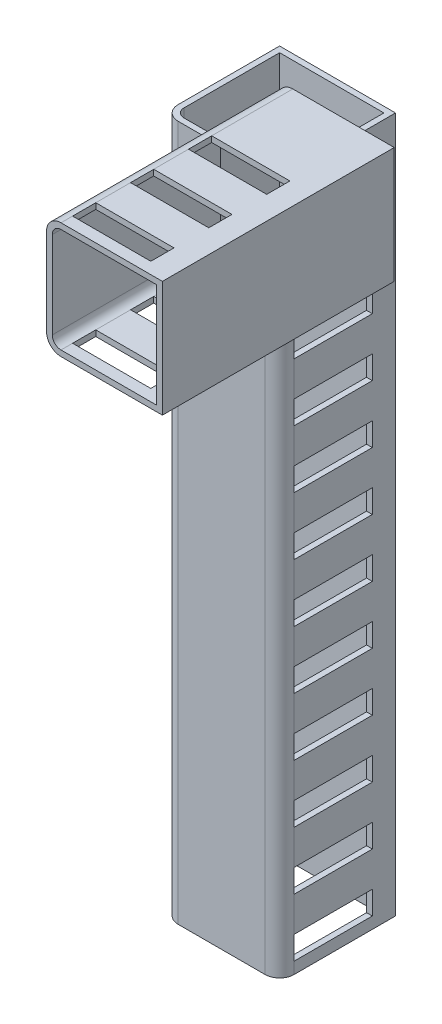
ISO-10303-21;
HEADER;
FILE_DESCRIPTION(('STEP AP214'),'2;1');
FILE_NAME('part.step','',(''),(''),'','','');
FILE_SCHEMA(('AUTOMOTIVE_DESIGN { 1 0 10303 214 1 1 1 1 }'));
ENDSEC;
DATA;
#1=APPLICATION_CONTEXT('core data for automotive mechanical design processes');
#2=APPLICATION_PROTOCOL_DEFINITION('international standard','automotive_design',2000,#1);
#3=PRODUCT_CONTEXT('',#1,'mechanical');
#4=PRODUCT('Part','Part','',(#3));
#5=PRODUCT_RELATED_PRODUCT_CATEGORY('part','',(#4));
#6=PRODUCT_DEFINITION_FORMATION('','',#4);
#7=PRODUCT_DEFINITION_CONTEXT('part definition',#1,'design');
#8=PRODUCT_DEFINITION('design','',#6,#7);
#9=PRODUCT_DEFINITION_SHAPE('','',#8);
#10=(LENGTH_UNIT() NAMED_UNIT(*) SI_UNIT(.MILLI.,.METRE.));
#11=(NAMED_UNIT(*) PLANE_ANGLE_UNIT() SI_UNIT($,.RADIAN.));
#12=(NAMED_UNIT(*) SI_UNIT($,.STERADIAN.) SOLID_ANGLE_UNIT());
#13=UNCERTAINTY_MEASURE_WITH_UNIT(LENGTH_MEASURE(1.E-05),#10,'distance_accuracy_value','');
#14=(GEOMETRIC_REPRESENTATION_CONTEXT(3) GLOBAL_UNCERTAINTY_ASSIGNED_CONTEXT((#13)) GLOBAL_UNIT_ASSIGNED_CONTEXT((#10,
#11,#12)) REPRESENTATION_CONTEXT('',''));
#15=CARTESIAN_POINT('',(0.,0.,0.));
#16=DIRECTION('',(0.,0.,1.));
#17=DIRECTION('',(1.,0.,0.));
#18=AXIS2_PLACEMENT_3D('',#15,#16,#17);
#19=CARTESIAN_POINT('',(-50.9085961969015,286.400733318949,121.969008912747));
#20=DIRECTION('',(0.,0.,-1.));
#21=DIRECTION('',(-1.,0.,0.));
#22=AXIS2_PLACEMENT_3D('',#19,#20,#21);
#23=PLANE('',#22);
#24=DIRECTION('',(0.,1.,0.));
#25=VECTOR('',#24,1.);
#26=CARTESIAN_POINT('',(-50.9085961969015,286.400733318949,121.969008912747));
#27=LINE('',#26,#25);
#28=CARTESIAN_POINT('',(-50.9085961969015,241.950733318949,121.969008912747));
#29=VERTEX_POINT('',#28);
#30=CARTESIAN_POINT('',(-50.9085961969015,280.050733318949,121.969008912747));
#31=VERTEX_POINT('',#30);
#32=EDGE_CURVE('E1655',#29,#31,#27,.T.);
#33=ORIENTED_EDGE('',*,*,#32,.F.);
#34=CARTESIAN_POINT('',(-44.5585961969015,241.950733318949,121.969008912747));
#35=DIRECTION('',(0.,0.,-1.));
#36=DIRECTION('',(-1.,0.,0.));
#37=AXIS2_PLACEMENT_3D('',#34,#35,#36);
#38=CIRCLE('',#37,6.35);
#39=CARTESIAN_POINT('',(-44.5585961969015,235.600733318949,121.969008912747));
#40=VERTEX_POINT('',#39);
#41=EDGE_CURVE('E1756',#29,#40,#38,.F.);
#42=ORIENTED_EDGE('',*,*,#41,.T.);
#43=DIRECTION('',(1.,0.,0.));
#44=VECTOR('',#43,1.);
#45=CARTESIAN_POINT('',(-50.9085961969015,235.600733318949,121.969008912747));
#46=LINE('',#45,#44);
#47=CARTESIAN_POINT('',(-0.108596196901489,235.600733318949,121.969008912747));
#48=VERTEX_POINT('',#47);
#49=EDGE_CURVE('E1662',#40,#48,#46,.T.);
#50=ORIENTED_EDGE('',*,*,#49,.T.);
#51=DIRECTION('',(0.,1.,0.));
#52=VECTOR('',#51,1.);
#53=CARTESIAN_POINT('',(-0.108596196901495,286.400733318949,121.969008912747));
#54=LINE('',#53,#52);
#55=CARTESIAN_POINT('',(-0.108596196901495,286.400733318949,121.969008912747));
#56=VERTEX_POINT('',#55);
#57=EDGE_CURVE('E1573',#48,#56,#54,.T.);
#58=ORIENTED_EDGE('',*,*,#57,.T.);
#59=DIRECTION('',(1.,0.,0.));
#60=VECTOR('',#59,1.);
#61=CARTESIAN_POINT('',(-50.9085961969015,286.400733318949,121.969008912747));
#62=LINE('',#61,#60);
#63=CARTESIAN_POINT('',(-44.5585961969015,286.400733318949,121.969008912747));
#64=VERTEX_POINT('',#63);
#65=EDGE_CURVE('E1678',#64,#56,#62,.T.);
#66=ORIENTED_EDGE('',*,*,#65,.F.);
#67=CARTESIAN_POINT('',(-44.5585961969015,280.050733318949,121.969008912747));
#68=DIRECTION('',(0.,0.,-1.));
#69=DIRECTION('',(-1.,0.,0.));
#70=AXIS2_PLACEMENT_3D('',#67,#68,#69);
#71=CIRCLE('',#70,6.35);
#72=EDGE_CURVE('E1754',#64,#31,#71,.F.);
#73=ORIENTED_EDGE('',*,*,#72,.T.);
#74=EDGE_LOOP('',(#33,#42,#50,#58,#66,#73));
#75=FACE_BOUND('',#74,.T.);
#76=CARTESIAN_POINT('',(-44.5585961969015,241.950733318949,121.969008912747));
#77=DIRECTION('',(0.,0.,-1.));
#78=DIRECTION('',(-1.,0.,0.));
#79=AXIS2_PLACEMENT_3D('',#76,#77,#78);
#80=CIRCLE('',#79,3.81);
#81=CARTESIAN_POINT('',(-48.3685961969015,241.950733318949,121.969008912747));
#82=VERTEX_POINT('',#81);
#83=CARTESIAN_POINT('',(-44.5585961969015,238.140733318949,121.969008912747));
#84=VERTEX_POINT('',#83);
#85=EDGE_CURVE('E1651',#82,#84,#80,.F.);
#86=ORIENTED_EDGE('',*,*,#85,.F.);
#87=DIRECTION('',(0.,1.,0.));
#88=VECTOR('',#87,1.);
#89=CARTESIAN_POINT('',(-48.3685961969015,0.,121.969008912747));
#90=LINE('',#89,#88);
#91=CARTESIAN_POINT('',(-48.3685961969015,280.050733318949,121.969008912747));
#92=VERTEX_POINT('',#91);
#93=EDGE_CURVE('E1588',#82,#92,#90,.T.);
#94=ORIENTED_EDGE('',*,*,#93,.T.);
#95=CARTESIAN_POINT('',(-44.5585961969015,280.050733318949,121.969008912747));
#96=DIRECTION('',(0.,0.,-1.));
#97=DIRECTION('',(-1.,0.,0.));
#98=AXIS2_PLACEMENT_3D('',#95,#96,#97);
#99=CIRCLE('',#98,3.81);
#100=CARTESIAN_POINT('',(-44.5585961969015,283.860733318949,121.969008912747));
#101=VERTEX_POINT('',#100);
#102=EDGE_CURVE('E1602',#101,#92,#99,.F.);
#103=ORIENTED_EDGE('',*,*,#102,.F.);
#104=DIRECTION('',(1.,0.,0.));
#105=VECTOR('',#104,1.);
#106=CARTESIAN_POINT('',(-50.9085961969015,283.860733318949,121.969008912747));
#107=LINE('',#106,#105);
#108=CARTESIAN_POINT('',(-2.64859619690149,283.860733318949,121.969008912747));
#109=VERTEX_POINT('',#108);
#110=EDGE_CURVE('E1628',#101,#109,#107,.T.);
#111=ORIENTED_EDGE('',*,*,#110,.T.);
#112=DIRECTION('',(0.,1.,0.));
#113=VECTOR('',#112,1.);
#114=CARTESIAN_POINT('',(-2.64859619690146,0.,121.969008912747));
#115=LINE('',#114,#113);
#116=CARTESIAN_POINT('',(-2.64859619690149,238.140733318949,121.969008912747));
#117=VERTEX_POINT('',#116);
#118=EDGE_CURVE('E1537',#117,#109,#115,.T.);
#119=ORIENTED_EDGE('',*,*,#118,.F.);
#120=DIRECTION('',(1.,0.,0.));
#121=VECTOR('',#120,1.);
#122=CARTESIAN_POINT('',(-50.9085961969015,238.140733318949,121.969008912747));
#123=LINE('',#122,#121);
#124=EDGE_CURVE('E1632',#84,#117,#123,.T.);
#125=ORIENTED_EDGE('',*,*,#124,.F.);
#126=EDGE_LOOP('',(#86,#94,#103,#111,#119,#125));
#127=FACE_BOUND('',#126,.T.);
#128=ADVANCED_FACE('F32',(#75,#127),#23,.F.);
#129=CARTESIAN_POINT('',(-19.9205961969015,279.43573630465,50.8));
#130=DIRECTION('',(-1.,0.,0.));
#131=DIRECTION('',(0.,-1.,0.));
#132=AXIS2_PLACEMENT_3D('',#129,#130,#131);
#133=PLANE('',#132);
#134=DIRECTION('',(0.,1.,0.));
#135=VECTOR('',#134,1.);
#136=CARTESIAN_POINT('',(-19.9205961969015,-25.3642636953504,44.45));
#137=LINE('',#136,#135);
#138=CARTESIAN_POINT('',(-19.9205961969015,30.5157363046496,44.45));
#139=VERTEX_POINT('',#138);
#140=CARTESIAN_POINT('',(-19.9205961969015,15.2757363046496,44.45));
#141=VERTEX_POINT('',#140);
#142=EDGE_CURVE('E3022',#139,#141,#137,.F.);
#143=ORIENTED_EDGE('',*,*,#142,.T.);
#144=DIRECTION('',(0.,0.,-1.));
#145=VECTOR('',#144,1.);
#146=CARTESIAN_POINT('',(-19.9205961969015,15.2757363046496,50.8));
#147=LINE('',#146,#145);
#148=CARTESIAN_POINT('',(-19.9205961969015,15.2757363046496,10.16));
#149=VERTEX_POINT('',#148);
#150=EDGE_CURVE('E1410',#141,#149,#147,.T.);
#151=ORIENTED_EDGE('',*,*,#150,.T.);
#152=DIRECTION('',(0.,-1.,0.));
#153=VECTOR('',#152,1.);
#154=CARTESIAN_POINT('',(-19.9205961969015,279.43573630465,10.16));
#155=LINE('',#154,#153);
#156=CARTESIAN_POINT('',(-19.9205961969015,5.11573630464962,10.16));
#157=VERTEX_POINT('',#156);
#158=EDGE_CURVE('E1482',#149,#157,#155,.T.);
#159=ORIENTED_EDGE('',*,*,#158,.T.);
#160=DIRECTION('',(0.,0.,1.));
#161=VECTOR('',#160,1.);
#162=CARTESIAN_POINT('',(-19.9205961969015,5.11573630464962,50.8));
#163=LINE('',#162,#161);
#164=CARTESIAN_POINT('',(-19.9205961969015,5.11573630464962,44.45));
#165=VERTEX_POINT('',#164);
#166=EDGE_CURVE('E1392',#157,#165,#163,.T.);
#167=ORIENTED_EDGE('',*,*,#166,.T.);
#168=CARTESIAN_POINT('',(-19.9205961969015,-10.1242636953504,44.45));
#169=VERTEX_POINT('',#168);
#170=EDGE_CURVE('E1737',#165,#169,#137,.F.);
#171=ORIENTED_EDGE('',*,*,#170,.T.);
#172=DIRECTION('',(0.,0.,-1.));
#173=VECTOR('',#172,1.);
#174=CARTESIAN_POINT('',(-19.9205961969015,-10.1242636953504,50.8));
#175=LINE('',#174,#173);
#176=CARTESIAN_POINT('',(-19.9205961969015,-10.1242636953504,10.16));
#177=VERTEX_POINT('',#176);
#178=EDGE_CURVE('E1526',#169,#177,#175,.T.);
#179=ORIENTED_EDGE('',*,*,#178,.T.);
#180=DIRECTION('',(0.,-1.,0.));
#181=VECTOR('',#180,1.);
#182=CARTESIAN_POINT('',(-19.9205961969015,279.43573630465,10.16));
#183=LINE('',#182,#181);
#184=CARTESIAN_POINT('',(-19.9205961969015,-20.2842636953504,10.16));
#185=VERTEX_POINT('',#184);
#186=EDGE_CURVE('E1534',#177,#185,#183,.T.);
#187=ORIENTED_EDGE('',*,*,#186,.T.);
#188=DIRECTION('',(0.,0.,1.));
#189=VECTOR('',#188,1.);
#190=CARTESIAN_POINT('',(-19.9205961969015,-20.2842636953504,50.8));
#191=LINE('',#190,#189);
#192=CARTESIAN_POINT('',(-19.9205961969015,-20.2842636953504,44.45));
#193=VERTEX_POINT('',#192);
#194=EDGE_CURVE('E1508',#185,#193,#191,.T.);
#195=ORIENTED_EDGE('',*,*,#194,.T.);
#196=CARTESIAN_POINT('',(-19.9205961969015,-25.3642636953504,44.45));
#197=VERTEX_POINT('',#196);
#198=EDGE_CURVE('E1731',#193,#197,#137,.F.);
#199=ORIENTED_EDGE('',*,*,#198,.T.);
#200=DIRECTION('',(0.,0.,-1.));
#201=VECTOR('',#200,1.);
#202=CARTESIAN_POINT('',(-19.9205961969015,-25.3642636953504,50.8));
#203=LINE('',#202,#201);
#204=CARTESIAN_POINT('',(-19.9205961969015,-25.3642636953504,0.));
#205=VERTEX_POINT('',#204);
#206=EDGE_CURVE('E1712',#197,#205,#203,.T.);
#207=ORIENTED_EDGE('',*,*,#206,.T.);
#208=DIRECTION('',(0.,1.,0.));
#209=VECTOR('',#208,1.);
#210=CARTESIAN_POINT('',(-19.9205961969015,279.43573630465,0.));
#211=LINE('',#210,#209);
#212=CARTESIAN_POINT('',(-19.9205961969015,279.43573630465,0.));
#213=VERTEX_POINT('',#212);
#214=EDGE_CURVE('E1704',#205,#213,#211,.T.);
#215=ORIENTED_EDGE('',*,*,#214,.T.);
#216=DIRECTION('',(0.,0.,-1.));
#217=VECTOR('',#216,1.);
#218=CARTESIAN_POINT('',(-19.9205961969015,279.43573630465,50.8));
#219=LINE('',#218,#217);
#220=CARTESIAN_POINT('',(-19.9205961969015,279.43573630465,20.3690089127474));
#221=VERTEX_POINT('',#220);
#222=EDGE_CURVE('E1710',#221,#213,#219,.T.);
#223=ORIENTED_EDGE('',*,*,#222,.F.);
#224=DIRECTION('',(0.,1.,0.));
#225=VECTOR('',#224,1.);
#226=CARTESIAN_POINT('',(-19.9205961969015,279.43573630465,20.3690089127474));
#227=LINE('',#226,#225);
#228=CARTESIAN_POINT('',(-19.9205961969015,238.140733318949,20.3690089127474));
#229=VERTEX_POINT('',#228);
#230=EDGE_CURVE('E1686',#229,#221,#227,.T.);
#231=ORIENTED_EDGE('',*,*,#230,.F.);
#232=CARTESIAN_POINT('',(-19.9205961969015,235.600733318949,20.3690089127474));
#233=VERTEX_POINT('',#232);
#234=EDGE_CURVE('E1687',#233,#229,#227,.T.);
#235=ORIENTED_EDGE('',*,*,#234,.F.);
#236=DIRECTION('',(0.,0.,-1.));
#237=VECTOR('',#236,1.);
#238=CARTESIAN_POINT('',(-19.9205961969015,235.600733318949,50.8));
#239=LINE('',#238,#237);
#240=CARTESIAN_POINT('',(-19.9205961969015,235.600733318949,44.45));
#241=VERTEX_POINT('',#240);
#242=EDGE_CURVE('E1684',#241,#233,#239,.T.);
#243=ORIENTED_EDGE('',*,*,#242,.F.);
#244=CARTESIAN_POINT('',(-19.9205961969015,218.47573630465,44.45));
#245=VERTEX_POINT('',#244);
#246=EDGE_CURVE('E1732',#241,#245,#137,.F.);
#247=ORIENTED_EDGE('',*,*,#246,.T.);
#248=DIRECTION('',(0.,0.,-1.));
#249=VECTOR('',#248,1.);
#250=CARTESIAN_POINT('',(-19.9205961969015,218.47573630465,50.8));
#251=LINE('',#250,#249);
#252=CARTESIAN_POINT('',(-19.9205961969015,218.47573630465,10.16));
#253=VERTEX_POINT('',#252);
#254=EDGE_CURVE('E1178',#245,#253,#251,.T.);
#255=ORIENTED_EDGE('',*,*,#254,.T.);
#256=DIRECTION('',(0.,-1.,0.));
#257=VECTOR('',#256,1.);
#258=CARTESIAN_POINT('',(-19.9205961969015,279.43573630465,10.16));
#259=LINE('',#258,#257);
#260=CARTESIAN_POINT('',(-19.9205961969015,208.31573630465,10.16));
#261=VERTEX_POINT('',#260);
#262=EDGE_CURVE('E1418',#253,#261,#259,.T.);
#263=ORIENTED_EDGE('',*,*,#262,.T.);
#264=DIRECTION('',(0.,0.,1.));
#265=VECTOR('',#264,1.);
#266=CARTESIAN_POINT('',(-19.9205961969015,208.31573630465,50.8));
#267=LINE('',#266,#265);
#268=CARTESIAN_POINT('',(-19.9205961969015,208.31573630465,44.45));
#269=VERTEX_POINT('',#268);
#270=EDGE_CURVE('E1160',#261,#269,#267,.T.);
#271=ORIENTED_EDGE('',*,*,#270,.T.);
#272=CARTESIAN_POINT('',(-19.9205961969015,193.07573630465,44.45));
#273=VERTEX_POINT('',#272);
#274=EDGE_CURVE('E1736',#269,#273,#137,.F.);
#275=ORIENTED_EDGE('',*,*,#274,.T.);
#276=DIRECTION('',(0.,0.,-1.));
#277=VECTOR('',#276,1.);
#278=CARTESIAN_POINT('',(-19.9205961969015,193.07573630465,50.8));
#279=LINE('',#278,#277);
#280=CARTESIAN_POINT('',(-19.9205961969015,193.07573630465,10.16));
#281=VERTEX_POINT('',#280);
#282=EDGE_CURVE('E1207',#273,#281,#279,.T.);
#283=ORIENTED_EDGE('',*,*,#282,.T.);
#284=DIRECTION('',(0.,-1.,0.));
#285=VECTOR('',#284,1.);
#286=CARTESIAN_POINT('',(-19.9205961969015,279.43573630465,10.16));
#287=LINE('',#286,#285);
#288=CARTESIAN_POINT('',(-19.9205961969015,182.91573630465,10.16));
#289=VERTEX_POINT('',#288);
#290=EDGE_CURVE('E1426',#281,#289,#287,.T.);
#291=ORIENTED_EDGE('',*,*,#290,.T.);
#292=DIRECTION('',(0.,0.,1.));
#293=VECTOR('',#292,1.);
#294=CARTESIAN_POINT('',(-19.9205961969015,182.91573630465,50.8));
#295=LINE('',#294,#293);
#296=CARTESIAN_POINT('',(-19.9205961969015,182.91573630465,44.45));
#297=VERTEX_POINT('',#296);
#298=EDGE_CURVE('E1189',#289,#297,#295,.T.);
#299=ORIENTED_EDGE('',*,*,#298,.T.);
#300=CARTESIAN_POINT('',(-19.9205961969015,167.67573630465,44.45));
#301=VERTEX_POINT('',#300);
#302=EDGE_CURVE('E3024',#297,#301,#137,.F.);
#303=ORIENTED_EDGE('',*,*,#302,.T.);
#304=DIRECTION('',(0.,0.,-1.));
#305=VECTOR('',#304,1.);
#306=CARTESIAN_POINT('',(-19.9205961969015,167.67573630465,50.8));
#307=LINE('',#306,#305);
#308=CARTESIAN_POINT('',(-19.9205961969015,167.67573630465,10.16));
#309=VERTEX_POINT('',#308);
#310=EDGE_CURVE('E1236',#301,#309,#307,.T.);
#311=ORIENTED_EDGE('',*,*,#310,.T.);
#312=DIRECTION('',(0.,-1.,0.));
#313=VECTOR('',#312,1.);
#314=CARTESIAN_POINT('',(-19.9205961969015,279.43573630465,10.16));
#315=LINE('',#314,#313);
#316=CARTESIAN_POINT('',(-19.9205961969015,157.51573630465,10.16));
#317=VERTEX_POINT('',#316);
#318=EDGE_CURVE('E1434',#309,#317,#315,.T.);
#319=ORIENTED_EDGE('',*,*,#318,.T.);
#320=DIRECTION('',(0.,0.,1.));
#321=VECTOR('',#320,1.);
#322=CARTESIAN_POINT('',(-19.9205961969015,157.51573630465,50.8));
#323=LINE('',#322,#321);
#324=CARTESIAN_POINT('',(-19.9205961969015,157.51573630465,44.45));
#325=VERTEX_POINT('',#324);
#326=EDGE_CURVE('E1218',#317,#325,#323,.T.);
#327=ORIENTED_EDGE('',*,*,#326,.T.);
#328=CARTESIAN_POINT('',(-19.9205961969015,142.27573630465,44.45));
#329=VERTEX_POINT('',#328);
#330=EDGE_CURVE('E3027',#325,#329,#137,.F.);
#331=ORIENTED_EDGE('',*,*,#330,.T.);
#332=DIRECTION('',(0.,0.,-1.));
#333=VECTOR('',#332,1.);
#334=CARTESIAN_POINT('',(-19.9205961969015,142.27573630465,50.8));
#335=LINE('',#334,#333);
#336=CARTESIAN_POINT('',(-19.9205961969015,142.27573630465,10.16));
#337=VERTEX_POINT('',#336);
#338=EDGE_CURVE('E1265',#329,#337,#335,.T.);
#339=ORIENTED_EDGE('',*,*,#338,.T.);
#340=DIRECTION('',(0.,-1.,0.));
#341=VECTOR('',#340,1.);
#342=CARTESIAN_POINT('',(-19.9205961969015,279.43573630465,10.16));
#343=LINE('',#342,#341);
#344=CARTESIAN_POINT('',(-19.9205961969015,132.11573630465,10.16));
#345=VERTEX_POINT('',#344);
#346=EDGE_CURVE('E1442',#337,#345,#343,.T.);
#347=ORIENTED_EDGE('',*,*,#346,.T.);
#348=DIRECTION('',(0.,0.,1.));
#349=VECTOR('',#348,1.);
#350=CARTESIAN_POINT('',(-19.9205961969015,132.11573630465,50.8));
#351=LINE('',#350,#349);
#352=CARTESIAN_POINT('',(-19.9205961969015,132.11573630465,44.45));
#353=VERTEX_POINT('',#352);
#354=EDGE_CURVE('E1247',#345,#353,#351,.T.);
#355=ORIENTED_EDGE('',*,*,#354,.T.);
#356=CARTESIAN_POINT('',(-19.9205961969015,116.87573630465,44.45));
#357=VERTEX_POINT('',#356);
#358=EDGE_CURVE('E3030',#353,#357,#137,.F.);
#359=ORIENTED_EDGE('',*,*,#358,.T.);
#360=DIRECTION('',(0.,0.,-1.));
#361=VECTOR('',#360,1.);
#362=CARTESIAN_POINT('',(-19.9205961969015,116.87573630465,50.8));
#363=LINE('',#362,#361);
#364=CARTESIAN_POINT('',(-19.9205961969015,116.87573630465,10.16));
#365=VERTEX_POINT('',#364);
#366=EDGE_CURVE('E1294',#357,#365,#363,.T.);
#367=ORIENTED_EDGE('',*,*,#366,.T.);
#368=DIRECTION('',(0.,-1.,0.));
#369=VECTOR('',#368,1.);
#370=CARTESIAN_POINT('',(-19.9205961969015,279.43573630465,10.16));
#371=LINE('',#370,#369);
#372=CARTESIAN_POINT('',(-19.9205961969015,106.71573630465,10.16));
#373=VERTEX_POINT('',#372);
#374=EDGE_CURVE('E1450',#365,#373,#371,.T.);
#375=ORIENTED_EDGE('',*,*,#374,.T.);
#376=DIRECTION('',(0.,0.,1.));
#377=VECTOR('',#376,1.);
#378=CARTESIAN_POINT('',(-19.9205961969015,106.71573630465,50.8));
#379=LINE('',#378,#377);
#380=CARTESIAN_POINT('',(-19.9205961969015,106.71573630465,44.45));
#381=VERTEX_POINT('',#380);
#382=EDGE_CURVE('E1276',#373,#381,#379,.T.);
#383=ORIENTED_EDGE('',*,*,#382,.T.);
#384=CARTESIAN_POINT('',(-19.9205961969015,91.4757363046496,44.45));
#385=VERTEX_POINT('',#384);
#386=EDGE_CURVE('E3033',#381,#385,#137,.F.);
#387=ORIENTED_EDGE('',*,*,#386,.T.);
#388=DIRECTION('',(0.,0.,-1.));
#389=VECTOR('',#388,1.);
#390=CARTESIAN_POINT('',(-19.9205961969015,91.4757363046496,50.8));
#391=LINE('',#390,#389);
#392=CARTESIAN_POINT('',(-19.9205961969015,91.4757363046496,10.16));
#393=VERTEX_POINT('',#392);
#394=EDGE_CURVE('E1323',#385,#393,#391,.T.);
#395=ORIENTED_EDGE('',*,*,#394,.T.);
#396=DIRECTION('',(0.,-1.,0.));
#397=VECTOR('',#396,1.);
#398=CARTESIAN_POINT('',(-19.9205961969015,279.43573630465,10.16));
#399=LINE('',#398,#397);
#400=CARTESIAN_POINT('',(-19.9205961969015,81.3157363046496,10.16));
#401=VERTEX_POINT('',#400);
#402=EDGE_CURVE('E1458',#393,#401,#399,.T.);
#403=ORIENTED_EDGE('',*,*,#402,.T.);
#404=DIRECTION('',(0.,0.,1.));
#405=VECTOR('',#404,1.);
#406=CARTESIAN_POINT('',(-19.9205961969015,81.3157363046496,50.8));
#407=LINE('',#406,#405);
#408=CARTESIAN_POINT('',(-19.9205961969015,81.3157363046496,44.45));
#409=VERTEX_POINT('',#408);
#410=EDGE_CURVE('E1305',#401,#409,#407,.T.);
#411=ORIENTED_EDGE('',*,*,#410,.T.);
#412=CARTESIAN_POINT('',(-19.9205961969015,66.0757363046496,44.45));
#413=VERTEX_POINT('',#412);
#414=EDGE_CURVE('E3036',#409,#413,#137,.F.);
#415=ORIENTED_EDGE('',*,*,#414,.T.);
#416=DIRECTION('',(0.,0.,-1.));
#417=VECTOR('',#416,1.);
#418=CARTESIAN_POINT('',(-19.9205961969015,66.0757363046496,50.8));
#419=LINE('',#418,#417);
#420=CARTESIAN_POINT('',(-19.9205961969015,66.0757363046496,10.16));
#421=VERTEX_POINT('',#420);
#422=EDGE_CURVE('E1352',#413,#421,#419,.T.);
#423=ORIENTED_EDGE('',*,*,#422,.T.);
#424=DIRECTION('',(0.,-1.,0.));
#425=VECTOR('',#424,1.);
#426=CARTESIAN_POINT('',(-19.9205961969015,279.43573630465,10.16));
#427=LINE('',#426,#425);
#428=CARTESIAN_POINT('',(-19.9205961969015,55.9157363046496,10.16));
#429=VERTEX_POINT('',#428);
#430=EDGE_CURVE('E1466',#421,#429,#427,.T.);
#431=ORIENTED_EDGE('',*,*,#430,.T.);
#432=DIRECTION('',(0.,0.,1.));
#433=VECTOR('',#432,1.);
#434=CARTESIAN_POINT('',(-19.9205961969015,55.9157363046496,50.8));
#435=LINE('',#434,#433);
#436=CARTESIAN_POINT('',(-19.9205961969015,55.9157363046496,44.45));
#437=VERTEX_POINT('',#436);
#438=EDGE_CURVE('E1334',#429,#437,#435,.T.);
#439=ORIENTED_EDGE('',*,*,#438,.T.);
#440=CARTESIAN_POINT('',(-19.9205961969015,40.6757363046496,44.45));
#441=VERTEX_POINT('',#440);
#442=EDGE_CURVE('E3039',#437,#441,#137,.F.);
#443=ORIENTED_EDGE('',*,*,#442,.T.);
#444=DIRECTION('',(0.,0.,-1.));
#445=VECTOR('',#444,1.);
#446=CARTESIAN_POINT('',(-19.9205961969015,40.6757363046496,50.8));
#447=LINE('',#446,#445);
#448=CARTESIAN_POINT('',(-19.9205961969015,40.6757363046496,10.16));
#449=VERTEX_POINT('',#448);
#450=EDGE_CURVE('E1381',#441,#449,#447,.T.);
#451=ORIENTED_EDGE('',*,*,#450,.T.);
#452=DIRECTION('',(0.,-1.,0.));
#453=VECTOR('',#452,1.);
#454=CARTESIAN_POINT('',(-19.9205961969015,279.43573630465,10.16));
#455=LINE('',#454,#453);
#456=CARTESIAN_POINT('',(-19.9205961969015,30.5157363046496,10.16));
#457=VERTEX_POINT('',#456);
#458=EDGE_CURVE('E1474',#449,#457,#455,.T.);
#459=ORIENTED_EDGE('',*,*,#458,.T.);
#460=DIRECTION('',(0.,0.,1.));
#461=VECTOR('',#460,1.);
#462=CARTESIAN_POINT('',(-19.9205961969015,30.5157363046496,50.8));
#463=LINE('',#462,#461);
#464=EDGE_CURVE('E1363',#457,#139,#463,.T.);
#465=ORIENTED_EDGE('',*,*,#464,.T.);
#466=EDGE_LOOP('',(#143,#151,#159,#167,#171,#179,#187,#195,#199,#207,#215,#223,#231,#235,#243,
#247,#255,#263,#271,#275,#283,#291,#299,#303,#311,#319,#327,#331,#339,#347,#355,#359,#367,#375,
#383,#387,#395,#403,#411,#415,#423,#431,#439,#443,#451,#459,#465));
#467=FACE_BOUND('',#466,.T.);
#468=ADVANCED_FACE('F1941',(#467),#133,.F.);
#469=CARTESIAN_POINT('',(-70.7205961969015,279.43573630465,50.8));
#470=DIRECTION('',(0.,-1.,0.));
#471=DIRECTION('',(0.,0.,-1.));
#472=AXIS2_PLACEMENT_3D('',#469,#470,#471);
#473=PLANE('',#472);
#474=DIRECTION('',(0.,0.,1.));
#475=VECTOR('',#474,1.);
#476=CARTESIAN_POINT('',(-50.9085961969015,279.43573630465,50.8));
#477=LINE('',#476,#475);
#478=CARTESIAN_POINT('',(-50.9085961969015,279.43573630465,48.26));
#479=VERTEX_POINT('',#478);
#480=CARTESIAN_POINT('',(-50.9085961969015,279.43573630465,50.8));
#481=VERTEX_POINT('',#480);
#482=EDGE_CURVE('E1680',#479,#481,#477,.T.);
#483=ORIENTED_EDGE('',*,*,#482,.F.);
#484=DIRECTION('',(-1.,0.,0.));
#485=VECTOR('',#484,1.);
#486=CARTESIAN_POINT('',(-70.7205961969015,279.43573630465,48.26));
#487=LINE('',#486,#485);
#488=CARTESIAN_POINT('',(-64.3705961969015,279.43573630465,48.26));
#489=VERTEX_POINT('',#488);
#490=EDGE_CURVE('E1625',#479,#489,#487,.T.);
#491=ORIENTED_EDGE('',*,*,#490,.T.);
#492=CARTESIAN_POINT('',(-64.3705961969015,279.43573630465,44.45));
#493=DIRECTION('',(0.,-1.,0.));
#494=DIRECTION('',(0.,0.,-1.));
#495=AXIS2_PLACEMENT_3D('',#492,#493,#494);
#496=CIRCLE('',#495,3.81);
#497=CARTESIAN_POINT('',(-68.1805961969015,279.43573630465,44.45));
#498=VERTEX_POINT('',#497);
#499=EDGE_CURVE('E1559',#498,#489,#496,.F.);
#500=ORIENTED_EDGE('',*,*,#499,.F.);
#501=DIRECTION('',(0.,0.,-1.));
#502=VECTOR('',#501,1.);
#503=CARTESIAN_POINT('',(-68.1805961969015,279.43573630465,50.8));
#504=LINE('',#503,#502);
#505=CARTESIAN_POINT('',(-68.1805961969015,279.43573630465,2.54));
#506=VERTEX_POINT('',#505);
#507=EDGE_CURVE('E1618',#498,#506,#504,.T.);
#508=ORIENTED_EDGE('',*,*,#507,.T.);
#509=DIRECTION('',(-1.,0.,0.));
#510=VECTOR('',#509,1.);
#511=CARTESIAN_POINT('',(-70.7205961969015,279.43573630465,2.54));
#512=LINE('',#511,#510);
#513=CARTESIAN_POINT('',(-22.4605961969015,279.43573630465,2.54));
#514=VERTEX_POINT('',#513);
#515=EDGE_CURVE('E1552',#514,#506,#512,.T.);
#516=ORIENTED_EDGE('',*,*,#515,.F.);
#517=DIRECTION('',(0.,0.,-1.));
#518=VECTOR('',#517,1.);
#519=CARTESIAN_POINT('',(-22.4605961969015,279.43573630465,50.8));
#520=LINE('',#519,#518);
#521=CARTESIAN_POINT('',(-22.4605961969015,279.43573630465,20.3690089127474));
#522=VERTEX_POINT('',#521);
#523=EDGE_CURVE('E1606',#522,#514,#520,.T.);
#524=ORIENTED_EDGE('',*,*,#523,.F.);
#525=DIRECTION('',(-1.,0.,0.));
#526=VECTOR('',#525,1.);
#527=CARTESIAN_POINT('',(-70.7205961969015,279.43573630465,20.3690089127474));
#528=LINE('',#527,#526);
#529=EDGE_CURVE('E1723',#221,#522,#528,.T.);
#530=ORIENTED_EDGE('',*,*,#529,.F.);
#531=ORIENTED_EDGE('',*,*,#222,.T.);
#532=DIRECTION('',(-1.,0.,0.));
#533=VECTOR('',#532,1.);
#534=CARTESIAN_POINT('',(-70.7205961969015,279.43573630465,0.));
#535=LINE('',#534,#533);
#536=CARTESIAN_POINT('',(-70.7205961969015,279.43573630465,0.));
#537=VERTEX_POINT('',#536);
#538=EDGE_CURVE('E1695',#213,#537,#535,.T.);
#539=ORIENTED_EDGE('',*,*,#538,.T.);
#540=DIRECTION('',(0.,0.,-1.));
#541=VECTOR('',#540,1.);
#542=CARTESIAN_POINT('',(-70.7205961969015,279.43573630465,50.8));
#543=LINE('',#542,#541);
#544=CARTESIAN_POINT('',(-70.7205961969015,279.43573630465,44.45));
#545=VERTEX_POINT('',#544);
#546=EDGE_CURVE('E1698',#545,#537,#543,.T.);
#547=ORIENTED_EDGE('',*,*,#546,.F.);
#548=CARTESIAN_POINT('',(-64.3705961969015,279.43573630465,44.45));
#549=DIRECTION('',(0.,-1.,0.));
#550=DIRECTION('',(0.,0.,-1.));
#551=AXIS2_PLACEMENT_3D('',#548,#549,#550);
#552=CIRCLE('',#551,6.35);
#553=CARTESIAN_POINT('',(-64.3705961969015,279.43573630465,50.8));
#554=VERTEX_POINT('',#553);
#555=EDGE_CURVE('E1745',#545,#554,#552,.F.);
#556=ORIENTED_EDGE('',*,*,#555,.T.);
#557=DIRECTION('',(-1.,0.,0.));
#558=VECTOR('',#557,1.);
#559=CARTESIAN_POINT('',(-70.7205961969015,279.43573630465,50.8));
#560=LINE('',#559,#558);
#561=EDGE_CURVE('E1694',#481,#554,#560,.T.);
#562=ORIENTED_EDGE('',*,*,#561,.F.);
#563=EDGE_LOOP('',(#483,#491,#500,#508,#516,#524,#530,#531,#539,#547,#556,#562));
#564=FACE_BOUND('',#563,.T.);
#565=ADVANCED_FACE('F1946',(#564),#473,.F.);
#566=CARTESIAN_POINT('',(0.,0.,50.8));
#567=DIRECTION('',(0.,0.,1.));
#568=DIRECTION('',(1.,0.,0.));
#569=AXIS2_PLACEMENT_3D('',#566,#567,#568);
#570=PLANE('',#569);
#571=DIRECTION('',(1.,0.,0.));
#572=VECTOR('',#571,1.);
#573=CARTESIAN_POINT('',(-70.7205961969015,-25.3642636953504,50.8));
#574=LINE('',#573,#572);
#575=CARTESIAN_POINT('',(-64.3705961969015,-25.3642636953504,50.8));
#576=VERTEX_POINT('',#575);
#577=CARTESIAN_POINT('',(-26.2705961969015,-25.3642636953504,50.8));
#578=VERTEX_POINT('',#577);
#579=EDGE_CURVE('E1691',#576,#578,#574,.T.);
#580=ORIENTED_EDGE('',*,*,#579,.T.);
#581=DIRECTION('',(0.,1.,0.));
#582=VECTOR('',#581,1.);
#583=CARTESIAN_POINT('',(-26.2705961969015,235.600733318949,50.8));
#584=LINE('',#583,#582);
#585=CARTESIAN_POINT('',(-26.2705961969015,235.600733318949,50.8));
#586=VERTEX_POINT('',#585);
#587=EDGE_CURVE('E1728',#578,#586,#584,.T.);
#588=ORIENTED_EDGE('',*,*,#587,.T.);
#589=DIRECTION('',(-1.,0.,0.));
#590=VECTOR('',#589,1.);
#591=CARTESIAN_POINT('',(0.,235.600733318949,50.8));
#592=LINE('',#591,#590);
#593=CARTESIAN_POINT('',(-44.5585961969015,235.600733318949,50.8));
#594=VERTEX_POINT('',#593);
#595=EDGE_CURVE('E1719',#586,#594,#592,.T.);
#596=ORIENTED_EDGE('',*,*,#595,.T.);
#597=CARTESIAN_POINT('',(-44.5585961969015,241.950733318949,50.8));
#598=DIRECTION('',(0.,0.,1.));
#599=DIRECTION('',(1.,0.,0.));
#600=AXIS2_PLACEMENT_3D('',#597,#598,#599);
#601=CIRCLE('',#600,6.35);
#602=CARTESIAN_POINT('',(-50.9085961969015,241.950733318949,50.8));
#603=VERTEX_POINT('',#602);
#604=EDGE_CURVE('E1772',#594,#603,#601,.F.);
#605=ORIENTED_EDGE('',*,*,#604,.T.);
#606=DIRECTION('',(0.,1.,0.));
#607=VECTOR('',#606,1.);
#608=CARTESIAN_POINT('',(-50.9085961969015,0.,50.8));
#609=LINE('',#608,#607);
#610=EDGE_CURVE('E1716',#603,#481,#609,.T.);
#611=ORIENTED_EDGE('',*,*,#610,.T.);
#612=ORIENTED_EDGE('',*,*,#561,.T.);
#613=DIRECTION('',(0.,-1.,0.));
#614=VECTOR('',#613,1.);
#615=CARTESIAN_POINT('',(-64.3705961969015,-25.3642636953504,50.8));
#616=LINE('',#615,#614);
#617=EDGE_CURVE('E1725',#554,#576,#616,.T.);
#618=ORIENTED_EDGE('',*,*,#617,.T.);
#619=EDGE_LOOP('',(#580,#588,#596,#605,#611,#612,#618));
#620=FACE_BOUND('',#619,.T.);
#621=ADVANCED_FACE('F1952',(#620),#570,.T.);
#622=CARTESIAN_POINT('',(-70.7205961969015,279.43573630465,50.8));
#623=DIRECTION('',(1.,0.,0.));
#624=DIRECTION('',(0.,1.,0.));
#625=AXIS2_PLACEMENT_3D('',#622,#623,#624);
#626=PLANE('',#625);
#627=DIRECTION('',(0.,1.,0.));
#628=VECTOR('',#627,1.);
#629=CARTESIAN_POINT('',(-70.7205961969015,279.43573630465,10.16));
#630=LINE('',#629,#628);
#631=CARTESIAN_POINT('',(-70.7205961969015,5.11573630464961,10.16));
#632=VERTEX_POINT('',#631);
#633=CARTESIAN_POINT('',(-70.7205961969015,15.2757363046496,10.16));
#634=VERTEX_POINT('',#633);
#635=EDGE_CURVE('E1479',#632,#634,#630,.T.);
#636=ORIENTED_EDGE('',*,*,#635,.T.);
#637=DIRECTION('',(0.,0.,1.));
#638=VECTOR('',#637,1.);
#639=CARTESIAN_POINT('',(-70.7205961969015,15.2757363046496,50.8));
#640=LINE('',#639,#638);
#641=CARTESIAN_POINT('',(-70.7205961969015,15.2757363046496,44.45));
#642=VERTEX_POINT('',#641);
#643=EDGE_CURVE('E1407',#634,#642,#640,.T.);
#644=ORIENTED_EDGE('',*,*,#643,.T.);
#645=DIRECTION('',(0.,-1.,0.));
#646=VECTOR('',#645,1.);
#647=CARTESIAN_POINT('',(-70.7205961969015,279.43573630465,44.45));
#648=LINE('',#647,#646);
#649=CARTESIAN_POINT('',(-70.7205961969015,30.5157363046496,44.45));
#650=VERTEX_POINT('',#649);
#651=EDGE_CURVE('E3263',#642,#650,#648,.F.);
#652=ORIENTED_EDGE('',*,*,#651,.T.);
#653=DIRECTION('',(0.,0.,-1.));
#654=VECTOR('',#653,1.);
#655=CARTESIAN_POINT('',(-70.7205961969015,30.5157363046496,50.8));
#656=LINE('',#655,#654);
#657=CARTESIAN_POINT('',(-70.7205961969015,30.5157363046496,10.16));
#658=VERTEX_POINT('',#657);
#659=EDGE_CURVE('E1360',#650,#658,#656,.T.);
#660=ORIENTED_EDGE('',*,*,#659,.T.);
#661=DIRECTION('',(0.,1.,0.));
#662=VECTOR('',#661,1.);
#663=CARTESIAN_POINT('',(-70.7205961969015,279.43573630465,10.16));
#664=LINE('',#663,#662);
#665=CARTESIAN_POINT('',(-70.7205961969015,40.6757363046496,10.16));
#666=VERTEX_POINT('',#665);
#667=EDGE_CURVE('E1471',#658,#666,#664,.T.);
#668=ORIENTED_EDGE('',*,*,#667,.T.);
#669=DIRECTION('',(0.,0.,1.));
#670=VECTOR('',#669,1.);
#671=CARTESIAN_POINT('',(-70.7205961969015,40.6757363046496,50.8));
#672=LINE('',#671,#670);
#673=CARTESIAN_POINT('',(-70.7205961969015,40.6757363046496,44.45));
#674=VERTEX_POINT('',#673);
#675=EDGE_CURVE('E1378',#666,#674,#672,.T.);
#676=ORIENTED_EDGE('',*,*,#675,.T.);
#677=CARTESIAN_POINT('',(-70.7205961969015,55.9157363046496,44.45));
#678=VERTEX_POINT('',#677);
#679=EDGE_CURVE('E3260',#674,#678,#648,.F.);
#680=ORIENTED_EDGE('',*,*,#679,.T.);
#681=DIRECTION('',(0.,0.,-1.));
#682=VECTOR('',#681,1.);
#683=CARTESIAN_POINT('',(-70.7205961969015,55.9157363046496,50.8));
#684=LINE('',#683,#682);
#685=CARTESIAN_POINT('',(-70.7205961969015,55.9157363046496,10.16));
#686=VERTEX_POINT('',#685);
#687=EDGE_CURVE('E1331',#678,#686,#684,.T.);
#688=ORIENTED_EDGE('',*,*,#687,.T.);
#689=DIRECTION('',(0.,1.,0.));
#690=VECTOR('',#689,1.);
#691=CARTESIAN_POINT('',(-70.7205961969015,279.43573630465,10.16));
#692=LINE('',#691,#690);
#693=CARTESIAN_POINT('',(-70.7205961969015,66.0757363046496,10.16));
#694=VERTEX_POINT('',#693);
#695=EDGE_CURVE('E1463',#686,#694,#692,.T.);
#696=ORIENTED_EDGE('',*,*,#695,.T.);
#697=DIRECTION('',(0.,0.,1.));
#698=VECTOR('',#697,1.);
#699=CARTESIAN_POINT('',(-70.7205961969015,66.0757363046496,50.8));
#700=LINE('',#699,#698);
#701=CARTESIAN_POINT('',(-70.7205961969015,66.0757363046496,44.45));
#702=VERTEX_POINT('',#701);
#703=EDGE_CURVE('E1349',#694,#702,#700,.T.);
#704=ORIENTED_EDGE('',*,*,#703,.T.);
#705=CARTESIAN_POINT('',(-70.7205961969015,81.3157363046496,44.45));
#706=VERTEX_POINT('',#705);
#707=EDGE_CURVE('E3257',#702,#706,#648,.F.);
#708=ORIENTED_EDGE('',*,*,#707,.T.);
#709=DIRECTION('',(0.,0.,-1.));
#710=VECTOR('',#709,1.);
#711=CARTESIAN_POINT('',(-70.7205961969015,81.3157363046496,50.8));
#712=LINE('',#711,#710);
#713=CARTESIAN_POINT('',(-70.7205961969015,81.3157363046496,10.16));
#714=VERTEX_POINT('',#713);
#715=EDGE_CURVE('E1302',#706,#714,#712,.T.);
#716=ORIENTED_EDGE('',*,*,#715,.T.);
#717=DIRECTION('',(0.,1.,0.));
#718=VECTOR('',#717,1.);
#719=CARTESIAN_POINT('',(-70.7205961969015,279.43573630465,10.16));
#720=LINE('',#719,#718);
#721=CARTESIAN_POINT('',(-70.7205961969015,91.4757363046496,10.16));
#722=VERTEX_POINT('',#721);
#723=EDGE_CURVE('E1455',#714,#722,#720,.T.);
#724=ORIENTED_EDGE('',*,*,#723,.T.);
#725=DIRECTION('',(0.,0.,1.));
#726=VECTOR('',#725,1.);
#727=CARTESIAN_POINT('',(-70.7205961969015,91.4757363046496,50.8));
#728=LINE('',#727,#726);
#729=CARTESIAN_POINT('',(-70.7205961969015,91.4757363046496,44.45));
#730=VERTEX_POINT('',#729);
#731=EDGE_CURVE('E1320',#722,#730,#728,.T.);
#732=ORIENTED_EDGE('',*,*,#731,.T.);
#733=CARTESIAN_POINT('',(-70.7205961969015,106.71573630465,44.45));
#734=VERTEX_POINT('',#733);
#735=EDGE_CURVE('E3254',#730,#734,#648,.F.);
#736=ORIENTED_EDGE('',*,*,#735,.T.);
#737=DIRECTION('',(0.,0.,-1.));
#738=VECTOR('',#737,1.);
#739=CARTESIAN_POINT('',(-70.7205961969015,106.71573630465,50.8));
#740=LINE('',#739,#738);
#741=CARTESIAN_POINT('',(-70.7205961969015,106.71573630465,10.16));
#742=VERTEX_POINT('',#741);
#743=EDGE_CURVE('E1273',#734,#742,#740,.T.);
#744=ORIENTED_EDGE('',*,*,#743,.T.);
#745=DIRECTION('',(0.,1.,0.));
#746=VECTOR('',#745,1.);
#747=CARTESIAN_POINT('',(-70.7205961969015,279.43573630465,10.16));
#748=LINE('',#747,#746);
#749=CARTESIAN_POINT('',(-70.7205961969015,116.87573630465,10.16));
#750=VERTEX_POINT('',#749);
#751=EDGE_CURVE('E1447',#742,#750,#748,.T.);
#752=ORIENTED_EDGE('',*,*,#751,.T.);
#753=DIRECTION('',(0.,0.,1.));
#754=VECTOR('',#753,1.);
#755=CARTESIAN_POINT('',(-70.7205961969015,116.87573630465,50.8));
#756=LINE('',#755,#754);
#757=CARTESIAN_POINT('',(-70.7205961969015,116.87573630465,44.45));
#758=VERTEX_POINT('',#757);
#759=EDGE_CURVE('E1291',#750,#758,#756,.T.);
#760=ORIENTED_EDGE('',*,*,#759,.T.);
#761=CARTESIAN_POINT('',(-70.7205961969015,132.11573630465,44.45));
#762=VERTEX_POINT('',#761);
#763=EDGE_CURVE('E3251',#758,#762,#648,.F.);
#764=ORIENTED_EDGE('',*,*,#763,.T.);
#765=DIRECTION('',(0.,0.,-1.));
#766=VECTOR('',#765,1.);
#767=CARTESIAN_POINT('',(-70.7205961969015,132.11573630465,50.8));
#768=LINE('',#767,#766);
#769=CARTESIAN_POINT('',(-70.7205961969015,132.11573630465,10.16));
#770=VERTEX_POINT('',#769);
#771=EDGE_CURVE('E1244',#762,#770,#768,.T.);
#772=ORIENTED_EDGE('',*,*,#771,.T.);
#773=DIRECTION('',(0.,1.,0.));
#774=VECTOR('',#773,1.);
#775=CARTESIAN_POINT('',(-70.7205961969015,279.43573630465,10.16));
#776=LINE('',#775,#774);
#777=CARTESIAN_POINT('',(-70.7205961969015,142.27573630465,10.16));
#778=VERTEX_POINT('',#777);
#779=EDGE_CURVE('E1439',#770,#778,#776,.T.);
#780=ORIENTED_EDGE('',*,*,#779,.T.);
#781=DIRECTION('',(0.,0.,1.));
#782=VECTOR('',#781,1.);
#783=CARTESIAN_POINT('',(-70.7205961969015,142.27573630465,50.8));
#784=LINE('',#783,#782);
#785=CARTESIAN_POINT('',(-70.7205961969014,142.27573630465,44.45));
#786=VERTEX_POINT('',#785);
#787=EDGE_CURVE('E1262',#778,#786,#784,.T.);
#788=ORIENTED_EDGE('',*,*,#787,.T.);
#789=CARTESIAN_POINT('',(-70.7205961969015,157.51573630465,44.45));
#790=VERTEX_POINT('',#789);
#791=EDGE_CURVE('E3248',#786,#790,#648,.F.);
#792=ORIENTED_EDGE('',*,*,#791,.T.);
#793=DIRECTION('',(0.,0.,-1.));
#794=VECTOR('',#793,1.);
#795=CARTESIAN_POINT('',(-70.7205961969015,157.51573630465,50.8));
#796=LINE('',#795,#794);
#797=CARTESIAN_POINT('',(-70.7205961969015,157.51573630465,10.16));
#798=VERTEX_POINT('',#797);
#799=EDGE_CURVE('E1215',#790,#798,#796,.T.);
#800=ORIENTED_EDGE('',*,*,#799,.T.);
#801=DIRECTION('',(0.,1.,0.));
#802=VECTOR('',#801,1.);
#803=CARTESIAN_POINT('',(-70.7205961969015,279.43573630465,10.16));
#804=LINE('',#803,#802);
#805=CARTESIAN_POINT('',(-70.7205961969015,167.67573630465,10.16));
#806=VERTEX_POINT('',#805);
#807=EDGE_CURVE('E1431',#798,#806,#804,.T.);
#808=ORIENTED_EDGE('',*,*,#807,.T.);
#809=DIRECTION('',(0.,0.,1.));
#810=VECTOR('',#809,1.);
#811=CARTESIAN_POINT('',(-70.7205961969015,167.67573630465,50.8));
#812=LINE('',#811,#810);
#813=CARTESIAN_POINT('',(-70.7205961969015,167.67573630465,44.45));
#814=VERTEX_POINT('',#813);
#815=EDGE_CURVE('E1233',#806,#814,#812,.T.);
#816=ORIENTED_EDGE('',*,*,#815,.T.);
#817=CARTESIAN_POINT('',(-70.7205961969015,182.91573630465,44.45));
#818=VERTEX_POINT('',#817);
#819=EDGE_CURVE('E3246',#814,#818,#648,.F.);
#820=ORIENTED_EDGE('',*,*,#819,.T.);
#821=DIRECTION('',(0.,0.,-1.));
#822=VECTOR('',#821,1.);
#823=CARTESIAN_POINT('',(-70.7205961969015,182.91573630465,50.8));
#824=LINE('',#823,#822);
#825=CARTESIAN_POINT('',(-70.7205961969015,182.91573630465,10.16));
#826=VERTEX_POINT('',#825);
#827=EDGE_CURVE('E1186',#818,#826,#824,.T.);
#828=ORIENTED_EDGE('',*,*,#827,.T.);
#829=DIRECTION('',(0.,1.,0.));
#830=VECTOR('',#829,1.);
#831=CARTESIAN_POINT('',(-70.7205961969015,279.43573630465,10.16));
#832=LINE('',#831,#830);
#833=CARTESIAN_POINT('',(-70.7205961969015,193.07573630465,10.16));
#834=VERTEX_POINT('',#833);
#835=EDGE_CURVE('E1423',#826,#834,#832,.T.);
#836=ORIENTED_EDGE('',*,*,#835,.T.);
#837=DIRECTION('',(0.,0.,1.));
#838=VECTOR('',#837,1.);
#839=CARTESIAN_POINT('',(-70.7205961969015,193.07573630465,50.8));
#840=LINE('',#839,#838);
#841=CARTESIAN_POINT('',(-70.7205961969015,193.07573630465,44.45));
#842=VERTEX_POINT('',#841);
#843=EDGE_CURVE('E1204',#834,#842,#840,.T.);
#844=ORIENTED_EDGE('',*,*,#843,.T.);
#845=CARTESIAN_POINT('',(-70.7205961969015,208.31573630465,44.45));
#846=VERTEX_POINT('',#845);
#847=EDGE_CURVE('E3240',#842,#846,#648,.F.);
#848=ORIENTED_EDGE('',*,*,#847,.T.);
#849=DIRECTION('',(0.,0.,-1.));
#850=VECTOR('',#849,1.);
#851=CARTESIAN_POINT('',(-70.7205961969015,208.31573630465,50.8));
#852=LINE('',#851,#850);
#853=CARTESIAN_POINT('',(-70.7205961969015,208.31573630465,10.16));
#854=VERTEX_POINT('',#853);
#855=EDGE_CURVE('E1157',#846,#854,#852,.T.);
#856=ORIENTED_EDGE('',*,*,#855,.T.);
#857=DIRECTION('',(0.,1.,0.));
#858=VECTOR('',#857,1.);
#859=CARTESIAN_POINT('',(-70.7205961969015,279.43573630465,10.16));
#860=LINE('',#859,#858);
#861=CARTESIAN_POINT('',(-70.7205961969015,218.47573630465,10.16));
#862=VERTEX_POINT('',#861);
#863=EDGE_CURVE('E1415',#854,#862,#860,.T.);
#864=ORIENTED_EDGE('',*,*,#863,.T.);
#865=DIRECTION('',(0.,0.,1.));
#866=VECTOR('',#865,1.);
#867=CARTESIAN_POINT('',(-70.7205961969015,218.47573630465,50.8));
#868=LINE('',#867,#866);
#869=CARTESIAN_POINT('',(-70.7205961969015,218.47573630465,44.45));
#870=VERTEX_POINT('',#869);
#871=EDGE_CURVE('E1175',#862,#870,#868,.T.);
#872=ORIENTED_EDGE('',*,*,#871,.T.);
#873=EDGE_CURVE('E1741',#870,#545,#648,.F.);
#874=ORIENTED_EDGE('',*,*,#873,.T.);
#875=ORIENTED_EDGE('',*,*,#546,.T.);
#876=DIRECTION('',(0.,-1.,0.));
#877=VECTOR('',#876,1.);
#878=CARTESIAN_POINT('',(-70.7205961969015,279.43573630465,0.));
#879=LINE('',#878,#877);
#880=CARTESIAN_POINT('',(-70.7205961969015,-25.3642636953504,0.));
#881=VERTEX_POINT('',#880);
#882=EDGE_CURVE('E1690',#537,#881,#879,.T.);
#883=ORIENTED_EDGE('',*,*,#882,.T.);
#884=DIRECTION('',(0.,0.,-1.));
#885=VECTOR('',#884,1.);
#886=CARTESIAN_POINT('',(-70.7205961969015,-25.3642636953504,50.8));
#887=LINE('',#886,#885);
#888=CARTESIAN_POINT('',(-70.7205961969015,-25.3642636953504,44.45));
#889=VERTEX_POINT('',#888);
#890=EDGE_CURVE('E1714',#889,#881,#887,.T.);
#891=ORIENTED_EDGE('',*,*,#890,.F.);
#892=CARTESIAN_POINT('',(-70.7205961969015,-20.2842636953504,44.45));
#893=VERTEX_POINT('',#892);
#894=EDGE_CURVE('E1742',#889,#893,#648,.F.);
#895=ORIENTED_EDGE('',*,*,#894,.T.);
#896=DIRECTION('',(0.,0.,-1.));
#897=VECTOR('',#896,1.);
#898=CARTESIAN_POINT('',(-70.7205961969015,-20.2842636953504,50.8));
#899=LINE('',#898,#897);
#900=CARTESIAN_POINT('',(-70.7205961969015,-20.2842636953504,10.16));
#901=VERTEX_POINT('',#900);
#902=EDGE_CURVE('E1505',#893,#901,#899,.T.);
#903=ORIENTED_EDGE('',*,*,#902,.T.);
#904=DIRECTION('',(0.,1.,0.));
#905=VECTOR('',#904,1.);
#906=CARTESIAN_POINT('',(-70.7205961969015,279.43573630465,10.16));
#907=LINE('',#906,#905);
#908=CARTESIAN_POINT('',(-70.7205961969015,-10.1242636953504,10.16));
#909=VERTEX_POINT('',#908);
#910=EDGE_CURVE('E1531',#901,#909,#907,.T.);
#911=ORIENTED_EDGE('',*,*,#910,.T.);
#912=DIRECTION('',(0.,0.,1.));
#913=VECTOR('',#912,1.);
#914=CARTESIAN_POINT('',(-70.7205961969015,-10.1242636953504,50.8));
#915=LINE('',#914,#913);
#916=CARTESIAN_POINT('',(-70.7205961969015,-10.1242636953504,44.45));
#917=VERTEX_POINT('',#916);
#918=EDGE_CURVE('E1523',#909,#917,#915,.T.);
#919=ORIENTED_EDGE('',*,*,#918,.T.);
#920=CARTESIAN_POINT('',(-70.7205961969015,5.11573630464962,44.45));
#921=VERTEX_POINT('',#920);
#922=EDGE_CURVE('E1746',#917,#921,#648,.F.);
#923=ORIENTED_EDGE('',*,*,#922,.T.);
#924=DIRECTION('',(0.,0.,-1.));
#925=VECTOR('',#924,1.);
#926=CARTESIAN_POINT('',(-70.7205961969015,5.11573630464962,50.8));
#927=LINE('',#926,#925);
#928=EDGE_CURVE('E1389',#921,#632,#927,.T.);
#929=ORIENTED_EDGE('',*,*,#928,.T.);
#930=EDGE_LOOP('',(#636,#644,#652,#660,#668,#676,#680,#688,#696,#704,#708,#716,#724,#732,#736,
#744,#752,#760,#764,#772,#780,#788,#792,#800,#808,#816,#820,#828,#836,#844,#848,#856,#864,#872,
#874,#875,#883,#891,#895,#903,#911,#919,#923,#929));
#931=FACE_BOUND('',#930,.T.);
#932=ADVANCED_FACE('F1955',(#931),#626,.F.);
#933=CARTESIAN_POINT('',(-70.7205961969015,-25.3642636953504,50.8));
#934=DIRECTION('',(0.,1.,0.));
#935=DIRECTION('',(0.,0.,1.));
#936=AXIS2_PLACEMENT_3D('',#933,#934,#935);
#937=PLANE('',#936);
#938=CARTESIAN_POINT('',(-26.2705961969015,-25.3642636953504,44.45));
#939=DIRECTION('',(0.,1.,0.));
#940=DIRECTION('',(0.,0.,1.));
#941=AXIS2_PLACEMENT_3D('',#938,#939,#940);
#942=CIRCLE('',#941,3.81);
#943=CARTESIAN_POINT('',(-22.4605961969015,-25.3642636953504,44.45));
#944=VERTEX_POINT('',#943);
#945=CARTESIAN_POINT('',(-26.2705961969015,-25.3642636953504,48.26));
#946=VERTEX_POINT('',#945);
#947=EDGE_CURVE('E1607',#944,#946,#942,.F.);
#948=ORIENTED_EDGE('',*,*,#947,.F.);
#949=DIRECTION('',(0.,0.,-1.));
#950=VECTOR('',#949,1.);
#951=CARTESIAN_POINT('',(-22.4605961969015,-25.3642636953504,50.8));
#952=LINE('',#951,#950);
#953=CARTESIAN_POINT('',(-22.4605961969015,-25.3642636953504,2.54));
#954=VERTEX_POINT('',#953);
#955=EDGE_CURVE('E1603',#944,#954,#952,.T.);
#956=ORIENTED_EDGE('',*,*,#955,.T.);
#957=DIRECTION('',(1.,0.,0.));
#958=VECTOR('',#957,1.);
#959=CARTESIAN_POINT('',(-70.7205961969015,-25.3642636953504,2.54));
#960=LINE('',#959,#958);
#961=CARTESIAN_POINT('',(-68.1805961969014,-25.3642636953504,2.54));
#962=VERTEX_POINT('',#961);
#963=EDGE_CURVE('E1553',#962,#954,#960,.T.);
#964=ORIENTED_EDGE('',*,*,#963,.F.);
#965=DIRECTION('',(0.,0.,-1.));
#966=VECTOR('',#965,1.);
#967=CARTESIAN_POINT('',(-68.1805961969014,-25.3642636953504,50.8));
#968=LINE('',#967,#966);
#969=CARTESIAN_POINT('',(-68.1805961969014,-25.3642636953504,44.45));
#970=VERTEX_POINT('',#969);
#971=EDGE_CURVE('E1576',#970,#962,#968,.T.);
#972=ORIENTED_EDGE('',*,*,#971,.F.);
#973=CARTESIAN_POINT('',(-64.3705961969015,-25.3642636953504,44.45));
#974=DIRECTION('',(0.,1.,0.));
#975=DIRECTION('',(0.,0.,1.));
#976=AXIS2_PLACEMENT_3D('',#973,#974,#975);
#977=CIRCLE('',#976,3.81);
#978=CARTESIAN_POINT('',(-64.3705961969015,-25.3642636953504,48.26));
#979=VERTEX_POINT('',#978);
#980=EDGE_CURVE('E1545',#979,#970,#977,.F.);
#981=ORIENTED_EDGE('',*,*,#980,.F.);
#982=DIRECTION('',(1.,0.,0.));
#983=VECTOR('',#982,1.);
#984=CARTESIAN_POINT('',(-70.7205961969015,-25.3642636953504,48.26));
#985=LINE('',#984,#983);
#986=EDGE_CURVE('E1609',#979,#946,#985,.T.);
#987=ORIENTED_EDGE('',*,*,#986,.T.);
#988=EDGE_LOOP('',(#948,#956,#964,#972,#981,#987));
#989=FACE_BOUND('',#988,.T.);
#990=ORIENTED_EDGE('',*,*,#206,.F.);
#991=CARTESIAN_POINT('',(-26.2705961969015,-25.3642636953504,44.45));
#992=DIRECTION('',(0.,1.,0.));
#993=DIRECTION('',(0.,0.,1.));
#994=AXIS2_PLACEMENT_3D('',#991,#992,#993);
#995=CIRCLE('',#994,6.35);
#996=EDGE_CURVE('E1739',#197,#578,#995,.F.);
#997=ORIENTED_EDGE('',*,*,#996,.T.);
#998=ORIENTED_EDGE('',*,*,#579,.F.);
#999=CARTESIAN_POINT('',(-64.3705961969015,-25.3642636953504,44.45));
#1000=DIRECTION('',(0.,1.,0.));
#1001=DIRECTION('',(0.,0.,1.));
#1002=AXIS2_PLACEMENT_3D('',#999,#1000,#1001);
#1003=CIRCLE('',#1002,6.35);
#1004=EDGE_CURVE('E1735',#576,#889,#1003,.F.);
#1005=ORIENTED_EDGE('',*,*,#1004,.T.);
#1006=ORIENTED_EDGE('',*,*,#890,.T.);
#1007=DIRECTION('',(1.,0.,0.));
#1008=VECTOR('',#1007,1.);
#1009=CARTESIAN_POINT('',(-70.7205961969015,-25.3642636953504,0.));
#1010=LINE('',#1009,#1008);
#1011=EDGE_CURVE('E1701',#881,#205,#1010,.T.);
#1012=ORIENTED_EDGE('',*,*,#1011,.T.);
#1013=EDGE_LOOP('',(#990,#997,#998,#1005,#1006,#1012));
#1014=FACE_BOUND('',#1013,.T.);
#1015=ADVANCED_FACE('F1960',(#989,#1014),#937,.F.);
#1016=CARTESIAN_POINT('',(0.,0.,0.));
#1017=DIRECTION('',(0.,0.,1.));
#1018=DIRECTION('',(1.,0.,0.));
#1019=AXIS2_PLACEMENT_3D('',#1016,#1017,#1018);
#1020=PLANE('',#1019);
#1021=ORIENTED_EDGE('',*,*,#882,.F.);
#1022=ORIENTED_EDGE('',*,*,#538,.F.);
#1023=ORIENTED_EDGE('',*,*,#214,.F.);
#1024=ORIENTED_EDGE('',*,*,#1011,.F.);
#1025=EDGE_LOOP('',(#1021,#1022,#1023,#1024));
#1026=FACE_BOUND('',#1025,.T.);
#1027=ADVANCED_FACE('F1957',(#1026),#1020,.F.);
#1028=CARTESIAN_POINT('',(-50.9085961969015,286.400733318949,20.3690089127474));
#1029=DIRECTION('',(0.,0.,1.));
#1030=DIRECTION('',(1.,0.,0.));
#1031=AXIS2_PLACEMENT_3D('',#1028,#1029,#1030);
#1032=PLANE('',#1031);
#1033=CARTESIAN_POINT('',(-44.5585961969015,280.050733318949,20.3690089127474));
#1034=DIRECTION('',(0.,0.,1.));
#1035=DIRECTION('',(1.,0.,0.));
#1036=AXIS2_PLACEMENT_3D('',#1033,#1034,#1035);
#1037=CIRCLE('',#1036,3.81);
#1038=CARTESIAN_POINT('',(-48.3685961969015,280.050733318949,20.3690089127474));
#1039=VERTEX_POINT('',#1038);
#1040=CARTESIAN_POINT('',(-44.5585961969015,283.860733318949,20.3690089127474));
#1041=VERTEX_POINT('',#1040);
#1042=EDGE_CURVE('E1580',#1039,#1041,#1037,.F.);
#1043=ORIENTED_EDGE('',*,*,#1042,.F.);
#1044=DIRECTION('',(0.,-1.,0.));
#1045=VECTOR('',#1044,1.);
#1046=CARTESIAN_POINT('',(-48.3685961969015,0.,20.3690089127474));
#1047=LINE('',#1046,#1045);
#1048=CARTESIAN_POINT('',(-48.3685961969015,279.43573630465,20.3690089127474));
#1049=VERTEX_POINT('',#1048);
#1050=EDGE_CURVE('E1629',#1039,#1049,#1047,.T.);
#1051=ORIENTED_EDGE('',*,*,#1050,.T.);
#1052=CARTESIAN_POINT('',(-50.9085961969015,279.43573630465,20.3690089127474));
#1053=VERTEX_POINT('',#1052);
#1054=EDGE_CURVE('E1722',#1049,#1053,#528,.T.);
#1055=ORIENTED_EDGE('',*,*,#1054,.T.);
#1056=DIRECTION('',(0.,-1.,0.));
#1057=VECTOR('',#1056,1.);
#1058=CARTESIAN_POINT('',(-50.9085961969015,286.400733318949,20.3690089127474));
#1059=LINE('',#1058,#1057);
#1060=CARTESIAN_POINT('',(-50.9085961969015,280.050733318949,20.3690089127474));
#1061=VERTEX_POINT('',#1060);
#1062=EDGE_CURVE('E1658',#1061,#1053,#1059,.T.);
#1063=ORIENTED_EDGE('',*,*,#1062,.F.);
#1064=CARTESIAN_POINT('',(-44.5585961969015,280.050733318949,20.3690089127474));
#1065=DIRECTION('',(0.,0.,1.));
#1066=DIRECTION('',(1.,0.,0.));
#1067=AXIS2_PLACEMENT_3D('',#1064,#1065,#1066);
#1068=CIRCLE('',#1067,6.35);
#1069=CARTESIAN_POINT('',(-44.5585961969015,286.400733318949,20.3690089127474));
#1070=VERTEX_POINT('',#1069);
#1071=EDGE_CURVE('E1762',#1061,#1070,#1068,.F.);
#1072=ORIENTED_EDGE('',*,*,#1071,.T.);
#1073=DIRECTION('',(1.,0.,0.));
#1074=VECTOR('',#1073,1.);
#1075=CARTESIAN_POINT('',(-50.9085961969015,286.400733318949,20.3690089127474));
#1076=LINE('',#1075,#1074);
#1077=CARTESIAN_POINT('',(-0.108596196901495,286.400733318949,20.3690089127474));
#1078=VERTEX_POINT('',#1077);
#1079=EDGE_CURVE('E1676',#1070,#1078,#1076,.T.);
#1080=ORIENTED_EDGE('',*,*,#1079,.T.);
#1081=DIRECTION('',(0.,-1.,0.));
#1082=VECTOR('',#1081,1.);
#1083=CARTESIAN_POINT('',(-0.108596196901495,286.400733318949,20.3690089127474));
#1084=LINE('',#1083,#1082);
#1085=CARTESIAN_POINT('',(-0.108596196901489,235.600733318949,20.3690089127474));
#1086=VERTEX_POINT('',#1085);
#1087=EDGE_CURVE('E1668',#1078,#1086,#1084,.T.);
#1088=ORIENTED_EDGE('',*,*,#1087,.T.);
#1089=DIRECTION('',(1.,0.,0.));
#1090=VECTOR('',#1089,1.);
#1091=CARTESIAN_POINT('',(-50.9085961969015,235.600733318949,20.3690089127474));
#1092=LINE('',#1091,#1090);
#1093=EDGE_CURVE('E1674',#233,#1086,#1092,.T.);
#1094=ORIENTED_EDGE('',*,*,#1093,.F.);
#1095=ORIENTED_EDGE('',*,*,#234,.T.);
#1096=DIRECTION('',(1.,0.,0.));
#1097=VECTOR('',#1096,1.);
#1098=CARTESIAN_POINT('',(-50.9085961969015,238.140733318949,20.3690089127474));
#1099=LINE('',#1098,#1097);
#1100=CARTESIAN_POINT('',(-2.64859619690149,238.140733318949,20.3690089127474));
#1101=VERTEX_POINT('',#1100);
#1102=EDGE_CURVE('E1642',#229,#1101,#1099,.T.);
#1103=ORIENTED_EDGE('',*,*,#1102,.T.);
#1104=DIRECTION('',(0.,-1.,0.));
#1105=VECTOR('',#1104,1.);
#1106=CARTESIAN_POINT('',(-2.64859619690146,0.,20.3690089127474));
#1107=LINE('',#1106,#1105);
#1108=CARTESIAN_POINT('',(-2.64859619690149,283.860733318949,20.3690089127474));
#1109=VERTEX_POINT('',#1108);
#1110=EDGE_CURVE('E1589',#1109,#1101,#1107,.T.);
#1111=ORIENTED_EDGE('',*,*,#1110,.F.);
#1112=DIRECTION('',(1.,0.,0.));
#1113=VECTOR('',#1112,1.);
#1114=CARTESIAN_POINT('',(-50.9085961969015,283.860733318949,20.3690089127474));
#1115=LINE('',#1114,#1113);
#1116=EDGE_CURVE('E1635',#1041,#1109,#1115,.T.);
#1117=ORIENTED_EDGE('',*,*,#1116,.F.);
#1118=EDGE_LOOP('',(#1043,#1051,#1055,#1063,#1072,#1080,#1088,#1094,#1095,#1103,#1111,#1117));
#1119=FACE_BOUND('',#1118,.T.);
#1120=ADVANCED_FACE('F1868',(#1119),#1032,.F.);
#1121=CARTESIAN_POINT('',(-50.9085961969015,235.600733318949,121.969008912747));
#1122=DIRECTION('',(0.,1.,0.));
#1123=DIRECTION('',(0.,0.,1.));
#1124=AXIS2_PLACEMENT_3D('',#1121,#1122,#1123);
#1125=PLANE('',#1124);
#1126=DIRECTION('',(0.,0.,1.));
#1127=VECTOR('',#1126,1.);
#1128=CARTESIAN_POINT('',(-44.5585961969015,235.600733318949,121.969008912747));
#1129=LINE('',#1128,#1127);
#1130=CARTESIAN_POINT('',(-44.5585961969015,235.600733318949,106.729008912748));
#1131=VERTEX_POINT('',#1130);
#1132=CARTESIAN_POINT('',(-44.5585961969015,235.600733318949,91.4890089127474));
#1133=VERTEX_POINT('',#1132);
#1134=EDGE_CURVE('E1763',#1131,#1133,#1129,.F.);
#1135=ORIENTED_EDGE('',*,*,#1134,.T.);
#1136=DIRECTION('',(-1.,0.,0.));
#1137=VECTOR('',#1136,1.);
#1138=CARTESIAN_POINT('',(-44.5585961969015,235.600733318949,91.4890089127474));
#1139=LINE('',#1138,#1137);
#1140=CARTESIAN_POINT('',(-10.2685961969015,235.600733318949,91.4890089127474));
#1141=VERTEX_POINT('',#1140);
#1142=EDGE_CURVE('E55',#1141,#1133,#1139,.T.);
#1143=ORIENTED_EDGE('',*,*,#1142,.F.);
#1144=DIRECTION('',(0.,0.,1.));
#1145=VECTOR('',#1144,1.);
#1146=CARTESIAN_POINT('',(-10.2685961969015,235.600733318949,81.3290089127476));
#1147=LINE('',#1146,#1145);
#1148=CARTESIAN_POINT('',(-10.2685961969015,235.600733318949,81.3290089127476));
#1149=VERTEX_POINT('',#1148);
#1150=EDGE_CURVE('E890',#1149,#1141,#1147,.T.);
#1151=ORIENTED_EDGE('',*,*,#1150,.F.);
#1152=DIRECTION('',(1.,0.,0.));
#1153=VECTOR('',#1152,1.);
#1154=CARTESIAN_POINT('',(-44.5585961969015,235.600733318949,81.3290089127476));
#1155=LINE('',#1154,#1153);
#1156=CARTESIAN_POINT('',(-44.5585961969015,235.600733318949,81.3290089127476));
#1157=VERTEX_POINT('',#1156);
#1158=EDGE_CURVE('E886',#1157,#1149,#1155,.T.);
#1159=ORIENTED_EDGE('',*,*,#1158,.F.);
#1160=CARTESIAN_POINT('',(-44.5585961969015,235.600733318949,66.0890089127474));
#1161=VERTEX_POINT('',#1160);
#1162=EDGE_CURVE('E2965',#1157,#1161,#1129,.F.);
#1163=ORIENTED_EDGE('',*,*,#1162,.T.);
#1164=DIRECTION('',(-1.,0.,0.));
#1165=VECTOR('',#1164,1.);
#1166=CARTESIAN_POINT('',(-44.5585961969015,235.600733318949,66.0890089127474));
#1167=LINE('',#1166,#1165);
#1168=CARTESIAN_POINT('',(-10.2685961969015,235.600733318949,66.0890089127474));
#1169=VERTEX_POINT('',#1168);
#1170=EDGE_CURVE('E47',#1169,#1161,#1167,.T.);
#1171=ORIENTED_EDGE('',*,*,#1170,.F.);
#1172=DIRECTION('',(0.,0.,1.));
#1173=VECTOR('',#1172,1.);
#1174=CARTESIAN_POINT('',(-10.2685961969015,235.600733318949,55.9290089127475));
#1175=LINE('',#1174,#1173);
#1176=CARTESIAN_POINT('',(-10.2685961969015,235.600733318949,55.9290089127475));
#1177=VERTEX_POINT('',#1176);
#1178=EDGE_CURVE('E919',#1177,#1169,#1175,.T.);
#1179=ORIENTED_EDGE('',*,*,#1178,.F.);
#1180=DIRECTION('',(1.,0.,0.));
#1181=VECTOR('',#1180,1.);
#1182=CARTESIAN_POINT('',(-44.5585961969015,235.600733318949,55.9290089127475));
#1183=LINE('',#1182,#1181);
#1184=CARTESIAN_POINT('',(-44.5585961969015,235.600733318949,55.9290089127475));
#1185=VERTEX_POINT('',#1184);
#1186=EDGE_CURVE('E916',#1185,#1177,#1183,.T.);
#1187=ORIENTED_EDGE('',*,*,#1186,.F.);
#1188=EDGE_CURVE('E1758',#1185,#594,#1129,.F.);
#1189=ORIENTED_EDGE('',*,*,#1188,.T.);
#1190=ORIENTED_EDGE('',*,*,#595,.F.);
#1191=CARTESIAN_POINT('',(-26.2705961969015,235.600733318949,44.45));
#1192=DIRECTION('',(0.,1.,0.));
#1193=DIRECTION('',(0.,0.,1.));
#1194=AXIS2_PLACEMENT_3D('',#1191,#1192,#1193);
#1195=CIRCLE('',#1194,6.35);
#1196=EDGE_CURVE('E1769',#586,#241,#1195,.T.);
#1197=ORIENTED_EDGE('',*,*,#1196,.T.);
#1198=ORIENTED_EDGE('',*,*,#242,.T.);
#1199=ORIENTED_EDGE('',*,*,#1093,.T.);
#1200=DIRECTION('',(0.,0.,1.));
#1201=VECTOR('',#1200,1.);
#1202=CARTESIAN_POINT('',(-0.108596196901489,235.600733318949,121.969008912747));
#1203=LINE('',#1202,#1201);
#1204=EDGE_CURVE('E1659',#1086,#48,#1203,.T.);
#1205=ORIENTED_EDGE('',*,*,#1204,.T.);
#1206=ORIENTED_EDGE('',*,*,#49,.F.);
#1207=CARTESIAN_POINT('',(-44.5585961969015,235.600733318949,116.889008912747));
#1208=VERTEX_POINT('',#1207);
#1209=EDGE_CURVE('E1759',#40,#1208,#1129,.F.);
#1210=ORIENTED_EDGE('',*,*,#1209,.T.);
#1211=DIRECTION('',(-1.,0.,0.));
#1212=VECTOR('',#1211,1.);
#1213=CARTESIAN_POINT('',(-44.5585961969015,235.600733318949,116.889008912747));
#1214=LINE('',#1213,#1212);
#1215=CARTESIAN_POINT('',(-10.2685961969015,235.600733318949,116.889008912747));
#1216=VERTEX_POINT('',#1215);
#1217=EDGE_CURVE('E969',#1216,#1208,#1214,.T.);
#1218=ORIENTED_EDGE('',*,*,#1217,.F.);
#1219=DIRECTION('',(0.,0.,1.));
#1220=VECTOR('',#1219,1.);
#1221=CARTESIAN_POINT('',(-10.2685961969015,235.600733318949,106.729008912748));
#1222=LINE('',#1221,#1220);
#1223=CARTESIAN_POINT('',(-10.2685961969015,235.600733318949,106.729008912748));
#1224=VERTEX_POINT('',#1223);
#1225=EDGE_CURVE('E984',#1224,#1216,#1222,.T.);
#1226=ORIENTED_EDGE('',*,*,#1225,.F.);
#1227=DIRECTION('',(1.,0.,0.));
#1228=VECTOR('',#1227,1.);
#1229=CARTESIAN_POINT('',(-44.5585961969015,235.600733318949,106.729008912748));
#1230=LINE('',#1229,#1228);
#1231=EDGE_CURVE('E981',#1131,#1224,#1230,.T.);
#1232=ORIENTED_EDGE('',*,*,#1231,.F.);
#1233=EDGE_LOOP('',(#1135,#1143,#1151,#1159,#1163,#1171,#1179,#1187,#1189,#1190,#1197,#1198,
#1199,#1205,#1206,#1210,#1218,#1226,#1232));
#1234=FACE_BOUND('',#1233,.T.);
#1235=ADVANCED_FACE('F1893',(#1234),#1125,.F.);
#1236=CARTESIAN_POINT('',(-50.9085961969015,0.,0.));
#1237=DIRECTION('',(1.,0.,0.));
#1238=DIRECTION('',(0.,1.,0.));
#1239=AXIS2_PLACEMENT_3D('',#1236,#1237,#1238);
#1240=PLANE('',#1239);
#1241=ORIENTED_EDGE('',*,*,#610,.F.);
#1242=DIRECTION('',(0.,0.,1.));
#1243=VECTOR('',#1242,1.);
#1244=CARTESIAN_POINT('',(-50.9085961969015,241.950733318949,0.));
#1245=LINE('',#1244,#1243);
#1246=EDGE_CURVE('E1751',#603,#29,#1245,.T.);
#1247=ORIENTED_EDGE('',*,*,#1246,.T.);
#1248=ORIENTED_EDGE('',*,*,#32,.T.);
#1249=DIRECTION('',(0.,0.,-1.));
#1250=VECTOR('',#1249,1.);
#1251=CARTESIAN_POINT('',(-50.9085961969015,280.050733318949,1.53011206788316E-13));
#1252=LINE('',#1251,#1250);
#1253=EDGE_CURVE('E1748',#31,#1061,#1252,.T.);
#1254=ORIENTED_EDGE('',*,*,#1253,.T.);
#1255=ORIENTED_EDGE('',*,*,#1062,.T.);
#1256=EDGE_CURVE('E1681',#1053,#479,#477,.T.);
#1257=ORIENTED_EDGE('',*,*,#1256,.T.);
#1258=ORIENTED_EDGE('',*,*,#482,.T.);
#1259=EDGE_LOOP('',(#1241,#1247,#1248,#1254,#1255,#1257,#1258));
#1260=FACE_BOUND('',#1259,.T.);
#1261=ADVANCED_FACE('F1887',(#1260),#1240,.F.);
#1262=CARTESIAN_POINT('',(-50.9085961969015,286.400733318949,121.969008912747));
#1263=DIRECTION('',(0.,-1.,0.));
#1264=DIRECTION('',(0.,0.,-1.));
#1265=AXIS2_PLACEMENT_3D('',#1262,#1263,#1264);
#1266=PLANE('',#1265);
#1267=DIRECTION('',(0.,0.,1.));
#1268=VECTOR('',#1267,1.);
#1269=CARTESIAN_POINT('',(-10.2685961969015,286.400733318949,81.3290089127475));
#1270=LINE('',#1269,#1268);
#1271=CARTESIAN_POINT('',(-10.2685961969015,286.400733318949,81.3290089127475));
#1272=VERTEX_POINT('',#1271);
#1273=CARTESIAN_POINT('',(-10.2685961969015,286.400733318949,91.4890089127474));
#1274=VERTEX_POINT('',#1273);
#1275=EDGE_CURVE('E862',#1272,#1274,#1270,.T.);
#1276=ORIENTED_EDGE('',*,*,#1275,.T.);
#1277=DIRECTION('',(-1.,0.,0.));
#1278=VECTOR('',#1277,1.);
#1279=CARTESIAN_POINT('',(-44.5585961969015,286.400733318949,91.4890089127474));
#1280=LINE('',#1279,#1278);
#1281=CARTESIAN_POINT('',(-44.5585961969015,286.400733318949,91.4890089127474));
#1282=VERTEX_POINT('',#1281);
#1283=EDGE_CURVE('E869',#1274,#1282,#1280,.T.);
#1284=ORIENTED_EDGE('',*,*,#1283,.T.);
#1285=DIRECTION('',(0.,0.,-1.));
#1286=VECTOR('',#1285,1.);
#1287=CARTESIAN_POINT('',(-44.5585961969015,286.400733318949,121.969008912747));
#1288=LINE('',#1287,#1286);
#1289=CARTESIAN_POINT('',(-44.5585961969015,286.400733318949,106.729008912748));
#1290=VERTEX_POINT('',#1289);
#1291=EDGE_CURVE('E1770',#1282,#1290,#1288,.F.);
#1292=ORIENTED_EDGE('',*,*,#1291,.T.);
#1293=DIRECTION('',(1.,0.,0.));
#1294=VECTOR('',#1293,1.);
#1295=CARTESIAN_POINT('',(-44.5585961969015,286.400733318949,106.729008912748));
#1296=LINE('',#1295,#1294);
#1297=CARTESIAN_POINT('',(-10.2685961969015,286.400733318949,106.729008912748));
#1298=VERTEX_POINT('',#1297);
#1299=EDGE_CURVE('E968',#1290,#1298,#1296,.T.);
#1300=ORIENTED_EDGE('',*,*,#1299,.T.);
#1301=DIRECTION('',(0.,0.,1.));
#1302=VECTOR('',#1301,1.);
#1303=CARTESIAN_POINT('',(-10.2685961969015,286.400733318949,106.729008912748));
#1304=LINE('',#1303,#1302);
#1305=CARTESIAN_POINT('',(-10.2685961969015,286.400733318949,116.889008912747));
#1306=VERTEX_POINT('',#1305);
#1307=EDGE_CURVE('E972',#1298,#1306,#1304,.T.);
#1308=ORIENTED_EDGE('',*,*,#1307,.T.);
#1309=DIRECTION('',(-1.,0.,0.));
#1310=VECTOR('',#1309,1.);
#1311=CARTESIAN_POINT('',(-44.5585961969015,286.400733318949,116.889008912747));
#1312=LINE('',#1311,#1310);
#1313=CARTESIAN_POINT('',(-44.5585961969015,286.400733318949,116.889008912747));
#1314=VERTEX_POINT('',#1313);
#1315=EDGE_CURVE('E975',#1306,#1314,#1312,.T.);
#1316=ORIENTED_EDGE('',*,*,#1315,.T.);
#1317=EDGE_CURVE('E1765',#1314,#64,#1288,.F.);
#1318=ORIENTED_EDGE('',*,*,#1317,.T.);
#1319=ORIENTED_EDGE('',*,*,#65,.T.);
#1320=DIRECTION('',(0.,0.,-1.));
#1321=VECTOR('',#1320,1.);
#1322=CARTESIAN_POINT('',(-0.108596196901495,286.400733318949,121.969008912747));
#1323=LINE('',#1322,#1321);
#1324=EDGE_CURVE('E1665',#56,#1078,#1323,.T.);
#1325=ORIENTED_EDGE('',*,*,#1324,.T.);
#1326=ORIENTED_EDGE('',*,*,#1079,.F.);
#1327=CARTESIAN_POINT('',(-44.5585961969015,286.400733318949,55.9290089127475));
#1328=VERTEX_POINT('',#1327);
#1329=EDGE_CURVE('E1766',#1070,#1328,#1288,.F.);
#1330=ORIENTED_EDGE('',*,*,#1329,.T.);
#1331=DIRECTION('',(1.,0.,0.));
#1332=VECTOR('',#1331,1.);
#1333=CARTESIAN_POINT('',(-44.5585961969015,286.400733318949,55.9290089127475));
#1334=LINE('',#1333,#1332);
#1335=CARTESIAN_POINT('',(-10.2685961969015,286.400733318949,55.9290089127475));
#1336=VERTEX_POINT('',#1335);
#1337=EDGE_CURVE('E904',#1328,#1336,#1334,.T.);
#1338=ORIENTED_EDGE('',*,*,#1337,.T.);
#1339=DIRECTION('',(0.,0.,1.));
#1340=VECTOR('',#1339,1.);
#1341=CARTESIAN_POINT('',(-10.2685961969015,286.400733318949,55.9290089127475));
#1342=LINE('',#1341,#1340);
#1343=CARTESIAN_POINT('',(-10.2685961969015,286.400733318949,66.0890089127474));
#1344=VERTEX_POINT('',#1343);
#1345=EDGE_CURVE('E907',#1336,#1344,#1342,.T.);
#1346=ORIENTED_EDGE('',*,*,#1345,.T.);
#1347=DIRECTION('',(-1.,0.,0.));
#1348=VECTOR('',#1347,1.);
#1349=CARTESIAN_POINT('',(-44.5585961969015,286.400733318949,66.0890089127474));
#1350=LINE('',#1349,#1348);
#1351=CARTESIAN_POINT('',(-44.5585961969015,286.400733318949,66.0890089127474));
#1352=VERTEX_POINT('',#1351);
#1353=EDGE_CURVE('E910',#1344,#1352,#1350,.T.);
#1354=ORIENTED_EDGE('',*,*,#1353,.T.);
#1355=CARTESIAN_POINT('',(-44.5585961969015,286.400733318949,81.3290089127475));
#1356=VERTEX_POINT('',#1355);
#1357=EDGE_CURVE('E875',#1352,#1356,#1288,.F.);
#1358=ORIENTED_EDGE('',*,*,#1357,.T.);
#1359=DIRECTION('',(1.,0.,0.));
#1360=VECTOR('',#1359,1.);
#1361=CARTESIAN_POINT('',(-44.5585961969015,286.400733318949,81.3290089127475));
#1362=LINE('',#1361,#1360);
#1363=EDGE_CURVE('E852',#1356,#1272,#1362,.T.);
#1364=ORIENTED_EDGE('',*,*,#1363,.T.);
#1365=EDGE_LOOP('',(#1276,#1284,#1292,#1300,#1308,#1316,#1318,#1319,#1325,#1326,#1330,#1338,
#1346,#1354,#1358,#1364));
#1366=FACE_BOUND('',#1365,.T.);
#1367=ADVANCED_FACE('F872',(#1366),#1266,.F.);
#1368=CARTESIAN_POINT('',(-0.108596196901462,0.,0.));
#1369=DIRECTION('',(1.,0.,0.));
#1370=DIRECTION('',(0.,1.,0.));
#1371=AXIS2_PLACEMENT_3D('',#1368,#1369,#1370);
#1372=PLANE('',#1371);
#1373=ORIENTED_EDGE('',*,*,#57,.F.);
#1374=ORIENTED_EDGE('',*,*,#1204,.F.);
#1375=ORIENTED_EDGE('',*,*,#1087,.F.);
#1376=ORIENTED_EDGE('',*,*,#1324,.F.);
#1377=EDGE_LOOP('',(#1373,#1374,#1375,#1376));
#1378=FACE_BOUND('',#1377,.T.);
#1379=ADVANCED_FACE('F1856',(#1378),#1372,.T.);
#1380=CARTESIAN_POINT('',(-26.2705961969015,0.,44.45));
#1381=DIRECTION('',(0.,-1.,0.));
#1382=DIRECTION('',(1.,0.,0.));
#1383=AXIS2_PLACEMENT_3D('',#1380,#1381,#1382);
#1384=CYLINDRICAL_SURFACE('',#1383,6.35);
#1385=ORIENTED_EDGE('',*,*,#996,.F.);
#1386=ORIENTED_EDGE('',*,*,#198,.F.);
#1387=DIRECTION('',(0.,-1.,0.));
#1388=VECTOR('',#1387,1.);
#1389=CARTESIAN_POINT('',(-19.9205961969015,0.,44.45));
#1390=LINE('',#1389,#1388);
#1391=EDGE_CURVE('E1516',#169,#193,#1390,.T.);
#1392=ORIENTED_EDGE('',*,*,#1391,.F.);
#1393=ORIENTED_EDGE('',*,*,#170,.F.);
#1394=DIRECTION('',(0.,-1.,0.));
#1395=VECTOR('',#1394,1.);
#1396=CARTESIAN_POINT('',(-19.9205961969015,0.,44.45));
#1397=LINE('',#1396,#1395);
#1398=EDGE_CURVE('E1400',#141,#165,#1397,.T.);
#1399=ORIENTED_EDGE('',*,*,#1398,.F.);
#1400=ORIENTED_EDGE('',*,*,#142,.F.);
#1401=DIRECTION('',(0.,-1.,0.));
#1402=VECTOR('',#1401,1.);
#1403=CARTESIAN_POINT('',(-19.9205961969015,0.,44.45));
#1404=LINE('',#1403,#1402);
#1405=EDGE_CURVE('E1371',#441,#139,#1404,.T.);
#1406=ORIENTED_EDGE('',*,*,#1405,.F.);
#1407=ORIENTED_EDGE('',*,*,#442,.F.);
#1408=DIRECTION('',(0.,-1.,0.));
#1409=VECTOR('',#1408,1.);
#1410=CARTESIAN_POINT('',(-19.9205961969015,0.,44.45));
#1411=LINE('',#1410,#1409);
#1412=EDGE_CURVE('E1342',#413,#437,#1411,.T.);
#1413=ORIENTED_EDGE('',*,*,#1412,.F.);
#1414=ORIENTED_EDGE('',*,*,#414,.F.);
#1415=DIRECTION('',(0.,-1.,0.));
#1416=VECTOR('',#1415,1.);
#1417=CARTESIAN_POINT('',(-19.9205961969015,0.,44.45));
#1418=LINE('',#1417,#1416);
#1419=EDGE_CURVE('E1313',#385,#409,#1418,.T.);
#1420=ORIENTED_EDGE('',*,*,#1419,.F.);
#1421=ORIENTED_EDGE('',*,*,#386,.F.);
#1422=DIRECTION('',(0.,-1.,0.));
#1423=VECTOR('',#1422,1.);
#1424=CARTESIAN_POINT('',(-19.9205961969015,0.,44.45));
#1425=LINE('',#1424,#1423);
#1426=EDGE_CURVE('E1284',#357,#381,#1425,.T.);
#1427=ORIENTED_EDGE('',*,*,#1426,.F.);
#1428=ORIENTED_EDGE('',*,*,#358,.F.);
#1429=DIRECTION('',(0.,-1.,0.));
#1430=VECTOR('',#1429,1.);
#1431=CARTESIAN_POINT('',(-19.9205961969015,0.,44.45));
#1432=LINE('',#1431,#1430);
#1433=EDGE_CURVE('E1255',#329,#353,#1432,.T.);
#1434=ORIENTED_EDGE('',*,*,#1433,.F.);
#1435=ORIENTED_EDGE('',*,*,#330,.F.);
#1436=DIRECTION('',(0.,-1.,0.));
#1437=VECTOR('',#1436,1.);
#1438=CARTESIAN_POINT('',(-19.9205961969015,0.,44.45));
#1439=LINE('',#1438,#1437);
#1440=EDGE_CURVE('E1226',#301,#325,#1439,.T.);
#1441=ORIENTED_EDGE('',*,*,#1440,.F.);
#1442=ORIENTED_EDGE('',*,*,#302,.F.);
#1443=DIRECTION('',(0.,-1.,0.));
#1444=VECTOR('',#1443,1.);
#1445=CARTESIAN_POINT('',(-19.9205961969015,0.,44.45));
#1446=LINE('',#1445,#1444);
#1447=EDGE_CURVE('E1197',#273,#297,#1446,.T.);
#1448=ORIENTED_EDGE('',*,*,#1447,.F.);
#1449=ORIENTED_EDGE('',*,*,#274,.F.);
#1450=DIRECTION('',(0.,-1.,0.));
#1451=VECTOR('',#1450,1.);
#1452=CARTESIAN_POINT('',(-19.9205961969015,0.,44.45));
#1453=LINE('',#1452,#1451);
#1454=EDGE_CURVE('E1168',#245,#269,#1453,.T.);
#1455=ORIENTED_EDGE('',*,*,#1454,.F.);
#1456=ORIENTED_EDGE('',*,*,#246,.F.);
#1457=ORIENTED_EDGE('',*,*,#1196,.F.);
#1458=ORIENTED_EDGE('',*,*,#587,.F.);
#1459=EDGE_LOOP('',(#1385,#1386,#1392,#1393,#1399,#1400,#1406,#1407,#1413,#1414,#1420,#1421,
#1427,#1428,#1434,#1435,#1441,#1442,#1448,#1449,#1455,#1456,#1457,#1458));
#1460=FACE_BOUND('',#1459,.T.);
#1461=ADVANCED_FACE('F1971',(#1460),#1384,.T.);
#1462=CARTESIAN_POINT('',(-64.3705961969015,0.,44.45));
#1463=DIRECTION('',(0.,1.,0.));
#1464=DIRECTION('',(-1.,0.,0.));
#1465=AXIS2_PLACEMENT_3D('',#1462,#1463,#1464);
#1466=CYLINDRICAL_SURFACE('',#1465,6.35);
#1467=ORIENTED_EDGE('',*,*,#555,.F.);
#1468=ORIENTED_EDGE('',*,*,#873,.F.);
#1469=DIRECTION('',(0.,1.,0.));
#1470=VECTOR('',#1469,1.);
#1471=CARTESIAN_POINT('',(-70.7205961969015,0.,44.45));
#1472=LINE('',#1471,#1470);
#1473=EDGE_CURVE('E1166',#846,#870,#1472,.T.);
#1474=ORIENTED_EDGE('',*,*,#1473,.F.);
#1475=ORIENTED_EDGE('',*,*,#847,.F.);
#1476=DIRECTION('',(0.,1.,0.));
#1477=VECTOR('',#1476,1.);
#1478=CARTESIAN_POINT('',(-70.7205961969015,0.,44.45));
#1479=LINE('',#1478,#1477);
#1480=EDGE_CURVE('E1195',#818,#842,#1479,.T.);
#1481=ORIENTED_EDGE('',*,*,#1480,.F.);
#1482=ORIENTED_EDGE('',*,*,#819,.F.);
#1483=DIRECTION('',(0.,1.,0.));
#1484=VECTOR('',#1483,1.);
#1485=CARTESIAN_POINT('',(-70.7205961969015,0.,44.45));
#1486=LINE('',#1485,#1484);
#1487=EDGE_CURVE('E1224',#790,#814,#1486,.T.);
#1488=ORIENTED_EDGE('',*,*,#1487,.F.);
#1489=ORIENTED_EDGE('',*,*,#791,.F.);
#1490=DIRECTION('',(0.,1.,0.));
#1491=VECTOR('',#1490,1.);
#1492=CARTESIAN_POINT('',(-70.7205961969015,0.,44.45));
#1493=LINE('',#1492,#1491);
#1494=EDGE_CURVE('E1253',#762,#786,#1493,.T.);
#1495=ORIENTED_EDGE('',*,*,#1494,.F.);
#1496=ORIENTED_EDGE('',*,*,#763,.F.);
#1497=DIRECTION('',(0.,1.,0.));
#1498=VECTOR('',#1497,1.);
#1499=CARTESIAN_POINT('',(-70.7205961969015,0.,44.45));
#1500=LINE('',#1499,#1498);
#1501=EDGE_CURVE('E1282',#734,#758,#1500,.T.);
#1502=ORIENTED_EDGE('',*,*,#1501,.F.);
#1503=ORIENTED_EDGE('',*,*,#735,.F.);
#1504=DIRECTION('',(0.,1.,0.));
#1505=VECTOR('',#1504,1.);
#1506=CARTESIAN_POINT('',(-70.7205961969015,0.,44.45));
#1507=LINE('',#1506,#1505);
#1508=EDGE_CURVE('E1311',#706,#730,#1507,.T.);
#1509=ORIENTED_EDGE('',*,*,#1508,.F.);
#1510=ORIENTED_EDGE('',*,*,#707,.F.);
#1511=DIRECTION('',(0.,1.,0.));
#1512=VECTOR('',#1511,1.);
#1513=CARTESIAN_POINT('',(-70.7205961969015,0.,44.45));
#1514=LINE('',#1513,#1512);
#1515=EDGE_CURVE('E1340',#678,#702,#1514,.T.);
#1516=ORIENTED_EDGE('',*,*,#1515,.F.);
#1517=ORIENTED_EDGE('',*,*,#679,.F.);
#1518=DIRECTION('',(0.,1.,0.));
#1519=VECTOR('',#1518,1.);
#1520=CARTESIAN_POINT('',(-70.7205961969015,0.,44.45));
#1521=LINE('',#1520,#1519);
#1522=EDGE_CURVE('E1369',#650,#674,#1521,.T.);
#1523=ORIENTED_EDGE('',*,*,#1522,.F.);
#1524=ORIENTED_EDGE('',*,*,#651,.F.);
#1525=DIRECTION('',(0.,1.,0.));
#1526=VECTOR('',#1525,1.);
#1527=CARTESIAN_POINT('',(-70.7205961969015,0.,44.45));
#1528=LINE('',#1527,#1526);
#1529=EDGE_CURVE('E1398',#921,#642,#1528,.T.);
#1530=ORIENTED_EDGE('',*,*,#1529,.F.);
#1531=ORIENTED_EDGE('',*,*,#922,.F.);
#1532=DIRECTION('',(0.,1.,0.));
#1533=VECTOR('',#1532,1.);
#1534=CARTESIAN_POINT('',(-70.7205961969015,0.,44.45));
#1535=LINE('',#1534,#1533);
#1536=EDGE_CURVE('E1514',#893,#917,#1535,.T.);
#1537=ORIENTED_EDGE('',*,*,#1536,.F.);
#1538=ORIENTED_EDGE('',*,*,#894,.F.);
#1539=ORIENTED_EDGE('',*,*,#1004,.F.);
#1540=ORIENTED_EDGE('',*,*,#617,.F.);
#1541=EDGE_LOOP('',(#1467,#1468,#1474,#1475,#1481,#1482,#1488,#1489,#1495,#1496,#1502,#1503,
#1509,#1510,#1516,#1517,#1523,#1524,#1530,#1531,#1537,#1538,#1539,#1540));
#1542=FACE_BOUND('',#1541,.T.);
#1543=ADVANCED_FACE('F1974',(#1542),#1466,.T.);
#1544=CARTESIAN_POINT('',(-44.5585961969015,241.950733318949,0.));
#1545=DIRECTION('',(0.,0.,1.));
#1546=DIRECTION('',(0.,-1.,0.));
#1547=AXIS2_PLACEMENT_3D('',#1544,#1545,#1546);
#1548=CYLINDRICAL_SURFACE('',#1547,6.35);
#1549=ORIENTED_EDGE('',*,*,#604,.F.);
#1550=ORIENTED_EDGE('',*,*,#1188,.F.);
#1551=DIRECTION('',(0.,0.,-1.));
#1552=VECTOR('',#1551,1.);
#1553=CARTESIAN_POINT('',(-44.5585961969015,235.600733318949,55.9290089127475));
#1554=LINE('',#1553,#1552);
#1555=EDGE_CURVE('E913',#1161,#1185,#1554,.T.);
#1556=ORIENTED_EDGE('',*,*,#1555,.F.);
#1557=ORIENTED_EDGE('',*,*,#1162,.F.);
#1558=DIRECTION('',(0.,0.,-1.));
#1559=VECTOR('',#1558,1.);
#1560=CARTESIAN_POINT('',(-44.5585961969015,235.600733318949,81.3290089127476));
#1561=LINE('',#1560,#1559);
#1562=EDGE_CURVE('E883',#1133,#1157,#1561,.T.);
#1563=ORIENTED_EDGE('',*,*,#1562,.F.);
#1564=ORIENTED_EDGE('',*,*,#1134,.F.);
#1565=DIRECTION('',(0.,0.,-1.));
#1566=VECTOR('',#1565,1.);
#1567=CARTESIAN_POINT('',(-44.5585961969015,235.600733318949,106.729008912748));
#1568=LINE('',#1567,#1566);
#1569=EDGE_CURVE('E964',#1208,#1131,#1568,.T.);
#1570=ORIENTED_EDGE('',*,*,#1569,.F.);
#1571=ORIENTED_EDGE('',*,*,#1209,.F.);
#1572=ORIENTED_EDGE('',*,*,#41,.F.);
#1573=ORIENTED_EDGE('',*,*,#1246,.F.);
#1574=EDGE_LOOP('',(#1549,#1550,#1556,#1557,#1563,#1564,#1570,#1571,#1572,#1573));
#1575=FACE_BOUND('',#1574,.T.);
#1576=ADVANCED_FACE('F1897',(#1575),#1548,.T.);
#1577=CARTESIAN_POINT('',(-44.5585961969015,280.050733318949,1.53011206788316E-13));
#1578=DIRECTION('',(0.,0.,-1.));
#1579=DIRECTION('',(0.,1.,0.));
#1580=AXIS2_PLACEMENT_3D('',#1577,#1578,#1579);
#1581=CYLINDRICAL_SURFACE('',#1580,6.35);
#1582=ORIENTED_EDGE('',*,*,#72,.F.);
#1583=ORIENTED_EDGE('',*,*,#1317,.F.);
#1584=DIRECTION('',(0.,0.,-1.));
#1585=VECTOR('',#1584,1.);
#1586=CARTESIAN_POINT('',(-44.5585961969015,286.400733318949,106.729008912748));
#1587=LINE('',#1586,#1585);
#1588=EDGE_CURVE('E965',#1314,#1290,#1587,.T.);
#1589=ORIENTED_EDGE('',*,*,#1588,.T.);
#1590=ORIENTED_EDGE('',*,*,#1291,.F.);
#1591=DIRECTION('',(0.,0.,-1.));
#1592=VECTOR('',#1591,1.);
#1593=CARTESIAN_POINT('',(-44.5585961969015,286.400733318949,81.3290089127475));
#1594=LINE('',#1593,#1592);
#1595=EDGE_CURVE('E876',#1282,#1356,#1594,.T.);
#1596=ORIENTED_EDGE('',*,*,#1595,.T.);
#1597=ORIENTED_EDGE('',*,*,#1357,.F.);
#1598=DIRECTION('',(0.,0.,-1.));
#1599=VECTOR('',#1598,1.);
#1600=CARTESIAN_POINT('',(-44.5585961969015,286.400733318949,55.9290089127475));
#1601=LINE('',#1600,#1599);
#1602=EDGE_CURVE('E901',#1352,#1328,#1601,.T.);
#1603=ORIENTED_EDGE('',*,*,#1602,.T.);
#1604=ORIENTED_EDGE('',*,*,#1329,.F.);
#1605=ORIENTED_EDGE('',*,*,#1071,.F.);
#1606=ORIENTED_EDGE('',*,*,#1253,.F.);
#1607=EDGE_LOOP('',(#1582,#1583,#1589,#1590,#1596,#1597,#1603,#1604,#1605,#1606));
#1608=FACE_BOUND('',#1607,.T.);
#1609=ADVANCED_FACE('F34',(#1608),#1581,.T.);
#1610=CARTESIAN_POINT('',(-50.9085961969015,286.400733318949,20.3690089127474));
#1611=DIRECTION('',(0.,0.,1.));
#1612=DIRECTION('',(1.,0.,0.));
#1613=AXIS2_PLACEMENT_3D('',#1610,#1611,#1612);
#1614=PLANE('',#1613);
#1615=ORIENTED_EDGE('',*,*,#230,.T.);
#1616=ORIENTED_EDGE('',*,*,#529,.T.);
#1617=DIRECTION('',(0.,1.,0.));
#1618=VECTOR('',#1617,1.);
#1619=CARTESIAN_POINT('',(-22.4605961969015,279.43573630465,20.3690089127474));
#1620=LINE('',#1619,#1618);
#1621=CARTESIAN_POINT('',(-22.4605961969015,238.140733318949,20.3690089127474));
#1622=VERTEX_POINT('',#1621);
#1623=EDGE_CURVE('E1540',#1622,#522,#1620,.T.);
#1624=ORIENTED_EDGE('',*,*,#1623,.F.);
#1625=EDGE_CURVE('E1637',#1622,#229,#1099,.T.);
#1626=ORIENTED_EDGE('',*,*,#1625,.T.);
#1627=EDGE_LOOP('',(#1615,#1616,#1624,#1626));
#1628=FACE_BOUND('',#1627,.T.);
#1629=ADVANCED_FACE('F1982',(#1628),#1614,.T.);
#1630=CARTESIAN_POINT('',(-22.4605961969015,279.43573630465,50.8));
#1631=DIRECTION('',(-1.,0.,0.));
#1632=DIRECTION('',(0.,-1.,0.));
#1633=AXIS2_PLACEMENT_3D('',#1630,#1631,#1632);
#1634=PLANE('',#1633);
#1635=DIRECTION('',(0.,0.,-1.));
#1636=VECTOR('',#1635,1.);
#1637=CARTESIAN_POINT('',(-22.4605961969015,15.2757363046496,50.8));
#1638=LINE('',#1637,#1636);
#1639=CARTESIAN_POINT('',(-22.4605961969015,15.2757363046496,44.45));
#1640=VERTEX_POINT('',#1639);
#1641=CARTESIAN_POINT('',(-22.4605961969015,15.2757363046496,10.16));
#1642=VERTEX_POINT('',#1641);
#1643=EDGE_CURVE('E1405',#1640,#1642,#1638,.T.);
#1644=ORIENTED_EDGE('',*,*,#1643,.F.);
#1645=DIRECTION('',(0.,-1.,0.));
#1646=VECTOR('',#1645,1.);
#1647=CARTESIAN_POINT('',(-22.4605961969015,279.43573630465,44.45));
#1648=LINE('',#1647,#1646);
#1649=CARTESIAN_POINT('',(-22.4605961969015,30.5157363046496,44.45));
#1650=VERTEX_POINT('',#1649);
#1651=EDGE_CURVE('E3057',#1650,#1640,#1648,.T.);
#1652=ORIENTED_EDGE('',*,*,#1651,.F.);
#1653=DIRECTION('',(0.,0.,1.));
#1654=VECTOR('',#1653,1.);
#1655=CARTESIAN_POINT('',(-22.4605961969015,30.5157363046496,50.8));
#1656=LINE('',#1655,#1654);
#1657=CARTESIAN_POINT('',(-22.4605961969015,30.5157363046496,10.16));
#1658=VERTEX_POINT('',#1657);
#1659=EDGE_CURVE('E1357',#1658,#1650,#1656,.T.);
#1660=ORIENTED_EDGE('',*,*,#1659,.F.);
#1661=DIRECTION('',(0.,-1.,0.));
#1662=VECTOR('',#1661,1.);
#1663=CARTESIAN_POINT('',(-22.4605961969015,279.43573630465,10.16));
#1664=LINE('',#1663,#1662);
#1665=CARTESIAN_POINT('',(-22.4605961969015,40.6757363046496,10.16));
#1666=VERTEX_POINT('',#1665);
#1667=EDGE_CURVE('E1469',#1666,#1658,#1664,.T.);
#1668=ORIENTED_EDGE('',*,*,#1667,.F.);
#1669=DIRECTION('',(0.,0.,-1.));
#1670=VECTOR('',#1669,1.);
#1671=CARTESIAN_POINT('',(-22.4605961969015,40.6757363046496,50.8));
#1672=LINE('',#1671,#1670);
#1673=CARTESIAN_POINT('',(-22.4605961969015,40.6757363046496,44.45));
#1674=VERTEX_POINT('',#1673);
#1675=EDGE_CURVE('E1376',#1674,#1666,#1672,.T.);
#1676=ORIENTED_EDGE('',*,*,#1675,.F.);
#1677=CARTESIAN_POINT('',(-22.4605961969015,55.9157363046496,44.45));
#1678=VERTEX_POINT('',#1677);
#1679=EDGE_CURVE('E3059',#1678,#1674,#1648,.T.);
#1680=ORIENTED_EDGE('',*,*,#1679,.F.);
#1681=DIRECTION('',(0.,0.,1.));
#1682=VECTOR('',#1681,1.);
#1683=CARTESIAN_POINT('',(-22.4605961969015,55.9157363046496,50.8));
#1684=LINE('',#1683,#1682);
#1685=CARTESIAN_POINT('',(-22.4605961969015,55.9157363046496,10.16));
#1686=VERTEX_POINT('',#1685);
#1687=EDGE_CURVE('E1328',#1686,#1678,#1684,.T.);
#1688=ORIENTED_EDGE('',*,*,#1687,.F.);
#1689=DIRECTION('',(0.,-1.,0.));
#1690=VECTOR('',#1689,1.);
#1691=CARTESIAN_POINT('',(-22.4605961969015,279.43573630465,10.16));
#1692=LINE('',#1691,#1690);
#1693=CARTESIAN_POINT('',(-22.4605961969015,66.0757363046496,10.16));
#1694=VERTEX_POINT('',#1693);
#1695=EDGE_CURVE('E1461',#1694,#1686,#1692,.T.);
#1696=ORIENTED_EDGE('',*,*,#1695,.F.);
#1697=DIRECTION('',(0.,0.,-1.));
#1698=VECTOR('',#1697,1.);
#1699=CARTESIAN_POINT('',(-22.4605961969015,66.0757363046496,50.8));
#1700=LINE('',#1699,#1698);
#1701=CARTESIAN_POINT('',(-22.4605961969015,66.0757363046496,44.45));
#1702=VERTEX_POINT('',#1701);
#1703=EDGE_CURVE('E1347',#1702,#1694,#1700,.T.);
#1704=ORIENTED_EDGE('',*,*,#1703,.F.);
#1705=CARTESIAN_POINT('',(-22.4605961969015,81.3157363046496,44.45));
#1706=VERTEX_POINT('',#1705);
#1707=EDGE_CURVE('E3060',#1706,#1702,#1648,.T.);
#1708=ORIENTED_EDGE('',*,*,#1707,.F.);
#1709=DIRECTION('',(0.,0.,1.));
#1710=VECTOR('',#1709,1.);
#1711=CARTESIAN_POINT('',(-22.4605961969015,81.3157363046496,50.8));
#1712=LINE('',#1711,#1710);
#1713=CARTESIAN_POINT('',(-22.4605961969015,81.3157363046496,10.16));
#1714=VERTEX_POINT('',#1713);
#1715=EDGE_CURVE('E1299',#1714,#1706,#1712,.T.);
#1716=ORIENTED_EDGE('',*,*,#1715,.F.);
#1717=DIRECTION('',(0.,-1.,0.));
#1718=VECTOR('',#1717,1.);
#1719=CARTESIAN_POINT('',(-22.4605961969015,279.43573630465,10.16));
#1720=LINE('',#1719,#1718);
#1721=CARTESIAN_POINT('',(-22.4605961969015,91.4757363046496,10.16));
#1722=VERTEX_POINT('',#1721);
#1723=EDGE_CURVE('E1453',#1722,#1714,#1720,.T.);
#1724=ORIENTED_EDGE('',*,*,#1723,.F.);
#1725=DIRECTION('',(0.,0.,-1.));
#1726=VECTOR('',#1725,1.);
#1727=CARTESIAN_POINT('',(-22.4605961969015,91.4757363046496,50.8));
#1728=LINE('',#1727,#1726);
#1729=CARTESIAN_POINT('',(-22.4605961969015,91.4757363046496,44.45));
#1730=VERTEX_POINT('',#1729);
#1731=EDGE_CURVE('E1318',#1730,#1722,#1728,.T.);
#1732=ORIENTED_EDGE('',*,*,#1731,.F.);
#1733=CARTESIAN_POINT('',(-22.4605961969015,106.71573630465,44.45));
#1734=VERTEX_POINT('',#1733);
#1735=EDGE_CURVE('E3063',#1734,#1730,#1648,.T.);
#1736=ORIENTED_EDGE('',*,*,#1735,.F.);
#1737=DIRECTION('',(0.,0.,1.));
#1738=VECTOR('',#1737,1.);
#1739=CARTESIAN_POINT('',(-22.4605961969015,106.71573630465,50.8));
#1740=LINE('',#1739,#1738);
#1741=CARTESIAN_POINT('',(-22.4605961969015,106.71573630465,10.16));
#1742=VERTEX_POINT('',#1741);
#1743=EDGE_CURVE('E1270',#1742,#1734,#1740,.T.);
#1744=ORIENTED_EDGE('',*,*,#1743,.F.);
#1745=DIRECTION('',(0.,-1.,0.));
#1746=VECTOR('',#1745,1.);
#1747=CARTESIAN_POINT('',(-22.4605961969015,279.43573630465,10.16));
#1748=LINE('',#1747,#1746);
#1749=CARTESIAN_POINT('',(-22.4605961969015,116.87573630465,10.16));
#1750=VERTEX_POINT('',#1749);
#1751=EDGE_CURVE('E1445',#1750,#1742,#1748,.T.);
#1752=ORIENTED_EDGE('',*,*,#1751,.F.);
#1753=DIRECTION('',(0.,0.,-1.));
#1754=VECTOR('',#1753,1.);
#1755=CARTESIAN_POINT('',(-22.4605961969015,116.87573630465,50.8));
#1756=LINE('',#1755,#1754);
#1757=CARTESIAN_POINT('',(-22.4605961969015,116.87573630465,44.45));
#1758=VERTEX_POINT('',#1757);
#1759=EDGE_CURVE('E1289',#1758,#1750,#1756,.T.);
#1760=ORIENTED_EDGE('',*,*,#1759,.F.);
#1761=CARTESIAN_POINT('',(-22.4605961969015,132.11573630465,44.45));
#1762=VERTEX_POINT('',#1761);
#1763=EDGE_CURVE('E3066',#1762,#1758,#1648,.T.);
#1764=ORIENTED_EDGE('',*,*,#1763,.F.);
#1765=DIRECTION('',(0.,0.,1.));
#1766=VECTOR('',#1765,1.);
#1767=CARTESIAN_POINT('',(-22.4605961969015,132.11573630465,50.8));
#1768=LINE('',#1767,#1766);
#1769=CARTESIAN_POINT('',(-22.4605961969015,132.11573630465,10.16));
#1770=VERTEX_POINT('',#1769);
#1771=EDGE_CURVE('E1241',#1770,#1762,#1768,.T.);
#1772=ORIENTED_EDGE('',*,*,#1771,.F.);
#1773=DIRECTION('',(0.,-1.,0.));
#1774=VECTOR('',#1773,1.);
#1775=CARTESIAN_POINT('',(-22.4605961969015,279.43573630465,10.16));
#1776=LINE('',#1775,#1774);
#1777=CARTESIAN_POINT('',(-22.4605961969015,142.27573630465,10.16));
#1778=VERTEX_POINT('',#1777);
#1779=EDGE_CURVE('E1437',#1778,#1770,#1776,.T.);
#1780=ORIENTED_EDGE('',*,*,#1779,.F.);
#1781=DIRECTION('',(0.,0.,-1.));
#1782=VECTOR('',#1781,1.);
#1783=CARTESIAN_POINT('',(-22.4605961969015,142.27573630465,50.8));
#1784=LINE('',#1783,#1782);
#1785=CARTESIAN_POINT('',(-22.4605961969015,142.27573630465,44.45));
#1786=VERTEX_POINT('',#1785);
#1787=EDGE_CURVE('E1260',#1786,#1778,#1784,.T.);
#1788=ORIENTED_EDGE('',*,*,#1787,.F.);
#1789=CARTESIAN_POINT('',(-22.4605961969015,157.51573630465,44.45));
#1790=VERTEX_POINT('',#1789);
#1791=EDGE_CURVE('E3069',#1790,#1786,#1648,.T.);
#1792=ORIENTED_EDGE('',*,*,#1791,.F.);
#1793=DIRECTION('',(0.,0.,1.));
#1794=VECTOR('',#1793,1.);
#1795=CARTESIAN_POINT('',(-22.4605961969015,157.51573630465,50.8));
#1796=LINE('',#1795,#1794);
#1797=CARTESIAN_POINT('',(-22.4605961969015,157.51573630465,10.16));
#1798=VERTEX_POINT('',#1797);
#1799=EDGE_CURVE('E1212',#1798,#1790,#1796,.T.);
#1800=ORIENTED_EDGE('',*,*,#1799,.F.);
#1801=DIRECTION('',(0.,-1.,0.));
#1802=VECTOR('',#1801,1.);
#1803=CARTESIAN_POINT('',(-22.4605961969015,279.43573630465,10.16));
#1804=LINE('',#1803,#1802);
#1805=CARTESIAN_POINT('',(-22.4605961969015,167.67573630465,10.16));
#1806=VERTEX_POINT('',#1805);
#1807=EDGE_CURVE('E1429',#1806,#1798,#1804,.T.);
#1808=ORIENTED_EDGE('',*,*,#1807,.F.);
#1809=DIRECTION('',(0.,0.,-1.));
#1810=VECTOR('',#1809,1.);
#1811=CARTESIAN_POINT('',(-22.4605961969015,167.67573630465,50.8));
#1812=LINE('',#1811,#1810);
#1813=CARTESIAN_POINT('',(-22.4605961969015,167.67573630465,44.45));
#1814=VERTEX_POINT('',#1813);
#1815=EDGE_CURVE('E1231',#1814,#1806,#1812,.T.);
#1816=ORIENTED_EDGE('',*,*,#1815,.F.);
#1817=CARTESIAN_POINT('',(-22.4605961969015,182.91573630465,44.45));
#1818=VERTEX_POINT('',#1817);
#1819=EDGE_CURVE('E3072',#1818,#1814,#1648,.T.);
#1820=ORIENTED_EDGE('',*,*,#1819,.F.);
#1821=DIRECTION('',(0.,0.,1.));
#1822=VECTOR('',#1821,1.);
#1823=CARTESIAN_POINT('',(-22.4605961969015,182.91573630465,50.8));
#1824=LINE('',#1823,#1822);
#1825=CARTESIAN_POINT('',(-22.4605961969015,182.91573630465,10.16));
#1826=VERTEX_POINT('',#1825);
#1827=EDGE_CURVE('E1183',#1826,#1818,#1824,.T.);
#1828=ORIENTED_EDGE('',*,*,#1827,.F.);
#1829=DIRECTION('',(0.,-1.,0.));
#1830=VECTOR('',#1829,1.);
#1831=CARTESIAN_POINT('',(-22.4605961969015,279.43573630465,10.16));
#1832=LINE('',#1831,#1830);
#1833=CARTESIAN_POINT('',(-22.4605961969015,193.07573630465,10.16));
#1834=VERTEX_POINT('',#1833);
#1835=EDGE_CURVE('E1421',#1834,#1826,#1832,.T.);
#1836=ORIENTED_EDGE('',*,*,#1835,.F.);
#1837=DIRECTION('',(0.,0.,-1.));
#1838=VECTOR('',#1837,1.);
#1839=CARTESIAN_POINT('',(-22.4605961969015,193.07573630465,50.8));
#1840=LINE('',#1839,#1838);
#1841=CARTESIAN_POINT('',(-22.4605961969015,193.07573630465,44.45));
#1842=VERTEX_POINT('',#1841);
#1843=EDGE_CURVE('E1202',#1842,#1834,#1840,.T.);
#1844=ORIENTED_EDGE('',*,*,#1843,.F.);
#1845=CARTESIAN_POINT('',(-22.4605961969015,208.31573630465,44.45));
#1846=VERTEX_POINT('',#1845);
#1847=EDGE_CURVE('E1546',#1846,#1842,#1648,.T.);
#1848=ORIENTED_EDGE('',*,*,#1847,.F.);
#1849=DIRECTION('',(0.,0.,1.));
#1850=VECTOR('',#1849,1.);
#1851=CARTESIAN_POINT('',(-22.4605961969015,208.31573630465,50.8));
#1852=LINE('',#1851,#1850);
#1853=CARTESIAN_POINT('',(-22.4605961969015,208.31573630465,10.16));
#1854=VERTEX_POINT('',#1853);
#1855=EDGE_CURVE('E1154',#1854,#1846,#1852,.T.);
#1856=ORIENTED_EDGE('',*,*,#1855,.F.);
#1857=DIRECTION('',(0.,-1.,0.));
#1858=VECTOR('',#1857,1.);
#1859=CARTESIAN_POINT('',(-22.4605961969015,279.43573630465,10.16));
#1860=LINE('',#1859,#1858);
#1861=CARTESIAN_POINT('',(-22.4605961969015,218.47573630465,10.16));
#1862=VERTEX_POINT('',#1861);
#1863=EDGE_CURVE('E1413',#1862,#1854,#1860,.T.);
#1864=ORIENTED_EDGE('',*,*,#1863,.F.);
#1865=DIRECTION('',(0.,0.,-1.));
#1866=VECTOR('',#1865,1.);
#1867=CARTESIAN_POINT('',(-22.4605961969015,218.47573630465,50.8));
#1868=LINE('',#1867,#1866);
#1869=CARTESIAN_POINT('',(-22.4605961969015,218.47573630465,44.45));
#1870=VERTEX_POINT('',#1869);
#1871=EDGE_CURVE('E1173',#1870,#1862,#1868,.T.);
#1872=ORIENTED_EDGE('',*,*,#1871,.F.);
#1873=CARTESIAN_POINT('',(-22.4605961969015,238.140733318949,44.45));
#1874=VERTEX_POINT('',#1873);
#1875=EDGE_CURVE('E1542',#1874,#1870,#1648,.T.);
#1876=ORIENTED_EDGE('',*,*,#1875,.F.);
#1877=DIRECTION('',(0.,0.,-1.));
#1878=VECTOR('',#1877,1.);
#1879=CARTESIAN_POINT('',(-22.4605961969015,238.140733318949,50.8));
#1880=LINE('',#1879,#1878);
#1881=EDGE_CURVE('E1538',#1874,#1622,#1880,.T.);
#1882=ORIENTED_EDGE('',*,*,#1881,.T.);
#1883=ORIENTED_EDGE('',*,*,#1623,.T.);
#1884=ORIENTED_EDGE('',*,*,#523,.T.);
#1885=DIRECTION('',(0.,1.,0.));
#1886=VECTOR('',#1885,1.);
#1887=CARTESIAN_POINT('',(-22.4605961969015,279.43573630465,2.54));
#1888=LINE('',#1887,#1886);
#1889=EDGE_CURVE('E1549',#954,#514,#1888,.T.);
#1890=ORIENTED_EDGE('',*,*,#1889,.F.);
#1891=ORIENTED_EDGE('',*,*,#955,.F.);
#1892=CARTESIAN_POINT('',(-22.4605961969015,-20.2842636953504,44.45));
#1893=VERTEX_POINT('',#1892);
#1894=EDGE_CURVE('E1548',#1893,#944,#1648,.T.);
#1895=ORIENTED_EDGE('',*,*,#1894,.F.);
#1896=DIRECTION('',(0.,0.,1.));
#1897=VECTOR('',#1896,1.);
#1898=CARTESIAN_POINT('',(-22.4605961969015,-20.2842636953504,50.8));
#1899=LINE('',#1898,#1897);
#1900=CARTESIAN_POINT('',(-22.4605961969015,-20.2842636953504,10.16));
#1901=VERTEX_POINT('',#1900);
#1902=EDGE_CURVE('E1502',#1901,#1893,#1899,.T.);
#1903=ORIENTED_EDGE('',*,*,#1902,.F.);
#1904=DIRECTION('',(0.,-1.,0.));
#1905=VECTOR('',#1904,1.);
#1906=CARTESIAN_POINT('',(-22.4605961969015,279.43573630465,10.16));
#1907=LINE('',#1906,#1905);
#1908=CARTESIAN_POINT('',(-22.4605961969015,-10.1242636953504,10.16));
#1909=VERTEX_POINT('',#1908);
#1910=EDGE_CURVE('E1529',#1909,#1901,#1907,.T.);
#1911=ORIENTED_EDGE('',*,*,#1910,.F.);
#1912=DIRECTION('',(0.,0.,-1.));
#1913=VECTOR('',#1912,1.);
#1914=CARTESIAN_POINT('',(-22.4605961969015,-10.1242636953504,50.8));
#1915=LINE('',#1914,#1913);
#1916=CARTESIAN_POINT('',(-22.4605961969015,-10.1242636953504,44.45));
#1917=VERTEX_POINT('',#1916);
#1918=EDGE_CURVE('E1521',#1917,#1909,#1915,.T.);
#1919=ORIENTED_EDGE('',*,*,#1918,.F.);
#1920=CARTESIAN_POINT('',(-22.4605961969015,5.11573630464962,44.45));
#1921=VERTEX_POINT('',#1920);
#1922=EDGE_CURVE('E1547',#1921,#1917,#1648,.T.);
#1923=ORIENTED_EDGE('',*,*,#1922,.F.);
#1924=DIRECTION('',(0.,0.,1.));
#1925=VECTOR('',#1924,1.);
#1926=CARTESIAN_POINT('',(-22.4605961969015,5.11573630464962,50.8));
#1927=LINE('',#1926,#1925);
#1928=CARTESIAN_POINT('',(-22.4605961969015,5.11573630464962,10.16));
#1929=VERTEX_POINT('',#1928);
#1930=EDGE_CURVE('E1386',#1929,#1921,#1927,.T.);
#1931=ORIENTED_EDGE('',*,*,#1930,.F.);
#1932=DIRECTION('',(0.,-1.,0.));
#1933=VECTOR('',#1932,1.);
#1934=CARTESIAN_POINT('',(-22.4605961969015,279.43573630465,10.16));
#1935=LINE('',#1934,#1933);
#1936=EDGE_CURVE('E1477',#1642,#1929,#1935,.T.);
#1937=ORIENTED_EDGE('',*,*,#1936,.F.);
#1938=EDGE_LOOP('',(#1644,#1652,#1660,#1668,#1676,#1680,#1688,#1696,#1704,#1708,#1716,#1724,
#1732,#1736,#1744,#1752,#1760,#1764,#1772,#1780,#1788,#1792,#1800,#1808,#1816,#1820,#1828,#1836,
#1844,#1848,#1856,#1864,#1872,#1876,#1882,#1883,#1884,#1890,#1891,#1895,#1903,#1911,#1919,#1923,
#1931,#1937));
#1939=FACE_BOUND('',#1938,.T.);
#1940=ADVANCED_FACE('F1986',(#1939),#1634,.T.);
#1941=CARTESIAN_POINT('',(-70.7205961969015,279.43573630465,50.8));
#1942=DIRECTION('',(0.,-1.,0.));
#1943=DIRECTION('',(0.,0.,-1.));
#1944=AXIS2_PLACEMENT_3D('',#1941,#1942,#1943);
#1945=PLANE('',#1944);
#1946=ORIENTED_EDGE('',*,*,#1054,.F.);
#1947=DIRECTION('',(0.,0.,1.));
#1948=VECTOR('',#1947,1.);
#1949=CARTESIAN_POINT('',(-48.3685961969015,279.43573630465,50.8));
#1950=LINE('',#1949,#1948);
#1951=CARTESIAN_POINT('',(-48.3685961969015,279.43573630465,48.26));
#1952=VERTEX_POINT('',#1951);
#1953=EDGE_CURVE('E1541',#1049,#1952,#1950,.T.);
#1954=ORIENTED_EDGE('',*,*,#1953,.T.);
#1955=EDGE_CURVE('E1612',#1952,#479,#487,.T.);
#1956=ORIENTED_EDGE('',*,*,#1955,.T.);
#1957=ORIENTED_EDGE('',*,*,#1256,.F.);
#1958=EDGE_LOOP('',(#1946,#1954,#1956,#1957));
#1959=FACE_BOUND('',#1958,.T.);
#1960=ADVANCED_FACE('F1992',(#1959),#1945,.T.);
#1961=CARTESIAN_POINT('',(0.,0.,48.26));
#1962=DIRECTION('',(0.,0.,1.));
#1963=DIRECTION('',(1.,0.,0.));
#1964=AXIS2_PLACEMENT_3D('',#1961,#1962,#1963);
#1965=PLANE('',#1964);
#1966=ORIENTED_EDGE('',*,*,#986,.F.);
#1967=DIRECTION('',(0.,1.,0.));
#1968=VECTOR('',#1967,1.);
#1969=CARTESIAN_POINT('',(-64.3705961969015,0.,48.26));
#1970=LINE('',#1969,#1968);
#1971=EDGE_CURVE('E1562',#489,#979,#1970,.F.);
#1972=ORIENTED_EDGE('',*,*,#1971,.F.);
#1973=ORIENTED_EDGE('',*,*,#490,.F.);
#1974=ORIENTED_EDGE('',*,*,#1955,.F.);
#1975=DIRECTION('',(0.,1.,0.));
#1976=VECTOR('',#1975,1.);
#1977=CARTESIAN_POINT('',(-48.3685961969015,0.,48.26));
#1978=LINE('',#1977,#1976);
#1979=CARTESIAN_POINT('',(-48.3685961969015,241.950733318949,48.26));
#1980=VERTEX_POINT('',#1979);
#1981=EDGE_CURVE('E1570',#1980,#1952,#1978,.T.);
#1982=ORIENTED_EDGE('',*,*,#1981,.F.);
#1983=CARTESIAN_POINT('',(-44.5585961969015,241.950733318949,48.26));
#1984=DIRECTION('',(0.,0.,1.));
#1985=DIRECTION('',(1.,0.,0.));
#1986=AXIS2_PLACEMENT_3D('',#1983,#1984,#1985);
#1987=CIRCLE('',#1986,3.81);
#1988=CARTESIAN_POINT('',(-44.5585961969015,238.140733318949,48.26));
#1989=VERTEX_POINT('',#1988);
#1990=EDGE_CURVE('E1571',#1989,#1980,#1987,.F.);
#1991=ORIENTED_EDGE('',*,*,#1990,.F.);
#1992=DIRECTION('',(-1.,0.,0.));
#1993=VECTOR('',#1992,1.);
#1994=CARTESIAN_POINT('',(0.,238.140733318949,48.26));
#1995=LINE('',#1994,#1993);
#1996=CARTESIAN_POINT('',(-26.2705961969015,238.140733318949,48.26));
#1997=VERTEX_POINT('',#1996);
#1998=EDGE_CURVE('E1565',#1997,#1989,#1995,.T.);
#1999=ORIENTED_EDGE('',*,*,#1998,.F.);
#2000=DIRECTION('',(0.,1.,0.));
#2001=VECTOR('',#2000,1.);
#2002=CARTESIAN_POINT('',(-26.2705961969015,0.,48.26));
#2003=LINE('',#2002,#2001);
#2004=EDGE_CURVE('E1564',#946,#1997,#2003,.T.);
#2005=ORIENTED_EDGE('',*,*,#2004,.F.);
#2006=EDGE_LOOP('',(#1966,#1972,#1973,#1974,#1982,#1991,#1999,#2005));
#2007=FACE_BOUND('',#2006,.T.);
#2008=ADVANCED_FACE('F2000',(#2007),#1965,.F.);
#2009=CARTESIAN_POINT('',(-68.1805961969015,279.43573630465,50.8));
#2010=DIRECTION('',(1.,0.,0.));
#2011=DIRECTION('',(0.,1.,0.));
#2012=AXIS2_PLACEMENT_3D('',#2009,#2010,#2011);
#2013=PLANE('',#2012);
#2014=DIRECTION('',(0.,0.,1.));
#2015=VECTOR('',#2014,1.);
#2016=CARTESIAN_POINT('',(-68.1805961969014,15.2757363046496,50.8));
#2017=LINE('',#2016,#2015);
#2018=CARTESIAN_POINT('',(-68.1805961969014,15.2757363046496,10.16));
#2019=VERTEX_POINT('',#2018);
#2020=CARTESIAN_POINT('',(-68.1805961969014,15.2757363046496,44.45));
#2021=VERTEX_POINT('',#2020);
#2022=EDGE_CURVE('E1402',#2019,#2021,#2017,.T.);
#2023=ORIENTED_EDGE('',*,*,#2022,.F.);
#2024=DIRECTION('',(0.,1.,0.));
#2025=VECTOR('',#2024,1.);
#2026=CARTESIAN_POINT('',(-68.1805961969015,279.43573630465,10.16));
#2027=LINE('',#2026,#2025);
#2028=CARTESIAN_POINT('',(-68.1805961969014,5.11573630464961,10.16));
#2029=VERTEX_POINT('',#2028);
#2030=EDGE_CURVE('E1792',#2029,#2019,#2027,.T.);
#2031=ORIENTED_EDGE('',*,*,#2030,.F.);
#2032=DIRECTION('',(0.,0.,-1.));
#2033=VECTOR('',#2032,1.);
#2034=CARTESIAN_POINT('',(-68.1805961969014,5.11573630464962,50.8));
#2035=LINE('',#2034,#2033);
#2036=CARTESIAN_POINT('',(-68.1805961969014,5.11573630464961,44.45));
#2037=VERTEX_POINT('',#2036);
#2038=EDGE_CURVE('E1384',#2037,#2029,#2035,.T.);
#2039=ORIENTED_EDGE('',*,*,#2038,.F.);
#2040=DIRECTION('',(0.,1.,0.));
#2041=VECTOR('',#2040,1.);
#2042=CARTESIAN_POINT('',(-68.1805961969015,279.43573630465,44.45));
#2043=LINE('',#2042,#2041);
#2044=CARTESIAN_POINT('',(-68.1805961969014,-10.1242636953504,44.45));
#2045=VERTEX_POINT('',#2044);
#2046=EDGE_CURVE('E3188',#2045,#2037,#2043,.T.);
#2047=ORIENTED_EDGE('',*,*,#2046,.F.);
#2048=DIRECTION('',(0.,0.,1.));
#2049=VECTOR('',#2048,1.);
#2050=CARTESIAN_POINT('',(-68.1805961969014,-10.1242636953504,50.8));
#2051=LINE('',#2050,#2049);
#2052=CARTESIAN_POINT('',(-68.1805961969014,-10.1242636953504,10.16));
#2053=VERTEX_POINT('',#2052);
#2054=EDGE_CURVE('E1518',#2053,#2045,#2051,.T.);
#2055=ORIENTED_EDGE('',*,*,#2054,.F.);
#2056=DIRECTION('',(0.,1.,0.));
#2057=VECTOR('',#2056,1.);
#2058=CARTESIAN_POINT('',(-68.1805961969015,279.43573630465,10.16));
#2059=LINE('',#2058,#2057);
#2060=CARTESIAN_POINT('',(-68.1805961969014,-20.2842636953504,10.16));
#2061=VERTEX_POINT('',#2060);
#2062=EDGE_CURVE('E1774',#2061,#2053,#2059,.T.);
#2063=ORIENTED_EDGE('',*,*,#2062,.F.);
#2064=DIRECTION('',(0.,0.,-1.));
#2065=VECTOR('',#2064,1.);
#2066=CARTESIAN_POINT('',(-68.1805961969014,-20.2842636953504,50.8));
#2067=LINE('',#2066,#2065);
#2068=CARTESIAN_POINT('',(-68.1805961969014,-20.2842636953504,44.45));
#2069=VERTEX_POINT('',#2068);
#2070=EDGE_CURVE('E1500',#2069,#2061,#2067,.T.);
#2071=ORIENTED_EDGE('',*,*,#2070,.F.);
#2072=EDGE_CURVE('E1556',#970,#2069,#2043,.T.);
#2073=ORIENTED_EDGE('',*,*,#2072,.F.);
#2074=ORIENTED_EDGE('',*,*,#971,.T.);
#2075=DIRECTION('',(0.,-1.,0.));
#2076=VECTOR('',#2075,1.);
#2077=CARTESIAN_POINT('',(-68.1805961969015,279.43573630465,2.54));
#2078=LINE('',#2077,#2076);
#2079=EDGE_CURVE('E1554',#506,#962,#2078,.T.);
#2080=ORIENTED_EDGE('',*,*,#2079,.F.);
#2081=ORIENTED_EDGE('',*,*,#507,.F.);
#2082=CARTESIAN_POINT('',(-68.1805961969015,218.47573630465,44.45));
#2083=VERTEX_POINT('',#2082);
#2084=EDGE_CURVE('E1561',#2083,#498,#2043,.T.);
#2085=ORIENTED_EDGE('',*,*,#2084,.F.);
#2086=DIRECTION('',(0.,0.,1.));
#2087=VECTOR('',#2086,1.);
#2088=CARTESIAN_POINT('',(-68.1805961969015,218.47573630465,50.8));
#2089=LINE('',#2088,#2087);
#2090=CARTESIAN_POINT('',(-68.1805961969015,218.47573630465,10.16));
#2091=VERTEX_POINT('',#2090);
#2092=EDGE_CURVE('E1170',#2091,#2083,#2089,.T.);
#2093=ORIENTED_EDGE('',*,*,#2092,.F.);
#2094=DIRECTION('',(0.,1.,0.));
#2095=VECTOR('',#2094,1.);
#2096=CARTESIAN_POINT('',(-68.1805961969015,279.43573630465,10.16));
#2097=LINE('',#2096,#2095);
#2098=CARTESIAN_POINT('',(-68.1805961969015,208.31573630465,10.16));
#2099=VERTEX_POINT('',#2098);
#2100=EDGE_CURVE('E1776',#2099,#2091,#2097,.T.);
#2101=ORIENTED_EDGE('',*,*,#2100,.F.);
#2102=DIRECTION('',(0.,0.,-1.));
#2103=VECTOR('',#2102,1.);
#2104=CARTESIAN_POINT('',(-68.1805961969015,208.31573630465,50.8));
#2105=LINE('',#2104,#2103);
#2106=CARTESIAN_POINT('',(-68.1805961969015,208.31573630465,44.45));
#2107=VERTEX_POINT('',#2106);
#2108=EDGE_CURVE('E1152',#2107,#2099,#2105,.T.);
#2109=ORIENTED_EDGE('',*,*,#2108,.F.);
#2110=CARTESIAN_POINT('',(-68.1805961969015,193.07573630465,44.45));
#2111=VERTEX_POINT('',#2110);
#2112=EDGE_CURVE('E3227',#2111,#2107,#2043,.T.);
#2113=ORIENTED_EDGE('',*,*,#2112,.F.);
#2114=DIRECTION('',(0.,0.,1.));
#2115=VECTOR('',#2114,1.);
#2116=CARTESIAN_POINT('',(-68.1805961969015,193.07573630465,50.8));
#2117=LINE('',#2116,#2115);
#2118=CARTESIAN_POINT('',(-68.1805961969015,193.07573630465,10.16));
#2119=VERTEX_POINT('',#2118);
#2120=EDGE_CURVE('E1199',#2119,#2111,#2117,.T.);
#2121=ORIENTED_EDGE('',*,*,#2120,.F.);
#2122=DIRECTION('',(0.,1.,0.));
#2123=VECTOR('',#2122,1.);
#2124=CARTESIAN_POINT('',(-68.1805961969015,279.43573630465,10.16));
#2125=LINE('',#2124,#2123);
#2126=CARTESIAN_POINT('',(-68.1805961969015,182.91573630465,10.16));
#2127=VERTEX_POINT('',#2126);
#2128=EDGE_CURVE('E1778',#2127,#2119,#2125,.T.);
#2129=ORIENTED_EDGE('',*,*,#2128,.F.);
#2130=DIRECTION('',(0.,0.,-1.));
#2131=VECTOR('',#2130,1.);
#2132=CARTESIAN_POINT('',(-68.1805961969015,182.91573630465,50.8));
#2133=LINE('',#2132,#2131);
#2134=CARTESIAN_POINT('',(-68.1805961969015,182.91573630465,44.45));
#2135=VERTEX_POINT('',#2134);
#2136=EDGE_CURVE('E1181',#2135,#2127,#2133,.T.);
#2137=ORIENTED_EDGE('',*,*,#2136,.F.);
#2138=CARTESIAN_POINT('',(-68.1805961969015,167.67573630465,44.45));
#2139=VERTEX_POINT('',#2138);
#2140=EDGE_CURVE('E3222',#2139,#2135,#2043,.T.);
#2141=ORIENTED_EDGE('',*,*,#2140,.F.);
#2142=DIRECTION('',(0.,0.,1.));
#2143=VECTOR('',#2142,1.);
#2144=CARTESIAN_POINT('',(-68.1805961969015,167.67573630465,50.8));
#2145=LINE('',#2144,#2143);
#2146=CARTESIAN_POINT('',(-68.1805961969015,167.67573630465,10.16));
#2147=VERTEX_POINT('',#2146);
#2148=EDGE_CURVE('E1228',#2147,#2139,#2145,.T.);
#2149=ORIENTED_EDGE('',*,*,#2148,.F.);
#2150=DIRECTION('',(0.,1.,0.));
#2151=VECTOR('',#2150,1.);
#2152=CARTESIAN_POINT('',(-68.1805961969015,279.43573630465,10.16));
#2153=LINE('',#2152,#2151);
#2154=CARTESIAN_POINT('',(-68.1805961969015,157.51573630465,10.16));
#2155=VERTEX_POINT('',#2154);
#2156=EDGE_CURVE('E1780',#2155,#2147,#2153,.T.);
#2157=ORIENTED_EDGE('',*,*,#2156,.F.);
#2158=DIRECTION('',(0.,0.,-1.));
#2159=VECTOR('',#2158,1.);
#2160=CARTESIAN_POINT('',(-68.1805961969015,157.51573630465,50.8));
#2161=LINE('',#2160,#2159);
#2162=CARTESIAN_POINT('',(-68.1805961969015,157.51573630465,44.45));
#2163=VERTEX_POINT('',#2162);
#2164=EDGE_CURVE('E1210',#2163,#2155,#2161,.T.);
#2165=ORIENTED_EDGE('',*,*,#2164,.F.);
#2166=CARTESIAN_POINT('',(-68.1805961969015,142.27573630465,44.45));
#2167=VERTEX_POINT('',#2166);
#2168=EDGE_CURVE('E3217',#2167,#2163,#2043,.T.);
#2169=ORIENTED_EDGE('',*,*,#2168,.F.);
#2170=DIRECTION('',(0.,0.,1.));
#2171=VECTOR('',#2170,1.);
#2172=CARTESIAN_POINT('',(-68.1805961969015,142.27573630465,50.8));
#2173=LINE('',#2172,#2171);
#2174=CARTESIAN_POINT('',(-68.1805961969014,142.27573630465,10.16));
#2175=VERTEX_POINT('',#2174);
#2176=EDGE_CURVE('E1257',#2175,#2167,#2173,.T.);
#2177=ORIENTED_EDGE('',*,*,#2176,.F.);
#2178=DIRECTION('',(0.,1.,0.));
#2179=VECTOR('',#2178,1.);
#2180=CARTESIAN_POINT('',(-68.1805961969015,279.43573630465,10.16));
#2181=LINE('',#2180,#2179);
#2182=CARTESIAN_POINT('',(-68.1805961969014,132.11573630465,10.16));
#2183=VERTEX_POINT('',#2182);
#2184=EDGE_CURVE('E1782',#2183,#2175,#2181,.T.);
#2185=ORIENTED_EDGE('',*,*,#2184,.F.);
#2186=DIRECTION('',(0.,0.,-1.));
#2187=VECTOR('',#2186,1.);
#2188=CARTESIAN_POINT('',(-68.1805961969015,132.11573630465,50.8));
#2189=LINE('',#2188,#2187);
#2190=CARTESIAN_POINT('',(-68.1805961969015,132.11573630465,44.45));
#2191=VERTEX_POINT('',#2190);
#2192=EDGE_CURVE('E1239',#2191,#2183,#2189,.T.);
#2193=ORIENTED_EDGE('',*,*,#2192,.F.);
#2194=CARTESIAN_POINT('',(-68.1805961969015,116.87573630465,44.45));
#2195=VERTEX_POINT('',#2194);
#2196=EDGE_CURVE('E3212',#2195,#2191,#2043,.T.);
#2197=ORIENTED_EDGE('',*,*,#2196,.F.);
#2198=DIRECTION('',(0.,0.,1.));
#2199=VECTOR('',#2198,1.);
#2200=CARTESIAN_POINT('',(-68.1805961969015,116.87573630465,50.8));
#2201=LINE('',#2200,#2199);
#2202=CARTESIAN_POINT('',(-68.1805961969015,116.87573630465,10.16));
#2203=VERTEX_POINT('',#2202);
#2204=EDGE_CURVE('E1286',#2203,#2195,#2201,.T.);
#2205=ORIENTED_EDGE('',*,*,#2204,.F.);
#2206=DIRECTION('',(0.,1.,0.));
#2207=VECTOR('',#2206,1.);
#2208=CARTESIAN_POINT('',(-68.1805961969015,279.43573630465,10.16));
#2209=LINE('',#2208,#2207);
#2210=CARTESIAN_POINT('',(-68.1805961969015,106.71573630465,10.16));
#2211=VERTEX_POINT('',#2210);
#2212=EDGE_CURVE('E1784',#2211,#2203,#2209,.T.);
#2213=ORIENTED_EDGE('',*,*,#2212,.F.);
#2214=DIRECTION('',(0.,0.,-1.));
#2215=VECTOR('',#2214,1.);
#2216=CARTESIAN_POINT('',(-68.1805961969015,106.71573630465,50.8));
#2217=LINE('',#2216,#2215);
#2218=CARTESIAN_POINT('',(-68.1805961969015,106.71573630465,44.45));
#2219=VERTEX_POINT('',#2218);
#2220=EDGE_CURVE('E1268',#2219,#2211,#2217,.T.);
#2221=ORIENTED_EDGE('',*,*,#2220,.F.);
#2222=CARTESIAN_POINT('',(-68.1805961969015,91.4757363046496,44.45));
#2223=VERTEX_POINT('',#2222);
#2224=EDGE_CURVE('E3207',#2223,#2219,#2043,.T.);
#2225=ORIENTED_EDGE('',*,*,#2224,.F.);
#2226=DIRECTION('',(0.,0.,1.));
#2227=VECTOR('',#2226,1.);
#2228=CARTESIAN_POINT('',(-68.1805961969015,91.4757363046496,50.8));
#2229=LINE('',#2228,#2227);
#2230=CARTESIAN_POINT('',(-68.1805961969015,91.4757363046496,10.16));
#2231=VERTEX_POINT('',#2230);
#2232=EDGE_CURVE('E1315',#2231,#2223,#2229,.T.);
#2233=ORIENTED_EDGE('',*,*,#2232,.F.);
#2234=DIRECTION('',(0.,1.,0.));
#2235=VECTOR('',#2234,1.);
#2236=CARTESIAN_POINT('',(-68.1805961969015,279.43573630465,10.16));
#2237=LINE('',#2236,#2235);
#2238=CARTESIAN_POINT('',(-68.1805961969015,81.3157363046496,10.16));
#2239=VERTEX_POINT('',#2238);
#2240=EDGE_CURVE('E1786',#2239,#2231,#2237,.T.);
#2241=ORIENTED_EDGE('',*,*,#2240,.F.);
#2242=DIRECTION('',(0.,0.,-1.));
#2243=VECTOR('',#2242,1.);
#2244=CARTESIAN_POINT('',(-68.1805961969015,81.3157363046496,50.8));
#2245=LINE('',#2244,#2243);
#2246=CARTESIAN_POINT('',(-68.1805961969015,81.3157363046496,44.45));
#2247=VERTEX_POINT('',#2246);
#2248=EDGE_CURVE('E1297',#2247,#2239,#2245,.T.);
#2249=ORIENTED_EDGE('',*,*,#2248,.F.);
#2250=CARTESIAN_POINT('',(-68.1805961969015,66.0757363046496,44.45));
#2251=VERTEX_POINT('',#2250);
#2252=EDGE_CURVE('E3202',#2251,#2247,#2043,.T.);
#2253=ORIENTED_EDGE('',*,*,#2252,.F.);
#2254=DIRECTION('',(0.,0.,1.));
#2255=VECTOR('',#2254,1.);
#2256=CARTESIAN_POINT('',(-68.1805961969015,66.0757363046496,50.8));
#2257=LINE('',#2256,#2255);
#2258=CARTESIAN_POINT('',(-68.1805961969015,66.0757363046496,10.16));
#2259=VERTEX_POINT('',#2258);
#2260=EDGE_CURVE('E1344',#2259,#2251,#2257,.T.);
#2261=ORIENTED_EDGE('',*,*,#2260,.F.);
#2262=DIRECTION('',(0.,1.,0.));
#2263=VECTOR('',#2262,1.);
#2264=CARTESIAN_POINT('',(-68.1805961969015,279.43573630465,10.16));
#2265=LINE('',#2264,#2263);
#2266=CARTESIAN_POINT('',(-68.1805961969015,55.9157363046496,10.16));
#2267=VERTEX_POINT('',#2266);
#2268=EDGE_CURVE('E1788',#2267,#2259,#2265,.T.);
#2269=ORIENTED_EDGE('',*,*,#2268,.F.);
#2270=DIRECTION('',(0.,0.,-1.));
#2271=VECTOR('',#2270,1.);
#2272=CARTESIAN_POINT('',(-68.1805961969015,55.9157363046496,50.8));
#2273=LINE('',#2272,#2271);
#2274=CARTESIAN_POINT('',(-68.1805961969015,55.9157363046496,44.45));
#2275=VERTEX_POINT('',#2274);
#2276=EDGE_CURVE('E1326',#2275,#2267,#2273,.T.);
#2277=ORIENTED_EDGE('',*,*,#2276,.F.);
#2278=CARTESIAN_POINT('',(-68.1805961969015,40.6757363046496,44.45));
#2279=VERTEX_POINT('',#2278);
#2280=EDGE_CURVE('E3197',#2279,#2275,#2043,.T.);
#2281=ORIENTED_EDGE('',*,*,#2280,.F.);
#2282=DIRECTION('',(0.,0.,1.));
#2283=VECTOR('',#2282,1.);
#2284=CARTESIAN_POINT('',(-68.1805961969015,40.6757363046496,50.8));
#2285=LINE('',#2284,#2283);
#2286=CARTESIAN_POINT('',(-68.1805961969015,40.6757363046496,10.16));
#2287=VERTEX_POINT('',#2286);
#2288=EDGE_CURVE('E1373',#2287,#2279,#2285,.T.);
#2289=ORIENTED_EDGE('',*,*,#2288,.F.);
#2290=DIRECTION('',(0.,1.,0.));
#2291=VECTOR('',#2290,1.);
#2292=CARTESIAN_POINT('',(-68.1805961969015,279.43573630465,10.16));
#2293=LINE('',#2292,#2291);
#2294=CARTESIAN_POINT('',(-68.1805961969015,30.5157363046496,10.16));
#2295=VERTEX_POINT('',#2294);
#2296=EDGE_CURVE('E1790',#2295,#2287,#2293,.T.);
#2297=ORIENTED_EDGE('',*,*,#2296,.F.);
#2298=DIRECTION('',(0.,0.,-1.));
#2299=VECTOR('',#2298,1.);
#2300=CARTESIAN_POINT('',(-68.1805961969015,30.5157363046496,50.8));
#2301=LINE('',#2300,#2299);
#2302=CARTESIAN_POINT('',(-68.1805961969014,30.5157363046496,44.45));
#2303=VERTEX_POINT('',#2302);
#2304=EDGE_CURVE('E1355',#2303,#2295,#2301,.T.);
#2305=ORIENTED_EDGE('',*,*,#2304,.F.);
#2306=EDGE_CURVE('E3192',#2021,#2303,#2043,.T.);
#2307=ORIENTED_EDGE('',*,*,#2306,.F.);
#2308=EDGE_LOOP('',(#2023,#2031,#2039,#2047,#2055,#2063,#2071,#2073,#2074,#2080,#2081,#2085,
#2093,#2101,#2109,#2113,#2121,#2129,#2137,#2141,#2149,#2157,#2165,#2169,#2177,#2185,#2193,#2197,
#2205,#2213,#2221,#2225,#2233,#2241,#2249,#2253,#2261,#2269,#2277,#2281,#2289,#2297,#2305,#2307));
#2309=FACE_BOUND('',#2308,.T.);
#2310=ADVANCED_FACE('F2004',(#2309),#2013,.T.);
#2311=CARTESIAN_POINT('',(0.,0.,2.54));
#2312=DIRECTION('',(0.,0.,1.));
#2313=DIRECTION('',(1.,0.,0.));
#2314=AXIS2_PLACEMENT_3D('',#2311,#2312,#2313);
#2315=PLANE('',#2314);
#2316=ORIENTED_EDGE('',*,*,#2079,.T.);
#2317=ORIENTED_EDGE('',*,*,#963,.T.);
#2318=ORIENTED_EDGE('',*,*,#1889,.T.);
#2319=ORIENTED_EDGE('',*,*,#515,.T.);
#2320=EDGE_LOOP('',(#2316,#2317,#2318,#2319));
#2321=FACE_BOUND('',#2320,.T.);
#2322=ADVANCED_FACE('F2008',(#2321),#2315,.T.);
#2323=CARTESIAN_POINT('',(-50.9085961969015,238.140733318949,121.969008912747));
#2324=DIRECTION('',(0.,1.,0.));
#2325=DIRECTION('',(0.,0.,1.));
#2326=AXIS2_PLACEMENT_3D('',#2323,#2324,#2325);
#2327=PLANE('',#2326);
#2328=DIRECTION('',(1.,0.,0.));
#2329=VECTOR('',#2328,1.);
#2330=CARTESIAN_POINT('',(-50.9085961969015,238.140733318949,91.4890089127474));
#2331=LINE('',#2330,#2329);
#2332=CARTESIAN_POINT('',(-44.5585961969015,238.140733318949,91.4890089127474));
#2333=VERTEX_POINT('',#2332);
#2334=CARTESIAN_POINT('',(-10.2685961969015,238.140733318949,91.4890089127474));
#2335=VERTEX_POINT('',#2334);
#2336=EDGE_CURVE('E955',#2333,#2335,#2331,.T.);
#2337=ORIENTED_EDGE('',*,*,#2336,.F.);
#2338=DIRECTION('',(0.,0.,1.));
#2339=VECTOR('',#2338,1.);
#2340=CARTESIAN_POINT('',(-44.5585961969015,238.140733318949,121.969008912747));
#2341=LINE('',#2340,#2339);
#2342=CARTESIAN_POINT('',(-44.5585961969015,238.140733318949,106.729008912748));
#2343=VERTEX_POINT('',#2342);
#2344=EDGE_CURVE('E1581',#2343,#2333,#2341,.F.);
#2345=ORIENTED_EDGE('',*,*,#2344,.F.);
#2346=DIRECTION('',(-1.,0.,0.));
#2347=VECTOR('',#2346,1.);
#2348=CARTESIAN_POINT('',(-50.9085961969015,238.140733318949,106.729008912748));
#2349=LINE('',#2348,#2347);
#2350=CARTESIAN_POINT('',(-10.2685961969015,238.140733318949,106.729008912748));
#2351=VERTEX_POINT('',#2350);
#2352=EDGE_CURVE('E1004',#2351,#2343,#2349,.T.);
#2353=ORIENTED_EDGE('',*,*,#2352,.F.);
#2354=DIRECTION('',(0.,0.,-1.));
#2355=VECTOR('',#2354,1.);
#2356=CARTESIAN_POINT('',(-10.2685961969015,238.140733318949,121.969008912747));
#2357=LINE('',#2356,#2355);
#2358=CARTESIAN_POINT('',(-10.2685961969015,238.140733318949,116.889008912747));
#2359=VERTEX_POINT('',#2358);
#2360=EDGE_CURVE('E1015',#2359,#2351,#2357,.T.);
#2361=ORIENTED_EDGE('',*,*,#2360,.F.);
#2362=DIRECTION('',(1.,0.,0.));
#2363=VECTOR('',#2362,1.);
#2364=CARTESIAN_POINT('',(-50.9085961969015,238.140733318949,116.889008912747));
#2365=LINE('',#2364,#2363);
#2366=CARTESIAN_POINT('',(-44.5585961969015,238.140733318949,116.889008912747));
#2367=VERTEX_POINT('',#2366);
#2368=EDGE_CURVE('E1010',#2367,#2359,#2365,.T.);
#2369=ORIENTED_EDGE('',*,*,#2368,.F.);
#2370=EDGE_CURVE('E1577',#84,#2367,#2341,.F.);
#2371=ORIENTED_EDGE('',*,*,#2370,.F.);
#2372=ORIENTED_EDGE('',*,*,#124,.T.);
#2373=DIRECTION('',(0.,0.,1.));
#2374=VECTOR('',#2373,1.);
#2375=CARTESIAN_POINT('',(-2.64859619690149,238.140733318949,0.));
#2376=LINE('',#2375,#2374);
#2377=EDGE_CURVE('E1585',#1101,#117,#2376,.T.);
#2378=ORIENTED_EDGE('',*,*,#2377,.F.);
#2379=ORIENTED_EDGE('',*,*,#1102,.F.);
#2380=ORIENTED_EDGE('',*,*,#1625,.F.);
#2381=ORIENTED_EDGE('',*,*,#1881,.F.);
#2382=CARTESIAN_POINT('',(-26.2705961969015,238.140733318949,44.45));
#2383=DIRECTION('',(0.,1.,0.));
#2384=DIRECTION('',(0.,0.,1.));
#2385=AXIS2_PLACEMENT_3D('',#2382,#2383,#2384);
#2386=CIRCLE('',#2385,3.81);
#2387=EDGE_CURVE('E1574',#1997,#1874,#2386,.T.);
#2388=ORIENTED_EDGE('',*,*,#2387,.F.);
#2389=ORIENTED_EDGE('',*,*,#1998,.T.);
#2390=CARTESIAN_POINT('',(-44.5585961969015,238.140733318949,55.9290089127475));
#2391=VERTEX_POINT('',#2390);
#2392=EDGE_CURVE('E1582',#2391,#1989,#2341,.F.);
#2393=ORIENTED_EDGE('',*,*,#2392,.F.);
#2394=DIRECTION('',(-1.,0.,0.));
#2395=VECTOR('',#2394,1.);
#2396=CARTESIAN_POINT('',(-50.9085961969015,238.140733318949,55.9290089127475));
#2397=LINE('',#2396,#2395);
#2398=CARTESIAN_POINT('',(-10.2685961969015,238.140733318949,55.9290089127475));
#2399=VERTEX_POINT('',#2398);
#2400=EDGE_CURVE('E937',#2399,#2391,#2397,.T.);
#2401=ORIENTED_EDGE('',*,*,#2400,.F.);
#2402=DIRECTION('',(0.,0.,-1.));
#2403=VECTOR('',#2402,1.);
#2404=CARTESIAN_POINT('',(-10.2685961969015,238.140733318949,121.969008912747));
#2405=LINE('',#2404,#2403);
#2406=CARTESIAN_POINT('',(-10.2685961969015,238.140733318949,66.0890089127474));
#2407=VERTEX_POINT('',#2406);
#2408=EDGE_CURVE('E960',#2407,#2399,#2405,.T.);
#2409=ORIENTED_EDGE('',*,*,#2408,.F.);
#2410=DIRECTION('',(1.,0.,0.));
#2411=VECTOR('',#2410,1.);
#2412=CARTESIAN_POINT('',(-50.9085961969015,238.140733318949,66.0890089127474));
#2413=LINE('',#2412,#2411);
#2414=CARTESIAN_POINT('',(-44.5585961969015,238.140733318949,66.0890089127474));
#2415=VERTEX_POINT('',#2414);
#2416=EDGE_CURVE('E943',#2415,#2407,#2413,.T.);
#2417=ORIENTED_EDGE('',*,*,#2416,.F.);
#2418=CARTESIAN_POINT('',(-44.5585961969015,238.140733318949,81.3290089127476));
#2419=VERTEX_POINT('',#2418);
#2420=EDGE_CURVE('E1918',#2419,#2415,#2341,.F.);
#2421=ORIENTED_EDGE('',*,*,#2420,.F.);
#2422=DIRECTION('',(-1.,0.,0.));
#2423=VECTOR('',#2422,1.);
#2424=CARTESIAN_POINT('',(-50.9085961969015,238.140733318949,81.3290089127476));
#2425=LINE('',#2424,#2423);
#2426=CARTESIAN_POINT('',(-10.2685961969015,238.140733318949,81.3290089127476));
#2427=VERTEX_POINT('',#2426);
#2428=EDGE_CURVE('E949',#2427,#2419,#2425,.T.);
#2429=ORIENTED_EDGE('',*,*,#2428,.F.);
#2430=DIRECTION('',(0.,0.,-1.));
#2431=VECTOR('',#2430,1.);
#2432=CARTESIAN_POINT('',(-10.2685961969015,238.140733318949,121.969008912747));
#2433=LINE('',#2432,#2431);
#2434=EDGE_CURVE('E962',#2335,#2427,#2433,.T.);
#2435=ORIENTED_EDGE('',*,*,#2434,.F.);
#2436=EDGE_LOOP('',(#2337,#2345,#2353,#2361,#2369,#2371,#2372,#2378,#2379,#2380,#2381,#2388,
#2389,#2393,#2401,#2409,#2417,#2421,#2429,#2435));
#2437=FACE_BOUND('',#2436,.T.);
#2438=ADVANCED_FACE('F1915',(#2437),#2327,.T.);
#2439=CARTESIAN_POINT('',(-48.3685961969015,0.,0.));
#2440=DIRECTION('',(1.,0.,0.));
#2441=DIRECTION('',(0.,1.,0.));
#2442=AXIS2_PLACEMENT_3D('',#2439,#2440,#2441);
#2443=PLANE('',#2442);
#2444=ORIENTED_EDGE('',*,*,#1981,.T.);
#2445=ORIENTED_EDGE('',*,*,#1953,.F.);
#2446=ORIENTED_EDGE('',*,*,#1050,.F.);
#2447=DIRECTION('',(0.,0.,1.));
#2448=VECTOR('',#2447,1.);
#2449=CARTESIAN_POINT('',(-48.3685961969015,280.050733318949,0.));
#2450=LINE('',#2449,#2448);
#2451=EDGE_CURVE('E1598',#92,#1039,#2450,.F.);
#2452=ORIENTED_EDGE('',*,*,#2451,.F.);
#2453=ORIENTED_EDGE('',*,*,#93,.F.);
#2454=DIRECTION('',(0.,0.,1.));
#2455=VECTOR('',#2454,1.);
#2456=CARTESIAN_POINT('',(-48.3685961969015,241.950733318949,0.));
#2457=LINE('',#2456,#2455);
#2458=EDGE_CURVE('E1600',#1980,#82,#2457,.T.);
#2459=ORIENTED_EDGE('',*,*,#2458,.F.);
#2460=EDGE_LOOP('',(#2444,#2445,#2446,#2452,#2453,#2459));
#2461=FACE_BOUND('',#2460,.T.);
#2462=ADVANCED_FACE('F1879',(#2461),#2443,.T.);
#2463=CARTESIAN_POINT('',(-50.9085961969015,283.860733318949,121.969008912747));
#2464=DIRECTION('',(0.,-1.,0.));
#2465=DIRECTION('',(0.,0.,-1.));
#2466=AXIS2_PLACEMENT_3D('',#2463,#2464,#2465);
#2467=PLANE('',#2466);
#2468=DIRECTION('',(-1.,0.,0.));
#2469=VECTOR('',#2468,1.);
#2470=CARTESIAN_POINT('',(-50.9085961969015,283.860733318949,91.4890089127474));
#2471=LINE('',#2470,#2469);
#2472=CARTESIAN_POINT('',(-10.2685961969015,283.860733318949,91.4890089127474));
#2473=VERTEX_POINT('',#2472);
#2474=CARTESIAN_POINT('',(-44.5585961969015,283.860733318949,91.4890089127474));
#2475=VERTEX_POINT('',#2474);
#2476=EDGE_CURVE('E952',#2473,#2475,#2471,.T.);
#2477=ORIENTED_EDGE('',*,*,#2476,.F.);
#2478=DIRECTION('',(0.,0.,1.));
#2479=VECTOR('',#2478,1.);
#2480=CARTESIAN_POINT('',(-10.2685961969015,283.860733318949,121.969008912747));
#2481=LINE('',#2480,#2479);
#2482=CARTESIAN_POINT('',(-10.2685961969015,283.860733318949,81.3290089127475));
#2483=VERTEX_POINT('',#2482);
#2484=EDGE_CURVE('E11',#2483,#2473,#2481,.T.);
#2485=ORIENTED_EDGE('',*,*,#2484,.F.);
#2486=DIRECTION('',(1.,0.,0.));
#2487=VECTOR('',#2486,1.);
#2488=CARTESIAN_POINT('',(-50.9085961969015,283.860733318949,81.3290089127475));
#2489=LINE('',#2488,#2487);
#2490=CARTESIAN_POINT('',(-44.5585961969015,283.860733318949,81.3290089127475));
#2491=VERTEX_POINT('',#2490);
#2492=EDGE_CURVE('E855',#2491,#2483,#2489,.T.);
#2493=ORIENTED_EDGE('',*,*,#2492,.F.);
#2494=DIRECTION('',(0.,0.,-1.));
#2495=VECTOR('',#2494,1.);
#2496=CARTESIAN_POINT('',(-44.5585961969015,283.860733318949,121.969008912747));
#2497=LINE('',#2496,#2495);
#2498=CARTESIAN_POINT('',(-44.5585961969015,283.860733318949,66.0890089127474));
#2499=VERTEX_POINT('',#2498);
#2500=EDGE_CURVE('E1809',#2499,#2491,#2497,.F.);
#2501=ORIENTED_EDGE('',*,*,#2500,.F.);
#2502=DIRECTION('',(-1.,0.,0.));
#2503=VECTOR('',#2502,1.);
#2504=CARTESIAN_POINT('',(-50.9085961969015,283.860733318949,66.0890089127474));
#2505=LINE('',#2504,#2503);
#2506=CARTESIAN_POINT('',(-10.2685961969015,283.860733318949,66.0890089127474));
#2507=VERTEX_POINT('',#2506);
#2508=EDGE_CURVE('E940',#2507,#2499,#2505,.T.);
#2509=ORIENTED_EDGE('',*,*,#2508,.F.);
#2510=DIRECTION('',(0.,0.,1.));
#2511=VECTOR('',#2510,1.);
#2512=CARTESIAN_POINT('',(-10.2685961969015,283.860733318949,121.969008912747));
#2513=LINE('',#2512,#2511);
#2514=CARTESIAN_POINT('',(-10.2685961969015,283.860733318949,55.9290089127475));
#2515=VERTEX_POINT('',#2514);
#2516=EDGE_CURVE('E40',#2515,#2507,#2513,.T.);
#2517=ORIENTED_EDGE('',*,*,#2516,.F.);
#2518=DIRECTION('',(1.,0.,0.));
#2519=VECTOR('',#2518,1.);
#2520=CARTESIAN_POINT('',(-50.9085961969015,283.860733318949,55.9290089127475));
#2521=LINE('',#2520,#2519);
#2522=CARTESIAN_POINT('',(-44.5585961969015,283.860733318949,55.9290089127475));
#2523=VERTEX_POINT('',#2522);
#2524=EDGE_CURVE('E896',#2523,#2515,#2521,.T.);
#2525=ORIENTED_EDGE('',*,*,#2524,.F.);
#2526=EDGE_CURVE('E1584',#1041,#2523,#2497,.F.);
#2527=ORIENTED_EDGE('',*,*,#2526,.F.);
#2528=ORIENTED_EDGE('',*,*,#1116,.T.);
#2529=DIRECTION('',(0.,0.,-1.));
#2530=VECTOR('',#2529,1.);
#2531=CARTESIAN_POINT('',(-2.64859619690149,283.860733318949,1.55092874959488E-13));
#2532=LINE('',#2531,#2530);
#2533=EDGE_CURVE('E1590',#109,#1109,#2532,.T.);
#2534=ORIENTED_EDGE('',*,*,#2533,.F.);
#2535=ORIENTED_EDGE('',*,*,#110,.F.);
#2536=CARTESIAN_POINT('',(-44.5585961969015,283.860733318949,116.889008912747));
#2537=VERTEX_POINT('',#2536);
#2538=EDGE_CURVE('E1634',#2537,#101,#2497,.F.);
#2539=ORIENTED_EDGE('',*,*,#2538,.F.);
#2540=DIRECTION('',(-1.,0.,0.));
#2541=VECTOR('',#2540,1.);
#2542=CARTESIAN_POINT('',(-50.9085961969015,283.860733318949,116.889008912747));
#2543=LINE('',#2542,#2541);
#2544=CARTESIAN_POINT('',(-10.2685961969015,283.860733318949,116.889008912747));
#2545=VERTEX_POINT('',#2544);
#2546=EDGE_CURVE('E1007',#2545,#2537,#2543,.T.);
#2547=ORIENTED_EDGE('',*,*,#2546,.F.);
#2548=DIRECTION('',(0.,0.,1.));
#2549=VECTOR('',#2548,1.);
#2550=CARTESIAN_POINT('',(-10.2685961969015,283.860733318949,121.969008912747));
#2551=LINE('',#2550,#2549);
#2552=CARTESIAN_POINT('',(-10.2685961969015,283.860733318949,106.729008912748));
#2553=VERTEX_POINT('',#2552);
#2554=EDGE_CURVE('E1794',#2553,#2545,#2551,.T.);
#2555=ORIENTED_EDGE('',*,*,#2554,.F.);
#2556=DIRECTION('',(1.,0.,0.));
#2557=VECTOR('',#2556,1.);
#2558=CARTESIAN_POINT('',(-50.9085961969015,283.860733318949,106.729008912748));
#2559=LINE('',#2558,#2557);
#2560=CARTESIAN_POINT('',(-44.5585961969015,283.860733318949,106.729008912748));
#2561=VERTEX_POINT('',#2560);
#2562=EDGE_CURVE('E990',#2561,#2553,#2559,.T.);
#2563=ORIENTED_EDGE('',*,*,#2562,.F.);
#2564=EDGE_CURVE('E1596',#2475,#2561,#2497,.F.);
#2565=ORIENTED_EDGE('',*,*,#2564,.F.);
#2566=EDGE_LOOP('',(#2477,#2485,#2493,#2501,#2509,#2517,#2525,#2527,#2528,#2534,#2535,#2539,
#2547,#2555,#2563,#2565));
#2567=FACE_BOUND('',#2566,.T.);
#2568=ADVANCED_FACE('F1807',(#2567),#2467,.T.);
#2569=CARTESIAN_POINT('',(-2.64859619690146,0.,0.));
#2570=DIRECTION('',(1.,0.,0.));
#2571=DIRECTION('',(0.,1.,0.));
#2572=AXIS2_PLACEMENT_3D('',#2569,#2570,#2571);
#2573=PLANE('',#2572);
#2574=ORIENTED_EDGE('',*,*,#118,.T.);
#2575=ORIENTED_EDGE('',*,*,#2533,.T.);
#2576=ORIENTED_EDGE('',*,*,#1110,.T.);
#2577=ORIENTED_EDGE('',*,*,#2377,.T.);
#2578=EDGE_LOOP('',(#2574,#2575,#2576,#2577));
#2579=FACE_BOUND('',#2578,.T.);
#2580=ADVANCED_FACE('F1871',(#2579),#2573,.F.);
#2581=CARTESIAN_POINT('',(-26.2705961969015,0.,44.45));
#2582=DIRECTION('',(0.,-1.,0.));
#2583=DIRECTION('',(1.,0.,0.));
#2584=AXIS2_PLACEMENT_3D('',#2581,#2582,#2583);
#2585=CYLINDRICAL_SURFACE('',#2584,3.81);
#2586=ORIENTED_EDGE('',*,*,#947,.T.);
#2587=ORIENTED_EDGE('',*,*,#2004,.T.);
#2588=ORIENTED_EDGE('',*,*,#2387,.T.);
#2589=ORIENTED_EDGE('',*,*,#1875,.T.);
#2590=DIRECTION('',(0.,-1.,0.));
#2591=VECTOR('',#2590,1.);
#2592=CARTESIAN_POINT('',(-22.4605961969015,0.,44.45));
#2593=LINE('',#2592,#2591);
#2594=EDGE_CURVE('E1163',#1870,#1846,#2593,.T.);
#2595=ORIENTED_EDGE('',*,*,#2594,.T.);
#2596=ORIENTED_EDGE('',*,*,#1847,.T.);
#2597=DIRECTION('',(0.,-1.,0.));
#2598=VECTOR('',#2597,1.);
#2599=CARTESIAN_POINT('',(-22.4605961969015,0.,44.45));
#2600=LINE('',#2599,#2598);
#2601=EDGE_CURVE('E1192',#1842,#1818,#2600,.T.);
#2602=ORIENTED_EDGE('',*,*,#2601,.T.);
#2603=ORIENTED_EDGE('',*,*,#1819,.T.);
#2604=DIRECTION('',(0.,-1.,0.));
#2605=VECTOR('',#2604,1.);
#2606=CARTESIAN_POINT('',(-22.4605961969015,0.,44.45));
#2607=LINE('',#2606,#2605);
#2608=EDGE_CURVE('E1221',#1814,#1790,#2607,.T.);
#2609=ORIENTED_EDGE('',*,*,#2608,.T.);
#2610=ORIENTED_EDGE('',*,*,#1791,.T.);
#2611=DIRECTION('',(0.,-1.,0.));
#2612=VECTOR('',#2611,1.);
#2613=CARTESIAN_POINT('',(-22.4605961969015,0.,44.45));
#2614=LINE('',#2613,#2612);
#2615=EDGE_CURVE('E1250',#1786,#1762,#2614,.T.);
#2616=ORIENTED_EDGE('',*,*,#2615,.T.);
#2617=ORIENTED_EDGE('',*,*,#1763,.T.);
#2618=DIRECTION('',(0.,-1.,0.));
#2619=VECTOR('',#2618,1.);
#2620=CARTESIAN_POINT('',(-22.4605961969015,0.,44.45));
#2621=LINE('',#2620,#2619);
#2622=EDGE_CURVE('E1279',#1758,#1734,#2621,.T.);
#2623=ORIENTED_EDGE('',*,*,#2622,.T.);
#2624=ORIENTED_EDGE('',*,*,#1735,.T.);
#2625=DIRECTION('',(0.,-1.,0.));
#2626=VECTOR('',#2625,1.);
#2627=CARTESIAN_POINT('',(-22.4605961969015,0.,44.45));
#2628=LINE('',#2627,#2626);
#2629=EDGE_CURVE('E1308',#1730,#1706,#2628,.T.);
#2630=ORIENTED_EDGE('',*,*,#2629,.T.);
#2631=ORIENTED_EDGE('',*,*,#1707,.T.);
#2632=DIRECTION('',(0.,-1.,0.));
#2633=VECTOR('',#2632,1.);
#2634=CARTESIAN_POINT('',(-22.4605961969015,0.,44.45));
#2635=LINE('',#2634,#2633);
#2636=EDGE_CURVE('E1337',#1702,#1678,#2635,.T.);
#2637=ORIENTED_EDGE('',*,*,#2636,.T.);
#2638=ORIENTED_EDGE('',*,*,#1679,.T.);
#2639=DIRECTION('',(0.,-1.,0.));
#2640=VECTOR('',#2639,1.);
#2641=CARTESIAN_POINT('',(-22.4605961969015,0.,44.45));
#2642=LINE('',#2641,#2640);
#2643=EDGE_CURVE('E1366',#1674,#1650,#2642,.T.);
#2644=ORIENTED_EDGE('',*,*,#2643,.T.);
#2645=ORIENTED_EDGE('',*,*,#1651,.T.);
#2646=DIRECTION('',(0.,-1.,0.));
#2647=VECTOR('',#2646,1.);
#2648=CARTESIAN_POINT('',(-22.4605961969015,0.,44.45));
#2649=LINE('',#2648,#2647);
#2650=EDGE_CURVE('E1395',#1640,#1921,#2649,.T.);
#2651=ORIENTED_EDGE('',*,*,#2650,.T.);
#2652=ORIENTED_EDGE('',*,*,#1922,.T.);
#2653=DIRECTION('',(0.,-1.,0.));
#2654=VECTOR('',#2653,1.);
#2655=CARTESIAN_POINT('',(-22.4605961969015,0.,44.45));
#2656=LINE('',#2655,#2654);
#2657=EDGE_CURVE('E1511',#1917,#1893,#2656,.T.);
#2658=ORIENTED_EDGE('',*,*,#2657,.T.);
#2659=ORIENTED_EDGE('',*,*,#1894,.T.);
#2660=EDGE_LOOP('',(#2586,#2587,#2588,#2589,#2595,#2596,#2602,#2603,#2609,#2610,#2616,#2617,
#2623,#2624,#2630,#2631,#2637,#2638,#2644,#2645,#2651,#2652,#2658,#2659));
#2661=FACE_BOUND('',#2660,.T.);
#2662=ADVANCED_FACE('F2021',(#2661),#2585,.F.);
#2663=CARTESIAN_POINT('',(-64.3705961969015,0.,44.45));
#2664=DIRECTION('',(0.,1.,0.));
#2665=DIRECTION('',(-1.,0.,0.));
#2666=AXIS2_PLACEMENT_3D('',#2663,#2664,#2665);
#2667=CYLINDRICAL_SURFACE('',#2666,3.81);
#2668=ORIENTED_EDGE('',*,*,#499,.T.);
#2669=ORIENTED_EDGE('',*,*,#1971,.T.);
#2670=ORIENTED_EDGE('',*,*,#980,.T.);
#2671=ORIENTED_EDGE('',*,*,#2072,.T.);
#2672=EDGE_CURVE('E1560',#2069,#2045,#2043,.T.);
#2673=ORIENTED_EDGE('',*,*,#2672,.T.);
#2674=ORIENTED_EDGE('',*,*,#2046,.T.);
#2675=EDGE_CURVE('E3191',#2037,#2021,#2043,.T.);
#2676=ORIENTED_EDGE('',*,*,#2675,.T.);
#2677=ORIENTED_EDGE('',*,*,#2306,.T.);
#2678=EDGE_CURVE('E3194',#2303,#2279,#2043,.T.);
#2679=ORIENTED_EDGE('',*,*,#2678,.T.);
#2680=ORIENTED_EDGE('',*,*,#2280,.T.);
#2681=EDGE_CURVE('E3199',#2275,#2251,#2043,.T.);
#2682=ORIENTED_EDGE('',*,*,#2681,.T.);
#2683=ORIENTED_EDGE('',*,*,#2252,.T.);
#2684=EDGE_CURVE('E3204',#2247,#2223,#2043,.T.);
#2685=ORIENTED_EDGE('',*,*,#2684,.T.);
#2686=ORIENTED_EDGE('',*,*,#2224,.T.);
#2687=EDGE_CURVE('E3209',#2219,#2195,#2043,.T.);
#2688=ORIENTED_EDGE('',*,*,#2687,.T.);
#2689=ORIENTED_EDGE('',*,*,#2196,.T.);
#2690=EDGE_CURVE('E3214',#2191,#2167,#2043,.T.);
#2691=ORIENTED_EDGE('',*,*,#2690,.T.);
#2692=ORIENTED_EDGE('',*,*,#2168,.T.);
#2693=EDGE_CURVE('E3219',#2163,#2139,#2043,.T.);
#2694=ORIENTED_EDGE('',*,*,#2693,.T.);
#2695=ORIENTED_EDGE('',*,*,#2140,.T.);
#2696=EDGE_CURVE('E3224',#2135,#2111,#2043,.T.);
#2697=ORIENTED_EDGE('',*,*,#2696,.T.);
#2698=ORIENTED_EDGE('',*,*,#2112,.T.);
#2699=EDGE_CURVE('E3179',#2107,#2083,#2043,.T.);
#2700=ORIENTED_EDGE('',*,*,#2699,.T.);
#2701=ORIENTED_EDGE('',*,*,#2084,.T.);
#2702=EDGE_LOOP('',(#2668,#2669,#2670,#2671,#2673,#2674,#2676,#2677,#2679,#2680,#2682,#2683,
#2685,#2686,#2688,#2689,#2691,#2692,#2694,#2695,#2697,#2698,#2700,#2701));
#2703=FACE_BOUND('',#2702,.T.);
#2704=ADVANCED_FACE('F2024',(#2703),#2667,.F.);
#2705=CARTESIAN_POINT('',(-44.5585961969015,241.950733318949,0.));
#2706=DIRECTION('',(0.,0.,1.));
#2707=DIRECTION('',(0.,-1.,0.));
#2708=AXIS2_PLACEMENT_3D('',#2705,#2706,#2707);
#2709=CYLINDRICAL_SURFACE('',#2708,3.81);
#2710=ORIENTED_EDGE('',*,*,#1990,.T.);
#2711=ORIENTED_EDGE('',*,*,#2458,.T.);
#2712=ORIENTED_EDGE('',*,*,#85,.T.);
#2713=ORIENTED_EDGE('',*,*,#2370,.T.);
#2714=DIRECTION('',(0.,0.,1.));
#2715=VECTOR('',#2714,1.);
#2716=CARTESIAN_POINT('',(-44.5585961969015,238.140733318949,0.));
#2717=LINE('',#2716,#2715);
#2718=EDGE_CURVE('E1012',#2367,#2343,#2717,.F.);
#2719=ORIENTED_EDGE('',*,*,#2718,.T.);
#2720=ORIENTED_EDGE('',*,*,#2344,.T.);
#2721=DIRECTION('',(0.,0.,1.));
#2722=VECTOR('',#2721,1.);
#2723=CARTESIAN_POINT('',(-44.5585961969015,238.140733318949,0.));
#2724=LINE('',#2723,#2722);
#2725=EDGE_CURVE('E957',#2333,#2419,#2724,.F.);
#2726=ORIENTED_EDGE('',*,*,#2725,.T.);
#2727=ORIENTED_EDGE('',*,*,#2420,.T.);
#2728=DIRECTION('',(0.,0.,1.));
#2729=VECTOR('',#2728,1.);
#2730=CARTESIAN_POINT('',(-44.5585961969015,238.140733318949,0.));
#2731=LINE('',#2730,#2729);
#2732=EDGE_CURVE('E945',#2415,#2391,#2731,.F.);
#2733=ORIENTED_EDGE('',*,*,#2732,.T.);
#2734=ORIENTED_EDGE('',*,*,#2392,.T.);
#2735=EDGE_LOOP('',(#2710,#2711,#2712,#2713,#2719,#2720,#2726,#2727,#2733,#2734));
#2736=FACE_BOUND('',#2735,.T.);
#2737=ADVANCED_FACE('F1919',(#2736),#2709,.F.);
#2738=CARTESIAN_POINT('',(-44.5585961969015,280.050733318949,1.53011206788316E-13));
#2739=DIRECTION('',(0.,0.,-1.));
#2740=DIRECTION('',(0.,1.,0.));
#2741=AXIS2_PLACEMENT_3D('',#2738,#2739,#2740);
#2742=CYLINDRICAL_SURFACE('',#2741,3.81);
#2743=ORIENTED_EDGE('',*,*,#102,.T.);
#2744=ORIENTED_EDGE('',*,*,#2451,.T.);
#2745=ORIENTED_EDGE('',*,*,#1042,.T.);
#2746=ORIENTED_EDGE('',*,*,#2526,.T.);
#2747=EDGE_CURVE('E1595',#2523,#2499,#2497,.F.);
#2748=ORIENTED_EDGE('',*,*,#2747,.T.);
#2749=ORIENTED_EDGE('',*,*,#2500,.T.);
#2750=EDGE_CURVE('E1813',#2491,#2475,#2497,.F.);
#2751=ORIENTED_EDGE('',*,*,#2750,.T.);
#2752=ORIENTED_EDGE('',*,*,#2564,.T.);
#2753=EDGE_CURVE('E1597',#2561,#2537,#2497,.F.);
#2754=ORIENTED_EDGE('',*,*,#2753,.T.);
#2755=ORIENTED_EDGE('',*,*,#2538,.T.);
#2756=EDGE_LOOP('',(#2743,#2744,#2745,#2746,#2748,#2749,#2751,#2752,#2754,#2755));
#2757=FACE_BOUND('',#2756,.T.);
#2758=ADVANCED_FACE('F1814',(#2757),#2742,.F.);
#2759=CARTESIAN_POINT('',(-0.108596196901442,-10.1242636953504,44.45));
#2760=DIRECTION('',(0.,0.,1.));
#2761=DIRECTION('',(1.,0.,0.));
#2762=AXIS2_PLACEMENT_3D('',#2759,#2760,#2761);
#2763=PLANE('',#2762);
#2764=ORIENTED_EDGE('',*,*,#1536,.T.);
#2765=DIRECTION('',(-1.,0.,0.));
#2766=VECTOR('',#2765,1.);
#2767=CARTESIAN_POINT('',(-0.108596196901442,-10.1242636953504,44.45));
#2768=LINE('',#2767,#2766);
#2769=EDGE_CURVE('E1491',#2045,#917,#2768,.T.);
#2770=ORIENTED_EDGE('',*,*,#2769,.F.);
#2771=ORIENTED_EDGE('',*,*,#2672,.F.);
#2772=DIRECTION('',(-1.,0.,0.));
#2773=VECTOR('',#2772,1.);
#2774=CARTESIAN_POINT('',(-0.108596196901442,-20.2842636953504,44.45));
#2775=LINE('',#2774,#2773);
#2776=EDGE_CURVE('E1495',#2069,#893,#2775,.T.);
#2777=ORIENTED_EDGE('',*,*,#2776,.T.);
#2778=EDGE_LOOP('',(#2764,#2770,#2771,#2777));
#2779=FACE_BOUND('',#2778,.T.);
#2780=ADVANCED_FACE('F2033',(#2779),#2763,.F.);
#2781=CARTESIAN_POINT('',(-0.108596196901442,-20.2842636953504,10.16));
#2782=DIRECTION('',(0.,-1.,0.));
#2783=DIRECTION('',(1.,0.,0.));
#2784=AXIS2_PLACEMENT_3D('',#2781,#2782,#2783);
#2785=PLANE('',#2784);
#2786=ORIENTED_EDGE('',*,*,#2776,.F.);
#2787=ORIENTED_EDGE('',*,*,#2070,.T.);
#2788=DIRECTION('',(-1.,0.,0.));
#2789=VECTOR('',#2788,1.);
#2790=CARTESIAN_POINT('',(-0.108596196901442,-20.2842636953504,10.16));
#2791=LINE('',#2790,#2789);
#2792=EDGE_CURVE('E1485',#2061,#901,#2791,.T.);
#2793=ORIENTED_EDGE('',*,*,#2792,.T.);
#2794=ORIENTED_EDGE('',*,*,#902,.F.);
#2795=EDGE_LOOP('',(#2786,#2787,#2793,#2794));
#2796=FACE_BOUND('',#2795,.T.);
#2797=ADVANCED_FACE('F3341',(#2796),#2785,.F.);
#2798=CARTESIAN_POINT('',(-0.108596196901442,-10.1242636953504,10.16));
#2799=DIRECTION('',(0.,1.,0.));
#2800=DIRECTION('',(-1.,0.,0.));
#2801=AXIS2_PLACEMENT_3D('',#2798,#2799,#2800);
#2802=PLANE('',#2801);
#2803=DIRECTION('',(-1.,0.,0.));
#2804=VECTOR('',#2803,1.);
#2805=CARTESIAN_POINT('',(-0.108596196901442,-10.1242636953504,10.16));
#2806=LINE('',#2805,#2804);
#2807=EDGE_CURVE('E1486',#2053,#909,#2806,.T.);
#2808=ORIENTED_EDGE('',*,*,#2807,.F.);
#2809=ORIENTED_EDGE('',*,*,#2054,.T.);
#2810=ORIENTED_EDGE('',*,*,#2769,.T.);
#2811=ORIENTED_EDGE('',*,*,#918,.F.);
#2812=EDGE_LOOP('',(#2808,#2809,#2810,#2811));
#2813=FACE_BOUND('',#2812,.T.);
#2814=ADVANCED_FACE('F3334',(#2813),#2802,.F.);
#2815=CARTESIAN_POINT('',(-0.108596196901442,-10.1242636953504,10.16));
#2816=DIRECTION('',(0.,0.,-1.));
#2817=DIRECTION('',(0.,1.,0.));
#2818=AXIS2_PLACEMENT_3D('',#2815,#2816,#2817);
#2819=PLANE('',#2818);
#2820=ORIENTED_EDGE('',*,*,#2792,.F.);
#2821=ORIENTED_EDGE('',*,*,#2062,.T.);
#2822=ORIENTED_EDGE('',*,*,#2807,.T.);
#2823=ORIENTED_EDGE('',*,*,#910,.F.);
#2824=EDGE_LOOP('',(#2820,#2821,#2822,#2823));
#2825=FACE_BOUND('',#2824,.T.);
#2826=ADVANCED_FACE('F3337',(#2825),#2819,.F.);
#2827=EDGE_CURVE('E1489',#177,#1909,#2806,.T.);
#2828=ORIENTED_EDGE('',*,*,#2827,.T.);
#2829=ORIENTED_EDGE('',*,*,#1910,.T.);
#2830=EDGE_CURVE('E1497',#185,#1901,#2791,.T.);
#2831=ORIENTED_EDGE('',*,*,#2830,.F.);
#2832=ORIENTED_EDGE('',*,*,#186,.F.);
#2833=EDGE_LOOP('',(#2828,#2829,#2831,#2832));
#2834=FACE_BOUND('',#2833,.T.);
#2835=ADVANCED_FACE('F1997',(#2834),#2819,.F.);
#2836=EDGE_CURVE('E1490',#169,#1917,#2768,.T.);
#2837=ORIENTED_EDGE('',*,*,#2836,.T.);
#2838=ORIENTED_EDGE('',*,*,#1918,.T.);
#2839=ORIENTED_EDGE('',*,*,#2827,.F.);
#2840=ORIENTED_EDGE('',*,*,#178,.F.);
#2841=EDGE_LOOP('',(#2837,#2838,#2839,#2840));
#2842=FACE_BOUND('',#2841,.T.);
#2843=ADVANCED_FACE('F3011',(#2842),#2802,.F.);
#2844=ORIENTED_EDGE('',*,*,#1391,.T.);
#2845=EDGE_CURVE('E1494',#193,#1893,#2775,.T.);
#2846=ORIENTED_EDGE('',*,*,#2845,.T.);
#2847=ORIENTED_EDGE('',*,*,#2657,.F.);
#2848=ORIENTED_EDGE('',*,*,#2836,.F.);
#2849=EDGE_LOOP('',(#2844,#2846,#2847,#2848));
#2850=FACE_BOUND('',#2849,.T.);
#2851=ADVANCED_FACE('F3006',(#2850),#2763,.F.);
#2852=ORIENTED_EDGE('',*,*,#2830,.T.);
#2853=ORIENTED_EDGE('',*,*,#1902,.T.);
#2854=ORIENTED_EDGE('',*,*,#2845,.F.);
#2855=ORIENTED_EDGE('',*,*,#194,.F.);
#2856=EDGE_LOOP('',(#2852,#2853,#2854,#2855));
#2857=FACE_BOUND('',#2856,.T.);
#2858=ADVANCED_FACE('F2114',(#2857),#2785,.F.);
#2859=CARTESIAN_POINT('',(-0.10859619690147,218.47573630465,44.45));
#2860=DIRECTION('',(0.,0.,1.));
#2861=DIRECTION('',(1.,0.,0.));
#2862=AXIS2_PLACEMENT_3D('',#2859,#2860,#2861);
#2863=PLANE('',#2862);
#2864=ORIENTED_EDGE('',*,*,#1473,.T.);
#2865=DIRECTION('',(-1.,0.,0.));
#2866=VECTOR('',#2865,1.);
#2867=CARTESIAN_POINT('',(-0.10859619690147,218.47573630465,44.45));
#2868=LINE('',#2867,#2866);
#2869=EDGE_CURVE('E1143',#2083,#870,#2868,.T.);
#2870=ORIENTED_EDGE('',*,*,#2869,.F.);
#2871=ORIENTED_EDGE('',*,*,#2699,.F.);
#2872=DIRECTION('',(-1.,0.,0.));
#2873=VECTOR('',#2872,1.);
#2874=CARTESIAN_POINT('',(-0.10859619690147,208.31573630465,44.45));
#2875=LINE('',#2874,#2873);
#2876=EDGE_CURVE('E1147',#2107,#846,#2875,.T.);
#2877=ORIENTED_EDGE('',*,*,#2876,.T.);
#2878=EDGE_LOOP('',(#2864,#2870,#2871,#2877));
#2879=FACE_BOUND('',#2878,.T.);
#2880=ADVANCED_FACE('F2108',(#2879),#2863,.F.);
#2881=CARTESIAN_POINT('',(-0.10859619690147,208.31573630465,10.16));
#2882=DIRECTION('',(0.,-1.,0.));
#2883=DIRECTION('',(1.,0.,0.));
#2884=AXIS2_PLACEMENT_3D('',#2881,#2882,#2883);
#2885=PLANE('',#2884);
#2886=ORIENTED_EDGE('',*,*,#2876,.F.);
#2887=ORIENTED_EDGE('',*,*,#2108,.T.);
#2888=DIRECTION('',(-1.,0.,0.));
#2889=VECTOR('',#2888,1.);
#2890=CARTESIAN_POINT('',(-0.10859619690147,208.31573630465,10.16));
#2891=LINE('',#2890,#2889);
#2892=EDGE_CURVE('E1017',#2099,#854,#2891,.T.);
#2893=ORIENTED_EDGE('',*,*,#2892,.T.);
#2894=ORIENTED_EDGE('',*,*,#855,.F.);
#2895=EDGE_LOOP('',(#2886,#2887,#2893,#2894));
#2896=FACE_BOUND('',#2895,.T.);
#2897=ADVANCED_FACE('F2113',(#2896),#2885,.F.);
#2898=CARTESIAN_POINT('',(-0.10859619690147,218.47573630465,10.16));
#2899=DIRECTION('',(0.,1.,0.));
#2900=DIRECTION('',(-1.,0.,0.));
#2901=AXIS2_PLACEMENT_3D('',#2898,#2899,#2900);
#2902=PLANE('',#2901);
#2903=DIRECTION('',(-1.,0.,0.));
#2904=VECTOR('',#2903,1.);
#2905=CARTESIAN_POINT('',(-0.10859619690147,218.47573630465,10.16));
#2906=LINE('',#2905,#2904);
#2907=EDGE_CURVE('E1139',#2091,#862,#2906,.T.);
#2908=ORIENTED_EDGE('',*,*,#2907,.F.);
#2909=ORIENTED_EDGE('',*,*,#2092,.T.);
#2910=ORIENTED_EDGE('',*,*,#2869,.T.);
#2911=ORIENTED_EDGE('',*,*,#871,.F.);
#2912=EDGE_LOOP('',(#2908,#2909,#2910,#2911));
#2913=FACE_BOUND('',#2912,.T.);
#2914=ADVANCED_FACE('F2127',(#2913),#2902,.F.);
#2915=CARTESIAN_POINT('',(-0.10859619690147,218.47573630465,10.16));
#2916=DIRECTION('',(0.,0.,-1.));
#2917=DIRECTION('',(0.,1.,0.));
#2918=AXIS2_PLACEMENT_3D('',#2915,#2916,#2917);
#2919=PLANE('',#2918);
#2920=ORIENTED_EDGE('',*,*,#2892,.F.);
#2921=ORIENTED_EDGE('',*,*,#2100,.T.);
#2922=ORIENTED_EDGE('',*,*,#2907,.T.);
#2923=ORIENTED_EDGE('',*,*,#863,.F.);
#2924=EDGE_LOOP('',(#2920,#2921,#2922,#2923));
#2925=FACE_BOUND('',#2924,.T.);
#2926=ADVANCED_FACE('F2138',(#2925),#2919,.F.);
#2927=CARTESIAN_POINT('',(-0.10859619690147,193.07573630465,44.45));
#2928=DIRECTION('',(0.,0.,1.));
#2929=DIRECTION('',(1.,0.,0.));
#2930=AXIS2_PLACEMENT_3D('',#2927,#2928,#2929);
#2931=PLANE('',#2930);
#2932=ORIENTED_EDGE('',*,*,#1480,.T.);
#2933=DIRECTION('',(-1.,0.,0.));
#2934=VECTOR('',#2933,1.);
#2935=CARTESIAN_POINT('',(-0.10859619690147,193.07573630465,44.45));
#2936=LINE('',#2935,#2934);
#2937=EDGE_CURVE('E1128',#2111,#842,#2936,.T.);
#2938=ORIENTED_EDGE('',*,*,#2937,.F.);
#2939=ORIENTED_EDGE('',*,*,#2696,.F.);
#2940=DIRECTION('',(-1.,0.,0.));
#2941=VECTOR('',#2940,1.);
#2942=CARTESIAN_POINT('',(-0.10859619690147,182.91573630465,44.45));
#2943=LINE('',#2942,#2941);
#2944=EDGE_CURVE('E1132',#2135,#818,#2943,.T.);
#2945=ORIENTED_EDGE('',*,*,#2944,.T.);
#2946=EDGE_LOOP('',(#2932,#2938,#2939,#2945));
#2947=FACE_BOUND('',#2946,.T.);
#2948=ADVANCED_FACE('F2149',(#2947),#2931,.F.);
#2949=CARTESIAN_POINT('',(-0.10859619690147,182.91573630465,10.16));
#2950=DIRECTION('',(0.,-1.,0.));
#2951=DIRECTION('',(1.,0.,0.));
#2952=AXIS2_PLACEMENT_3D('',#2949,#2950,#2951);
#2953=PLANE('',#2952);
#2954=ORIENTED_EDGE('',*,*,#2944,.F.);
#2955=ORIENTED_EDGE('',*,*,#2136,.T.);
#2956=DIRECTION('',(-1.,0.,0.));
#2957=VECTOR('',#2956,1.);
#2958=CARTESIAN_POINT('',(-0.10859619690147,182.91573630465,10.16));
#2959=LINE('',#2958,#2957);
#2960=EDGE_CURVE('E1135',#2127,#826,#2959,.T.);
#2961=ORIENTED_EDGE('',*,*,#2960,.T.);
#2962=ORIENTED_EDGE('',*,*,#827,.F.);
#2963=EDGE_LOOP('',(#2954,#2955,#2961,#2962));
#2964=FACE_BOUND('',#2963,.T.);
#2965=ADVANCED_FACE('F2160',(#2964),#2953,.F.);
#2966=CARTESIAN_POINT('',(-0.10859619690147,193.07573630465,10.16));
#2967=DIRECTION('',(0.,1.,0.));
#2968=DIRECTION('',(-1.,0.,0.));
#2969=AXIS2_PLACEMENT_3D('',#2966,#2967,#2968);
#2970=PLANE('',#2969);
#2971=DIRECTION('',(-1.,0.,0.));
#2972=VECTOR('',#2971,1.);
#2973=CARTESIAN_POINT('',(-0.10859619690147,193.07573630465,10.16));
#2974=LINE('',#2973,#2972);
#2975=EDGE_CURVE('E1124',#2119,#834,#2974,.T.);
#2976=ORIENTED_EDGE('',*,*,#2975,.F.);
#2977=ORIENTED_EDGE('',*,*,#2120,.T.);
#2978=ORIENTED_EDGE('',*,*,#2937,.T.);
#2979=ORIENTED_EDGE('',*,*,#843,.F.);
#2980=EDGE_LOOP('',(#2976,#2977,#2978,#2979));
#2981=FACE_BOUND('',#2980,.T.);
#2982=ADVANCED_FACE('F2171',(#2981),#2970,.F.);
#2983=CARTESIAN_POINT('',(-0.10859619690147,193.07573630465,10.16));
#2984=DIRECTION('',(0.,0.,-1.));
#2985=DIRECTION('',(0.,1.,0.));
#2986=AXIS2_PLACEMENT_3D('',#2983,#2984,#2985);
#2987=PLANE('',#2986);
#2988=ORIENTED_EDGE('',*,*,#2960,.F.);
#2989=ORIENTED_EDGE('',*,*,#2128,.T.);
#2990=ORIENTED_EDGE('',*,*,#2975,.T.);
#2991=ORIENTED_EDGE('',*,*,#835,.F.);
#2992=EDGE_LOOP('',(#2988,#2989,#2990,#2991));
#2993=FACE_BOUND('',#2992,.T.);
#2994=ADVANCED_FACE('F2182',(#2993),#2987,.F.);
#2995=CARTESIAN_POINT('',(-0.10859619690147,167.67573630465,44.45));
#2996=DIRECTION('',(0.,0.,1.));
#2997=DIRECTION('',(1.,0.,0.));
#2998=AXIS2_PLACEMENT_3D('',#2995,#2996,#2997);
#2999=PLANE('',#2998);
#3000=ORIENTED_EDGE('',*,*,#1487,.T.);
#3001=DIRECTION('',(-1.,0.,0.));
#3002=VECTOR('',#3001,1.);
#3003=CARTESIAN_POINT('',(-0.10859619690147,167.67573630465,44.45));
#3004=LINE('',#3003,#3002);
#3005=EDGE_CURVE('E1113',#2139,#814,#3004,.T.);
#3006=ORIENTED_EDGE('',*,*,#3005,.F.);
#3007=ORIENTED_EDGE('',*,*,#2693,.F.);
#3008=DIRECTION('',(-1.,0.,0.));
#3009=VECTOR('',#3008,1.);
#3010=CARTESIAN_POINT('',(-0.10859619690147,157.51573630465,44.45));
#3011=LINE('',#3010,#3009);
#3012=EDGE_CURVE('E1117',#2163,#790,#3011,.T.);
#3013=ORIENTED_EDGE('',*,*,#3012,.T.);
#3014=EDGE_LOOP('',(#3000,#3006,#3007,#3013));
#3015=FACE_BOUND('',#3014,.T.);
#3016=ADVANCED_FACE('F2193',(#3015),#2999,.F.);
#3017=CARTESIAN_POINT('',(-0.10859619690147,157.51573630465,10.16));
#3018=DIRECTION('',(0.,-1.,0.));
#3019=DIRECTION('',(1.,0.,0.));
#3020=AXIS2_PLACEMENT_3D('',#3017,#3018,#3019);
#3021=PLANE('',#3020);
#3022=ORIENTED_EDGE('',*,*,#3012,.F.);
#3023=ORIENTED_EDGE('',*,*,#2164,.T.);
#3024=DIRECTION('',(-1.,0.,0.));
#3025=VECTOR('',#3024,1.);
#3026=CARTESIAN_POINT('',(-0.10859619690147,157.51573630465,10.16));
#3027=LINE('',#3026,#3025);
#3028=EDGE_CURVE('E1120',#2155,#798,#3027,.T.);
#3029=ORIENTED_EDGE('',*,*,#3028,.T.);
#3030=ORIENTED_EDGE('',*,*,#799,.F.);
#3031=EDGE_LOOP('',(#3022,#3023,#3029,#3030));
#3032=FACE_BOUND('',#3031,.T.);
#3033=ADVANCED_FACE('F2204',(#3032),#3021,.F.);
#3034=CARTESIAN_POINT('',(-0.10859619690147,167.67573630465,10.16));
#3035=DIRECTION('',(0.,1.,0.));
#3036=DIRECTION('',(-1.,0.,0.));
#3037=AXIS2_PLACEMENT_3D('',#3034,#3035,#3036);
#3038=PLANE('',#3037);
#3039=DIRECTION('',(-1.,0.,0.));
#3040=VECTOR('',#3039,1.);
#3041=CARTESIAN_POINT('',(-0.10859619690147,167.67573630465,10.16));
#3042=LINE('',#3041,#3040);
#3043=EDGE_CURVE('E1109',#2147,#806,#3042,.T.);
#3044=ORIENTED_EDGE('',*,*,#3043,.F.);
#3045=ORIENTED_EDGE('',*,*,#2148,.T.);
#3046=ORIENTED_EDGE('',*,*,#3005,.T.);
#3047=ORIENTED_EDGE('',*,*,#815,.F.);
#3048=EDGE_LOOP('',(#3044,#3045,#3046,#3047));
#3049=FACE_BOUND('',#3048,.T.);
#3050=ADVANCED_FACE('F2215',(#3049),#3038,.F.);
#3051=CARTESIAN_POINT('',(-0.10859619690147,167.67573630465,10.16));
#3052=DIRECTION('',(0.,0.,-1.));
#3053=DIRECTION('',(0.,1.,0.));
#3054=AXIS2_PLACEMENT_3D('',#3051,#3052,#3053);
#3055=PLANE('',#3054);
#3056=ORIENTED_EDGE('',*,*,#3028,.F.);
#3057=ORIENTED_EDGE('',*,*,#2156,.T.);
#3058=ORIENTED_EDGE('',*,*,#3043,.T.);
#3059=ORIENTED_EDGE('',*,*,#807,.F.);
#3060=EDGE_LOOP('',(#3056,#3057,#3058,#3059));
#3061=FACE_BOUND('',#3060,.T.);
#3062=ADVANCED_FACE('F2226',(#3061),#3055,.F.);
#3063=CARTESIAN_POINT('',(-0.10859619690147,142.27573630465,44.45));
#3064=DIRECTION('',(0.,0.,1.));
#3065=DIRECTION('',(1.,0.,0.));
#3066=AXIS2_PLACEMENT_3D('',#3063,#3064,#3065);
#3067=PLANE('',#3066);
#3068=ORIENTED_EDGE('',*,*,#1494,.T.);
#3069=DIRECTION('',(-1.,0.,0.));
#3070=VECTOR('',#3069,1.);
#3071=CARTESIAN_POINT('',(-0.10859619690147,142.27573630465,44.45));
#3072=LINE('',#3071,#3070);
#3073=EDGE_CURVE('E1098',#2167,#786,#3072,.T.);
#3074=ORIENTED_EDGE('',*,*,#3073,.F.);
#3075=ORIENTED_EDGE('',*,*,#2690,.F.);
#3076=DIRECTION('',(-1.,0.,0.));
#3077=VECTOR('',#3076,1.);
#3078=CARTESIAN_POINT('',(-0.10859619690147,132.11573630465,44.45));
#3079=LINE('',#3078,#3077);
#3080=EDGE_CURVE('E1102',#2191,#762,#3079,.T.);
#3081=ORIENTED_EDGE('',*,*,#3080,.T.);
#3082=EDGE_LOOP('',(#3068,#3074,#3075,#3081));
#3083=FACE_BOUND('',#3082,.T.);
#3084=ADVANCED_FACE('F2237',(#3083),#3067,.F.);
#3085=CARTESIAN_POINT('',(-0.10859619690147,132.11573630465,10.16));
#3086=DIRECTION('',(0.,-1.,0.));
#3087=DIRECTION('',(1.,0.,0.));
#3088=AXIS2_PLACEMENT_3D('',#3085,#3086,#3087);
#3089=PLANE('',#3088);
#3090=ORIENTED_EDGE('',*,*,#3080,.F.);
#3091=ORIENTED_EDGE('',*,*,#2192,.T.);
#3092=DIRECTION('',(-1.,0.,0.));
#3093=VECTOR('',#3092,1.);
#3094=CARTESIAN_POINT('',(-0.10859619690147,132.11573630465,10.16));
#3095=LINE('',#3094,#3093);
#3096=EDGE_CURVE('E1105',#2183,#770,#3095,.T.);
#3097=ORIENTED_EDGE('',*,*,#3096,.T.);
#3098=ORIENTED_EDGE('',*,*,#771,.F.);
#3099=EDGE_LOOP('',(#3090,#3091,#3097,#3098));
#3100=FACE_BOUND('',#3099,.T.);
#3101=ADVANCED_FACE('F2248',(#3100),#3089,.F.);
#3102=CARTESIAN_POINT('',(-0.10859619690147,142.27573630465,10.16));
#3103=DIRECTION('',(0.,1.,0.));
#3104=DIRECTION('',(-1.,0.,0.));
#3105=AXIS2_PLACEMENT_3D('',#3102,#3103,#3104);
#3106=PLANE('',#3105);
#3107=DIRECTION('',(-1.,0.,0.));
#3108=VECTOR('',#3107,1.);
#3109=CARTESIAN_POINT('',(-0.10859619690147,142.27573630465,10.16));
#3110=LINE('',#3109,#3108);
#3111=EDGE_CURVE('E1094',#2175,#778,#3110,.T.);
#3112=ORIENTED_EDGE('',*,*,#3111,.F.);
#3113=ORIENTED_EDGE('',*,*,#2176,.T.);
#3114=ORIENTED_EDGE('',*,*,#3073,.T.);
#3115=ORIENTED_EDGE('',*,*,#787,.F.);
#3116=EDGE_LOOP('',(#3112,#3113,#3114,#3115));
#3117=FACE_BOUND('',#3116,.T.);
#3118=ADVANCED_FACE('F2259',(#3117),#3106,.F.);
#3119=CARTESIAN_POINT('',(-0.10859619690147,142.27573630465,10.16));
#3120=DIRECTION('',(0.,0.,-1.));
#3121=DIRECTION('',(0.,1.,0.));
#3122=AXIS2_PLACEMENT_3D('',#3119,#3120,#3121);
#3123=PLANE('',#3122);
#3124=ORIENTED_EDGE('',*,*,#3096,.F.);
#3125=ORIENTED_EDGE('',*,*,#2184,.T.);
#3126=ORIENTED_EDGE('',*,*,#3111,.T.);
#3127=ORIENTED_EDGE('',*,*,#779,.F.);
#3128=EDGE_LOOP('',(#3124,#3125,#3126,#3127));
#3129=FACE_BOUND('',#3128,.T.);
#3130=ADVANCED_FACE('F2270',(#3129),#3123,.F.);
#3131=CARTESIAN_POINT('',(-0.108596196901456,116.87573630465,44.45));
#3132=DIRECTION('',(0.,0.,1.));
#3133=DIRECTION('',(1.,0.,0.));
#3134=AXIS2_PLACEMENT_3D('',#3131,#3132,#3133);
#3135=PLANE('',#3134);
#3136=ORIENTED_EDGE('',*,*,#1501,.T.);
#3137=DIRECTION('',(-1.,0.,0.));
#3138=VECTOR('',#3137,1.);
#3139=CARTESIAN_POINT('',(-0.108596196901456,116.87573630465,44.45));
#3140=LINE('',#3139,#3138);
#3141=EDGE_CURVE('E1083',#2195,#758,#3140,.T.);
#3142=ORIENTED_EDGE('',*,*,#3141,.F.);
#3143=ORIENTED_EDGE('',*,*,#2687,.F.);
#3144=DIRECTION('',(-1.,0.,0.));
#3145=VECTOR('',#3144,1.);
#3146=CARTESIAN_POINT('',(-0.108596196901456,106.71573630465,44.45));
#3147=LINE('',#3146,#3145);
#3148=EDGE_CURVE('E1087',#2219,#734,#3147,.T.);
#3149=ORIENTED_EDGE('',*,*,#3148,.T.);
#3150=EDGE_LOOP('',(#3136,#3142,#3143,#3149));
#3151=FACE_BOUND('',#3150,.T.);
#3152=ADVANCED_FACE('F2281',(#3151),#3135,.F.);
#3153=CARTESIAN_POINT('',(-0.108596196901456,106.71573630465,10.16));
#3154=DIRECTION('',(0.,-1.,0.));
#3155=DIRECTION('',(1.,0.,0.));
#3156=AXIS2_PLACEMENT_3D('',#3153,#3154,#3155);
#3157=PLANE('',#3156);
#3158=ORIENTED_EDGE('',*,*,#3148,.F.);
#3159=ORIENTED_EDGE('',*,*,#2220,.T.);
#3160=DIRECTION('',(-1.,0.,0.));
#3161=VECTOR('',#3160,1.);
#3162=CARTESIAN_POINT('',(-0.108596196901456,106.71573630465,10.16));
#3163=LINE('',#3162,#3161);
#3164=EDGE_CURVE('E1090',#2211,#742,#3163,.T.);
#3165=ORIENTED_EDGE('',*,*,#3164,.T.);
#3166=ORIENTED_EDGE('',*,*,#743,.F.);
#3167=EDGE_LOOP('',(#3158,#3159,#3165,#3166));
#3168=FACE_BOUND('',#3167,.T.);
#3169=ADVANCED_FACE('F2292',(#3168),#3157,.F.);
#3170=CARTESIAN_POINT('',(-0.108596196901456,116.87573630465,10.16));
#3171=DIRECTION('',(0.,1.,0.));
#3172=DIRECTION('',(-1.,0.,0.));
#3173=AXIS2_PLACEMENT_3D('',#3170,#3171,#3172);
#3174=PLANE('',#3173);
#3175=DIRECTION('',(-1.,0.,0.));
#3176=VECTOR('',#3175,1.);
#3177=CARTESIAN_POINT('',(-0.108596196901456,116.87573630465,10.16));
#3178=LINE('',#3177,#3176);
#3179=EDGE_CURVE('E1079',#2203,#750,#3178,.T.);
#3180=ORIENTED_EDGE('',*,*,#3179,.F.);
#3181=ORIENTED_EDGE('',*,*,#2204,.T.);
#3182=ORIENTED_EDGE('',*,*,#3141,.T.);
#3183=ORIENTED_EDGE('',*,*,#759,.F.);
#3184=EDGE_LOOP('',(#3180,#3181,#3182,#3183));
#3185=FACE_BOUND('',#3184,.T.);
#3186=ADVANCED_FACE('F2303',(#3185),#3174,.F.);
#3187=CARTESIAN_POINT('',(-0.108596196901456,116.87573630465,10.16));
#3188=DIRECTION('',(0.,0.,-1.));
#3189=DIRECTION('',(0.,1.,0.));
#3190=AXIS2_PLACEMENT_3D('',#3187,#3188,#3189);
#3191=PLANE('',#3190);
#3192=ORIENTED_EDGE('',*,*,#3164,.F.);
#3193=ORIENTED_EDGE('',*,*,#2212,.T.);
#3194=ORIENTED_EDGE('',*,*,#3179,.T.);
#3195=ORIENTED_EDGE('',*,*,#751,.F.);
#3196=EDGE_LOOP('',(#3192,#3193,#3194,#3195));
#3197=FACE_BOUND('',#3196,.T.);
#3198=ADVANCED_FACE('F2314',(#3197),#3191,.F.);
#3199=CARTESIAN_POINT('',(-0.108596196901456,91.4757363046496,44.45));
#3200=DIRECTION('',(0.,0.,1.));
#3201=DIRECTION('',(1.,0.,0.));
#3202=AXIS2_PLACEMENT_3D('',#3199,#3200,#3201);
#3203=PLANE('',#3202);
#3204=ORIENTED_EDGE('',*,*,#1508,.T.);
#3205=DIRECTION('',(-1.,0.,0.));
#3206=VECTOR('',#3205,1.);
#3207=CARTESIAN_POINT('',(-0.108596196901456,91.4757363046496,44.45));
#3208=LINE('',#3207,#3206);
#3209=EDGE_CURVE('E1068',#2223,#730,#3208,.T.);
#3210=ORIENTED_EDGE('',*,*,#3209,.F.);
#3211=ORIENTED_EDGE('',*,*,#2684,.F.);
#3212=DIRECTION('',(-1.,0.,0.));
#3213=VECTOR('',#3212,1.);
#3214=CARTESIAN_POINT('',(-0.108596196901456,81.3157363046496,44.45));
#3215=LINE('',#3214,#3213);
#3216=EDGE_CURVE('E1072',#2247,#706,#3215,.T.);
#3217=ORIENTED_EDGE('',*,*,#3216,.T.);
#3218=EDGE_LOOP('',(#3204,#3210,#3211,#3217));
#3219=FACE_BOUND('',#3218,.T.);
#3220=ADVANCED_FACE('F2325',(#3219),#3203,.F.);
#3221=CARTESIAN_POINT('',(-0.108596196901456,81.3157363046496,10.16));
#3222=DIRECTION('',(0.,-1.,0.));
#3223=DIRECTION('',(1.,0.,0.));
#3224=AXIS2_PLACEMENT_3D('',#3221,#3222,#3223);
#3225=PLANE('',#3224);
#3226=ORIENTED_EDGE('',*,*,#3216,.F.);
#3227=ORIENTED_EDGE('',*,*,#2248,.T.);
#3228=DIRECTION('',(-1.,0.,0.));
#3229=VECTOR('',#3228,1.);
#3230=CARTESIAN_POINT('',(-0.108596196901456,81.3157363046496,10.16));
#3231=LINE('',#3230,#3229);
#3232=EDGE_CURVE('E1075',#2239,#714,#3231,.T.);
#3233=ORIENTED_EDGE('',*,*,#3232,.T.);
#3234=ORIENTED_EDGE('',*,*,#715,.F.);
#3235=EDGE_LOOP('',(#3226,#3227,#3233,#3234));
#3236=FACE_BOUND('',#3235,.T.);
#3237=ADVANCED_FACE('F2336',(#3236),#3225,.F.);
#3238=CARTESIAN_POINT('',(-0.108596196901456,91.4757363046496,10.16));
#3239=DIRECTION('',(0.,1.,0.));
#3240=DIRECTION('',(-1.,0.,0.));
#3241=AXIS2_PLACEMENT_3D('',#3238,#3239,#3240);
#3242=PLANE('',#3241);
#3243=DIRECTION('',(-1.,0.,0.));
#3244=VECTOR('',#3243,1.);
#3245=CARTESIAN_POINT('',(-0.108596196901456,91.4757363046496,10.16));
#3246=LINE('',#3245,#3244);
#3247=EDGE_CURVE('E1064',#2231,#722,#3246,.T.);
#3248=ORIENTED_EDGE('',*,*,#3247,.F.);
#3249=ORIENTED_EDGE('',*,*,#2232,.T.);
#3250=ORIENTED_EDGE('',*,*,#3209,.T.);
#3251=ORIENTED_EDGE('',*,*,#731,.F.);
#3252=EDGE_LOOP('',(#3248,#3249,#3250,#3251));
#3253=FACE_BOUND('',#3252,.T.);
#3254=ADVANCED_FACE('F2347',(#3253),#3242,.F.);
#3255=CARTESIAN_POINT('',(-0.108596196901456,91.4757363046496,10.16));
#3256=DIRECTION('',(0.,0.,-1.));
#3257=DIRECTION('',(0.,1.,0.));
#3258=AXIS2_PLACEMENT_3D('',#3255,#3256,#3257);
#3259=PLANE('',#3258);
#3260=ORIENTED_EDGE('',*,*,#3232,.F.);
#3261=ORIENTED_EDGE('',*,*,#2240,.T.);
#3262=ORIENTED_EDGE('',*,*,#3247,.T.);
#3263=ORIENTED_EDGE('',*,*,#723,.F.);
#3264=EDGE_LOOP('',(#3260,#3261,#3262,#3263));
#3265=FACE_BOUND('',#3264,.T.);
#3266=ADVANCED_FACE('F2358',(#3265),#3259,.F.);
#3267=CARTESIAN_POINT('',(-0.108596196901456,66.0757363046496,44.45));
#3268=DIRECTION('',(0.,0.,1.));
#3269=DIRECTION('',(1.,0.,0.));
#3270=AXIS2_PLACEMENT_3D('',#3267,#3268,#3269);
#3271=PLANE('',#3270);
#3272=ORIENTED_EDGE('',*,*,#1515,.T.);
#3273=DIRECTION('',(-1.,0.,0.));
#3274=VECTOR('',#3273,1.);
#3275=CARTESIAN_POINT('',(-0.108596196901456,66.0757363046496,44.45));
#3276=LINE('',#3275,#3274);
#3277=EDGE_CURVE('E1053',#2251,#702,#3276,.T.);
#3278=ORIENTED_EDGE('',*,*,#3277,.F.);
#3279=ORIENTED_EDGE('',*,*,#2681,.F.);
#3280=DIRECTION('',(-1.,0.,0.));
#3281=VECTOR('',#3280,1.);
#3282=CARTESIAN_POINT('',(-0.108596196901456,55.9157363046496,44.45));
#3283=LINE('',#3282,#3281);
#3284=EDGE_CURVE('E1057',#2275,#678,#3283,.T.);
#3285=ORIENTED_EDGE('',*,*,#3284,.T.);
#3286=EDGE_LOOP('',(#3272,#3278,#3279,#3285));
#3287=FACE_BOUND('',#3286,.T.);
#3288=ADVANCED_FACE('F2369',(#3287),#3271,.F.);
#3289=CARTESIAN_POINT('',(-0.108596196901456,55.9157363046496,10.16));
#3290=DIRECTION('',(0.,-1.,0.));
#3291=DIRECTION('',(1.,0.,0.));
#3292=AXIS2_PLACEMENT_3D('',#3289,#3290,#3291);
#3293=PLANE('',#3292);
#3294=ORIENTED_EDGE('',*,*,#3284,.F.);
#3295=ORIENTED_EDGE('',*,*,#2276,.T.);
#3296=DIRECTION('',(-1.,0.,0.));
#3297=VECTOR('',#3296,1.);
#3298=CARTESIAN_POINT('',(-0.108596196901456,55.9157363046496,10.16));
#3299=LINE('',#3298,#3297);
#3300=EDGE_CURVE('E1060',#2267,#686,#3299,.T.);
#3301=ORIENTED_EDGE('',*,*,#3300,.T.);
#3302=ORIENTED_EDGE('',*,*,#687,.F.);
#3303=EDGE_LOOP('',(#3294,#3295,#3301,#3302));
#3304=FACE_BOUND('',#3303,.T.);
#3305=ADVANCED_FACE('F2380',(#3304),#3293,.F.);
#3306=CARTESIAN_POINT('',(-0.108596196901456,66.0757363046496,10.16));
#3307=DIRECTION('',(0.,1.,0.));
#3308=DIRECTION('',(-1.,0.,0.));
#3309=AXIS2_PLACEMENT_3D('',#3306,#3307,#3308);
#3310=PLANE('',#3309);
#3311=DIRECTION('',(-1.,0.,0.));
#3312=VECTOR('',#3311,1.);
#3313=CARTESIAN_POINT('',(-0.108596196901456,66.0757363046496,10.16));
#3314=LINE('',#3313,#3312);
#3315=EDGE_CURVE('E1049',#2259,#694,#3314,.T.);
#3316=ORIENTED_EDGE('',*,*,#3315,.F.);
#3317=ORIENTED_EDGE('',*,*,#2260,.T.);
#3318=ORIENTED_EDGE('',*,*,#3277,.T.);
#3319=ORIENTED_EDGE('',*,*,#703,.F.);
#3320=EDGE_LOOP('',(#3316,#3317,#3318,#3319));
#3321=FACE_BOUND('',#3320,.T.);
#3322=ADVANCED_FACE('F2391',(#3321),#3310,.F.);
#3323=CARTESIAN_POINT('',(-0.108596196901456,66.0757363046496,10.16));
#3324=DIRECTION('',(0.,0.,-1.));
#3325=DIRECTION('',(0.,1.,0.));
#3326=AXIS2_PLACEMENT_3D('',#3323,#3324,#3325);
#3327=PLANE('',#3326);
#3328=ORIENTED_EDGE('',*,*,#3300,.F.);
#3329=ORIENTED_EDGE('',*,*,#2268,.T.);
#3330=ORIENTED_EDGE('',*,*,#3315,.T.);
#3331=ORIENTED_EDGE('',*,*,#695,.F.);
#3332=EDGE_LOOP('',(#3328,#3329,#3330,#3331));
#3333=FACE_BOUND('',#3332,.T.);
#3334=ADVANCED_FACE('F2402',(#3333),#3327,.F.);
#3335=CARTESIAN_POINT('',(-0.108596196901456,40.6757363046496,44.45));
#3336=DIRECTION('',(0.,0.,1.));
#3337=DIRECTION('',(1.,0.,0.));
#3338=AXIS2_PLACEMENT_3D('',#3335,#3336,#3337);
#3339=PLANE('',#3338);
#3340=ORIENTED_EDGE('',*,*,#1522,.T.);
#3341=DIRECTION('',(-1.,0.,0.));
#3342=VECTOR('',#3341,1.);
#3343=CARTESIAN_POINT('',(-0.108596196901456,40.6757363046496,44.45));
#3344=LINE('',#3343,#3342);
#3345=EDGE_CURVE('E1038',#2279,#674,#3344,.T.);
#3346=ORIENTED_EDGE('',*,*,#3345,.F.);
#3347=ORIENTED_EDGE('',*,*,#2678,.F.);
#3348=DIRECTION('',(-1.,0.,0.));
#3349=VECTOR('',#3348,1.);
#3350=CARTESIAN_POINT('',(-0.108596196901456,30.5157363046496,44.45));
#3351=LINE('',#3350,#3349);
#3352=EDGE_CURVE('E1042',#2303,#650,#3351,.T.);
#3353=ORIENTED_EDGE('',*,*,#3352,.T.);
#3354=EDGE_LOOP('',(#3340,#3346,#3347,#3353));
#3355=FACE_BOUND('',#3354,.T.);
#3356=ADVANCED_FACE('F2413',(#3355),#3339,.F.);
#3357=CARTESIAN_POINT('',(-0.108596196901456,30.5157363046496,10.16));
#3358=DIRECTION('',(0.,-1.,0.));
#3359=DIRECTION('',(1.,0.,0.));
#3360=AXIS2_PLACEMENT_3D('',#3357,#3358,#3359);
#3361=PLANE('',#3360);
#3362=ORIENTED_EDGE('',*,*,#3352,.F.);
#3363=ORIENTED_EDGE('',*,*,#2304,.T.);
#3364=DIRECTION('',(-1.,0.,0.));
#3365=VECTOR('',#3364,1.);
#3366=CARTESIAN_POINT('',(-0.108596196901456,30.5157363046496,10.16));
#3367=LINE('',#3366,#3365);
#3368=EDGE_CURVE('E1045',#2295,#658,#3367,.T.);
#3369=ORIENTED_EDGE('',*,*,#3368,.T.);
#3370=ORIENTED_EDGE('',*,*,#659,.F.);
#3371=EDGE_LOOP('',(#3362,#3363,#3369,#3370));
#3372=FACE_BOUND('',#3371,.T.);
#3373=ADVANCED_FACE('F2424',(#3372),#3361,.F.);
#3374=CARTESIAN_POINT('',(-0.108596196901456,40.6757363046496,10.16));
#3375=DIRECTION('',(0.,1.,0.));
#3376=DIRECTION('',(-1.,0.,0.));
#3377=AXIS2_PLACEMENT_3D('',#3374,#3375,#3376);
#3378=PLANE('',#3377);
#3379=DIRECTION('',(-1.,0.,0.));
#3380=VECTOR('',#3379,1.);
#3381=CARTESIAN_POINT('',(-0.108596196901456,40.6757363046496,10.16));
#3382=LINE('',#3381,#3380);
#3383=EDGE_CURVE('E1034',#2287,#666,#3382,.T.);
#3384=ORIENTED_EDGE('',*,*,#3383,.F.);
#3385=ORIENTED_EDGE('',*,*,#2288,.T.);
#3386=ORIENTED_EDGE('',*,*,#3345,.T.);
#3387=ORIENTED_EDGE('',*,*,#675,.F.);
#3388=EDGE_LOOP('',(#3384,#3385,#3386,#3387));
#3389=FACE_BOUND('',#3388,.T.);
#3390=ADVANCED_FACE('F2435',(#3389),#3378,.F.);
#3391=CARTESIAN_POINT('',(-0.108596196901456,40.6757363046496,10.16));
#3392=DIRECTION('',(0.,0.,-1.));
#3393=DIRECTION('',(0.,1.,0.));
#3394=AXIS2_PLACEMENT_3D('',#3391,#3392,#3393);
#3395=PLANE('',#3394);
#3396=ORIENTED_EDGE('',*,*,#3368,.F.);
#3397=ORIENTED_EDGE('',*,*,#2296,.T.);
#3398=ORIENTED_EDGE('',*,*,#3383,.T.);
#3399=ORIENTED_EDGE('',*,*,#667,.F.);
#3400=EDGE_LOOP('',(#3396,#3397,#3398,#3399));
#3401=FACE_BOUND('',#3400,.T.);
#3402=ADVANCED_FACE('F2446',(#3401),#3395,.F.);
#3403=CARTESIAN_POINT('',(-0.108596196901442,15.2757363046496,44.45));
#3404=DIRECTION('',(0.,0.,1.));
#3405=DIRECTION('',(1.,0.,0.));
#3406=AXIS2_PLACEMENT_3D('',#3403,#3404,#3405);
#3407=PLANE('',#3406);
#3408=ORIENTED_EDGE('',*,*,#1529,.T.);
#3409=DIRECTION('',(-1.,0.,0.));
#3410=VECTOR('',#3409,1.);
#3411=CARTESIAN_POINT('',(-0.108596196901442,15.2757363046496,44.45));
#3412=LINE('',#3411,#3410);
#3413=EDGE_CURVE('E1023',#2021,#642,#3412,.T.);
#3414=ORIENTED_EDGE('',*,*,#3413,.F.);
#3415=ORIENTED_EDGE('',*,*,#2675,.F.);
#3416=DIRECTION('',(-1.,0.,0.));
#3417=VECTOR('',#3416,1.);
#3418=CARTESIAN_POINT('',(-0.108596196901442,5.11573630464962,44.45));
#3419=LINE('',#3418,#3417);
#3420=EDGE_CURVE('E1027',#2037,#921,#3419,.T.);
#3421=ORIENTED_EDGE('',*,*,#3420,.T.);
#3422=EDGE_LOOP('',(#3408,#3414,#3415,#3421));
#3423=FACE_BOUND('',#3422,.T.);
#3424=ADVANCED_FACE('F2457',(#3423),#3407,.F.);
#3425=CARTESIAN_POINT('',(-0.108596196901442,5.11573630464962,10.16));
#3426=DIRECTION('',(0.,-1.,0.));
#3427=DIRECTION('',(1.,0.,0.));
#3428=AXIS2_PLACEMENT_3D('',#3425,#3426,#3427);
#3429=PLANE('',#3428);
#3430=ORIENTED_EDGE('',*,*,#3420,.F.);
#3431=ORIENTED_EDGE('',*,*,#2038,.T.);
#3432=DIRECTION('',(-1.,0.,0.));
#3433=VECTOR('',#3432,1.);
#3434=CARTESIAN_POINT('',(-0.108596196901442,5.11573630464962,10.16));
#3435=LINE('',#3434,#3433);
#3436=EDGE_CURVE('E1030',#2029,#632,#3435,.T.);
#3437=ORIENTED_EDGE('',*,*,#3436,.T.);
#3438=ORIENTED_EDGE('',*,*,#928,.F.);
#3439=EDGE_LOOP('',(#3430,#3431,#3437,#3438));
#3440=FACE_BOUND('',#3439,.T.);
#3441=ADVANCED_FACE('F2468',(#3440),#3429,.F.);
#3442=CARTESIAN_POINT('',(-0.108596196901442,15.2757363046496,10.16));
#3443=DIRECTION('',(0.,1.,0.));
#3444=DIRECTION('',(-1.,0.,0.));
#3445=AXIS2_PLACEMENT_3D('',#3442,#3443,#3444);
#3446=PLANE('',#3445);
#3447=DIRECTION('',(-1.,0.,0.));
#3448=VECTOR('',#3447,1.);
#3449=CARTESIAN_POINT('',(-0.108596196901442,15.2757363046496,10.16));
#3450=LINE('',#3449,#3448);
#3451=EDGE_CURVE('E1018',#2019,#634,#3450,.T.);
#3452=ORIENTED_EDGE('',*,*,#3451,.F.);
#3453=ORIENTED_EDGE('',*,*,#2022,.T.);
#3454=ORIENTED_EDGE('',*,*,#3413,.T.);
#3455=ORIENTED_EDGE('',*,*,#643,.F.);
#3456=EDGE_LOOP('',(#3452,#3453,#3454,#3455));
#3457=FACE_BOUND('',#3456,.T.);
#3458=ADVANCED_FACE('F2479',(#3457),#3446,.F.);
#3459=CARTESIAN_POINT('',(-0.108596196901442,15.2757363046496,10.16));
#3460=DIRECTION('',(0.,0.,-1.));
#3461=DIRECTION('',(0.,1.,0.));
#3462=AXIS2_PLACEMENT_3D('',#3459,#3460,#3461);
#3463=PLANE('',#3462);
#3464=ORIENTED_EDGE('',*,*,#3436,.F.);
#3465=ORIENTED_EDGE('',*,*,#2030,.T.);
#3466=ORIENTED_EDGE('',*,*,#3451,.T.);
#3467=ORIENTED_EDGE('',*,*,#635,.F.);
#3468=EDGE_LOOP('',(#3464,#3465,#3466,#3467));
#3469=FACE_BOUND('',#3468,.T.);
#3470=ADVANCED_FACE('F2490',(#3469),#3463,.F.);
#3471=EDGE_CURVE('E1138',#253,#1862,#2906,.T.);
#3472=ORIENTED_EDGE('',*,*,#3471,.T.);
#3473=ORIENTED_EDGE('',*,*,#1863,.T.);
#3474=EDGE_CURVE('E1149',#261,#1854,#2891,.T.);
#3475=ORIENTED_EDGE('',*,*,#3474,.F.);
#3476=ORIENTED_EDGE('',*,*,#262,.F.);
#3477=EDGE_LOOP('',(#3472,#3473,#3475,#3476));
#3478=FACE_BOUND('',#3477,.T.);
#3479=ADVANCED_FACE('F2152',(#3478),#2919,.F.);
#3480=EDGE_CURVE('E1142',#245,#1870,#2868,.T.);
#3481=ORIENTED_EDGE('',*,*,#3480,.T.);
#3482=ORIENTED_EDGE('',*,*,#1871,.T.);
#3483=ORIENTED_EDGE('',*,*,#3471,.F.);
#3484=ORIENTED_EDGE('',*,*,#254,.F.);
#3485=EDGE_LOOP('',(#3481,#3482,#3483,#3484));
#3486=FACE_BOUND('',#3485,.T.);
#3487=ADVANCED_FACE('F2141',(#3486),#2902,.F.);
#3488=ORIENTED_EDGE('',*,*,#1454,.T.);
#3489=EDGE_CURVE('E1146',#269,#1846,#2875,.T.);
#3490=ORIENTED_EDGE('',*,*,#3489,.T.);
#3491=ORIENTED_EDGE('',*,*,#2594,.F.);
#3492=ORIENTED_EDGE('',*,*,#3480,.F.);
#3493=EDGE_LOOP('',(#3488,#3490,#3491,#3492));
#3494=FACE_BOUND('',#3493,.T.);
#3495=ADVANCED_FACE('F2117',(#3494),#2863,.F.);
#3496=ORIENTED_EDGE('',*,*,#3474,.T.);
#3497=ORIENTED_EDGE('',*,*,#1855,.T.);
#3498=ORIENTED_EDGE('',*,*,#3489,.F.);
#3499=ORIENTED_EDGE('',*,*,#270,.F.);
#3500=EDGE_LOOP('',(#3496,#3497,#3498,#3499));
#3501=FACE_BOUND('',#3500,.T.);
#3502=ADVANCED_FACE('F2130',(#3501),#2885,.F.);
#3503=EDGE_CURVE('E1123',#281,#1834,#2974,.T.);
#3504=ORIENTED_EDGE('',*,*,#3503,.T.);
#3505=ORIENTED_EDGE('',*,*,#1835,.T.);
#3506=EDGE_CURVE('E1134',#289,#1826,#2959,.T.);
#3507=ORIENTED_EDGE('',*,*,#3506,.F.);
#3508=ORIENTED_EDGE('',*,*,#290,.F.);
#3509=EDGE_LOOP('',(#3504,#3505,#3507,#3508));
#3510=FACE_BOUND('',#3509,.T.);
#3511=ADVANCED_FACE('F2196',(#3510),#2987,.F.);
#3512=EDGE_CURVE('E1127',#273,#1842,#2936,.T.);
#3513=ORIENTED_EDGE('',*,*,#3512,.T.);
#3514=ORIENTED_EDGE('',*,*,#1843,.T.);
#3515=ORIENTED_EDGE('',*,*,#3503,.F.);
#3516=ORIENTED_EDGE('',*,*,#282,.F.);
#3517=EDGE_LOOP('',(#3513,#3514,#3515,#3516));
#3518=FACE_BOUND('',#3517,.T.);
#3519=ADVANCED_FACE('F2185',(#3518),#2970,.F.);
#3520=ORIENTED_EDGE('',*,*,#1447,.T.);
#3521=EDGE_CURVE('E1131',#297,#1818,#2943,.T.);
#3522=ORIENTED_EDGE('',*,*,#3521,.T.);
#3523=ORIENTED_EDGE('',*,*,#2601,.F.);
#3524=ORIENTED_EDGE('',*,*,#3512,.F.);
#3525=EDGE_LOOP('',(#3520,#3522,#3523,#3524));
#3526=FACE_BOUND('',#3525,.T.);
#3527=ADVANCED_FACE('F2163',(#3526),#2931,.F.);
#3528=ORIENTED_EDGE('',*,*,#3506,.T.);
#3529=ORIENTED_EDGE('',*,*,#1827,.T.);
#3530=ORIENTED_EDGE('',*,*,#3521,.F.);
#3531=ORIENTED_EDGE('',*,*,#298,.F.);
#3532=EDGE_LOOP('',(#3528,#3529,#3530,#3531));
#3533=FACE_BOUND('',#3532,.T.);
#3534=ADVANCED_FACE('F2174',(#3533),#2953,.F.);
#3535=EDGE_CURVE('E1108',#309,#1806,#3042,.T.);
#3536=ORIENTED_EDGE('',*,*,#3535,.T.);
#3537=ORIENTED_EDGE('',*,*,#1807,.T.);
#3538=EDGE_CURVE('E1119',#317,#1798,#3027,.T.);
#3539=ORIENTED_EDGE('',*,*,#3538,.F.);
#3540=ORIENTED_EDGE('',*,*,#318,.F.);
#3541=EDGE_LOOP('',(#3536,#3537,#3539,#3540));
#3542=FACE_BOUND('',#3541,.T.);
#3543=ADVANCED_FACE('F2240',(#3542),#3055,.F.);
#3544=EDGE_CURVE('E1112',#301,#1814,#3004,.T.);
#3545=ORIENTED_EDGE('',*,*,#3544,.T.);
#3546=ORIENTED_EDGE('',*,*,#1815,.T.);
#3547=ORIENTED_EDGE('',*,*,#3535,.F.);
#3548=ORIENTED_EDGE('',*,*,#310,.F.);
#3549=EDGE_LOOP('',(#3545,#3546,#3547,#3548));
#3550=FACE_BOUND('',#3549,.T.);
#3551=ADVANCED_FACE('F2229',(#3550),#3038,.F.);
#3552=ORIENTED_EDGE('',*,*,#1440,.T.);
#3553=EDGE_CURVE('E1116',#325,#1790,#3011,.T.);
#3554=ORIENTED_EDGE('',*,*,#3553,.T.);
#3555=ORIENTED_EDGE('',*,*,#2608,.F.);
#3556=ORIENTED_EDGE('',*,*,#3544,.F.);
#3557=EDGE_LOOP('',(#3552,#3554,#3555,#3556));
#3558=FACE_BOUND('',#3557,.T.);
#3559=ADVANCED_FACE('F2207',(#3558),#2999,.F.);
#3560=ORIENTED_EDGE('',*,*,#3538,.T.);
#3561=ORIENTED_EDGE('',*,*,#1799,.T.);
#3562=ORIENTED_EDGE('',*,*,#3553,.F.);
#3563=ORIENTED_EDGE('',*,*,#326,.F.);
#3564=EDGE_LOOP('',(#3560,#3561,#3562,#3563));
#3565=FACE_BOUND('',#3564,.T.);
#3566=ADVANCED_FACE('F2218',(#3565),#3021,.F.);
#3567=EDGE_CURVE('E1093',#337,#1778,#3110,.T.);
#3568=ORIENTED_EDGE('',*,*,#3567,.T.);
#3569=ORIENTED_EDGE('',*,*,#1779,.T.);
#3570=EDGE_CURVE('E1104',#345,#1770,#3095,.T.);
#3571=ORIENTED_EDGE('',*,*,#3570,.F.);
#3572=ORIENTED_EDGE('',*,*,#346,.F.);
#3573=EDGE_LOOP('',(#3568,#3569,#3571,#3572));
#3574=FACE_BOUND('',#3573,.T.);
#3575=ADVANCED_FACE('F2284',(#3574),#3123,.F.);
#3576=EDGE_CURVE('E1097',#329,#1786,#3072,.T.);
#3577=ORIENTED_EDGE('',*,*,#3576,.T.);
#3578=ORIENTED_EDGE('',*,*,#1787,.T.);
#3579=ORIENTED_EDGE('',*,*,#3567,.F.);
#3580=ORIENTED_EDGE('',*,*,#338,.F.);
#3581=EDGE_LOOP('',(#3577,#3578,#3579,#3580));
#3582=FACE_BOUND('',#3581,.T.);
#3583=ADVANCED_FACE('F2273',(#3582),#3106,.F.);
#3584=ORIENTED_EDGE('',*,*,#1433,.T.);
#3585=EDGE_CURVE('E1101',#353,#1762,#3079,.T.);
#3586=ORIENTED_EDGE('',*,*,#3585,.T.);
#3587=ORIENTED_EDGE('',*,*,#2615,.F.);
#3588=ORIENTED_EDGE('',*,*,#3576,.F.);
#3589=EDGE_LOOP('',(#3584,#3586,#3587,#3588));
#3590=FACE_BOUND('',#3589,.T.);
#3591=ADVANCED_FACE('F2251',(#3590),#3067,.F.);
#3592=ORIENTED_EDGE('',*,*,#3570,.T.);
#3593=ORIENTED_EDGE('',*,*,#1771,.T.);
#3594=ORIENTED_EDGE('',*,*,#3585,.F.);
#3595=ORIENTED_EDGE('',*,*,#354,.F.);
#3596=EDGE_LOOP('',(#3592,#3593,#3594,#3595));
#3597=FACE_BOUND('',#3596,.T.);
#3598=ADVANCED_FACE('F2262',(#3597),#3089,.F.);
#3599=EDGE_CURVE('E1078',#365,#1750,#3178,.T.);
#3600=ORIENTED_EDGE('',*,*,#3599,.T.);
#3601=ORIENTED_EDGE('',*,*,#1751,.T.);
#3602=EDGE_CURVE('E1089',#373,#1742,#3163,.T.);
#3603=ORIENTED_EDGE('',*,*,#3602,.F.);
#3604=ORIENTED_EDGE('',*,*,#374,.F.);
#3605=EDGE_LOOP('',(#3600,#3601,#3603,#3604));
#3606=FACE_BOUND('',#3605,.T.);
#3607=ADVANCED_FACE('F2328',(#3606),#3191,.F.);
#3608=EDGE_CURVE('E1082',#357,#1758,#3140,.T.);
#3609=ORIENTED_EDGE('',*,*,#3608,.T.);
#3610=ORIENTED_EDGE('',*,*,#1759,.T.);
#3611=ORIENTED_EDGE('',*,*,#3599,.F.);
#3612=ORIENTED_EDGE('',*,*,#366,.F.);
#3613=EDGE_LOOP('',(#3609,#3610,#3611,#3612));
#3614=FACE_BOUND('',#3613,.T.);
#3615=ADVANCED_FACE('F2317',(#3614),#3174,.F.);
#3616=ORIENTED_EDGE('',*,*,#1426,.T.);
#3617=EDGE_CURVE('E1086',#381,#1734,#3147,.T.);
#3618=ORIENTED_EDGE('',*,*,#3617,.T.);
#3619=ORIENTED_EDGE('',*,*,#2622,.F.);
#3620=ORIENTED_EDGE('',*,*,#3608,.F.);
#3621=EDGE_LOOP('',(#3616,#3618,#3619,#3620));
#3622=FACE_BOUND('',#3621,.T.);
#3623=ADVANCED_FACE('F2295',(#3622),#3135,.F.);
#3624=ORIENTED_EDGE('',*,*,#3602,.T.);
#3625=ORIENTED_EDGE('',*,*,#1743,.T.);
#3626=ORIENTED_EDGE('',*,*,#3617,.F.);
#3627=ORIENTED_EDGE('',*,*,#382,.F.);
#3628=EDGE_LOOP('',(#3624,#3625,#3626,#3627));
#3629=FACE_BOUND('',#3628,.T.);
#3630=ADVANCED_FACE('F2306',(#3629),#3157,.F.);
#3631=EDGE_CURVE('E1063',#393,#1722,#3246,.T.);
#3632=ORIENTED_EDGE('',*,*,#3631,.T.);
#3633=ORIENTED_EDGE('',*,*,#1723,.T.);
#3634=EDGE_CURVE('E1074',#401,#1714,#3231,.T.);
#3635=ORIENTED_EDGE('',*,*,#3634,.F.);
#3636=ORIENTED_EDGE('',*,*,#402,.F.);
#3637=EDGE_LOOP('',(#3632,#3633,#3635,#3636));
#3638=FACE_BOUND('',#3637,.T.);
#3639=ADVANCED_FACE('F2372',(#3638),#3259,.F.);
#3640=EDGE_CURVE('E1067',#385,#1730,#3208,.T.);
#3641=ORIENTED_EDGE('',*,*,#3640,.T.);
#3642=ORIENTED_EDGE('',*,*,#1731,.T.);
#3643=ORIENTED_EDGE('',*,*,#3631,.F.);
#3644=ORIENTED_EDGE('',*,*,#394,.F.);
#3645=EDGE_LOOP('',(#3641,#3642,#3643,#3644));
#3646=FACE_BOUND('',#3645,.T.);
#3647=ADVANCED_FACE('F2361',(#3646),#3242,.F.);
#3648=ORIENTED_EDGE('',*,*,#1419,.T.);
#3649=EDGE_CURVE('E1071',#409,#1706,#3215,.T.);
#3650=ORIENTED_EDGE('',*,*,#3649,.T.);
#3651=ORIENTED_EDGE('',*,*,#2629,.F.);
#3652=ORIENTED_EDGE('',*,*,#3640,.F.);
#3653=EDGE_LOOP('',(#3648,#3650,#3651,#3652));
#3654=FACE_BOUND('',#3653,.T.);
#3655=ADVANCED_FACE('F2339',(#3654),#3203,.F.);
#3656=ORIENTED_EDGE('',*,*,#3634,.T.);
#3657=ORIENTED_EDGE('',*,*,#1715,.T.);
#3658=ORIENTED_EDGE('',*,*,#3649,.F.);
#3659=ORIENTED_EDGE('',*,*,#410,.F.);
#3660=EDGE_LOOP('',(#3656,#3657,#3658,#3659));
#3661=FACE_BOUND('',#3660,.T.);
#3662=ADVANCED_FACE('F2350',(#3661),#3225,.F.);
#3663=EDGE_CURVE('E1048',#421,#1694,#3314,.T.);
#3664=ORIENTED_EDGE('',*,*,#3663,.T.);
#3665=ORIENTED_EDGE('',*,*,#1695,.T.);
#3666=EDGE_CURVE('E1059',#429,#1686,#3299,.T.);
#3667=ORIENTED_EDGE('',*,*,#3666,.F.);
#3668=ORIENTED_EDGE('',*,*,#430,.F.);
#3669=EDGE_LOOP('',(#3664,#3665,#3667,#3668));
#3670=FACE_BOUND('',#3669,.T.);
#3671=ADVANCED_FACE('F2416',(#3670),#3327,.F.);
#3672=EDGE_CURVE('E1052',#413,#1702,#3276,.T.);
#3673=ORIENTED_EDGE('',*,*,#3672,.T.);
#3674=ORIENTED_EDGE('',*,*,#1703,.T.);
#3675=ORIENTED_EDGE('',*,*,#3663,.F.);
#3676=ORIENTED_EDGE('',*,*,#422,.F.);
#3677=EDGE_LOOP('',(#3673,#3674,#3675,#3676));
#3678=FACE_BOUND('',#3677,.T.);
#3679=ADVANCED_FACE('F2405',(#3678),#3310,.F.);
#3680=ORIENTED_EDGE('',*,*,#1412,.T.);
#3681=EDGE_CURVE('E1056',#437,#1678,#3283,.T.);
#3682=ORIENTED_EDGE('',*,*,#3681,.T.);
#3683=ORIENTED_EDGE('',*,*,#2636,.F.);
#3684=ORIENTED_EDGE('',*,*,#3672,.F.);
#3685=EDGE_LOOP('',(#3680,#3682,#3683,#3684));
#3686=FACE_BOUND('',#3685,.T.);
#3687=ADVANCED_FACE('F2383',(#3686),#3271,.F.);
#3688=ORIENTED_EDGE('',*,*,#3666,.T.);
#3689=ORIENTED_EDGE('',*,*,#1687,.T.);
#3690=ORIENTED_EDGE('',*,*,#3681,.F.);
#3691=ORIENTED_EDGE('',*,*,#438,.F.);
#3692=EDGE_LOOP('',(#3688,#3689,#3690,#3691));
#3693=FACE_BOUND('',#3692,.T.);
#3694=ADVANCED_FACE('F2394',(#3693),#3293,.F.);
#3695=EDGE_CURVE('E1033',#449,#1666,#3382,.T.);
#3696=ORIENTED_EDGE('',*,*,#3695,.T.);
#3697=ORIENTED_EDGE('',*,*,#1667,.T.);
#3698=EDGE_CURVE('E1044',#457,#1658,#3367,.T.);
#3699=ORIENTED_EDGE('',*,*,#3698,.F.);
#3700=ORIENTED_EDGE('',*,*,#458,.F.);
#3701=EDGE_LOOP('',(#3696,#3697,#3699,#3700));
#3702=FACE_BOUND('',#3701,.T.);
#3703=ADVANCED_FACE('F2460',(#3702),#3395,.F.);
#3704=EDGE_CURVE('E1037',#441,#1674,#3344,.T.);
#3705=ORIENTED_EDGE('',*,*,#3704,.T.);
#3706=ORIENTED_EDGE('',*,*,#1675,.T.);
#3707=ORIENTED_EDGE('',*,*,#3695,.F.);
#3708=ORIENTED_EDGE('',*,*,#450,.F.);
#3709=EDGE_LOOP('',(#3705,#3706,#3707,#3708));
#3710=FACE_BOUND('',#3709,.T.);
#3711=ADVANCED_FACE('F2449',(#3710),#3378,.F.);
#3712=ORIENTED_EDGE('',*,*,#1405,.T.);
#3713=EDGE_CURVE('E1041',#139,#1650,#3351,.T.);
#3714=ORIENTED_EDGE('',*,*,#3713,.T.);
#3715=ORIENTED_EDGE('',*,*,#2643,.F.);
#3716=ORIENTED_EDGE('',*,*,#3704,.F.);
#3717=EDGE_LOOP('',(#3712,#3714,#3715,#3716));
#3718=FACE_BOUND('',#3717,.T.);
#3719=ADVANCED_FACE('F2427',(#3718),#3339,.F.);
#3720=ORIENTED_EDGE('',*,*,#3698,.T.);
#3721=ORIENTED_EDGE('',*,*,#1659,.T.);
#3722=ORIENTED_EDGE('',*,*,#3713,.F.);
#3723=ORIENTED_EDGE('',*,*,#464,.F.);
#3724=EDGE_LOOP('',(#3720,#3721,#3722,#3723));
#3725=FACE_BOUND('',#3724,.T.);
#3726=ADVANCED_FACE('F2438',(#3725),#3361,.F.);
#3727=EDGE_CURVE('E1021',#149,#1642,#3450,.T.);
#3728=ORIENTED_EDGE('',*,*,#3727,.T.);
#3729=ORIENTED_EDGE('',*,*,#1936,.T.);
#3730=EDGE_CURVE('E1029',#157,#1929,#3435,.T.);
#3731=ORIENTED_EDGE('',*,*,#3730,.F.);
#3732=ORIENTED_EDGE('',*,*,#158,.F.);
#3733=EDGE_LOOP('',(#3728,#3729,#3731,#3732));
#3734=FACE_BOUND('',#3733,.T.);
#3735=ADVANCED_FACE('F2503',(#3734),#3463,.F.);
#3736=EDGE_CURVE('E1022',#141,#1640,#3412,.T.);
#3737=ORIENTED_EDGE('',*,*,#3736,.T.);
#3738=ORIENTED_EDGE('',*,*,#1643,.T.);
#3739=ORIENTED_EDGE('',*,*,#3727,.F.);
#3740=ORIENTED_EDGE('',*,*,#150,.F.);
#3741=EDGE_LOOP('',(#3737,#3738,#3739,#3740));
#3742=FACE_BOUND('',#3741,.T.);
#3743=ADVANCED_FACE('F2493',(#3742),#3446,.F.);
#3744=ORIENTED_EDGE('',*,*,#1398,.T.);
#3745=EDGE_CURVE('E1026',#165,#1921,#3419,.T.);
#3746=ORIENTED_EDGE('',*,*,#3745,.T.);
#3747=ORIENTED_EDGE('',*,*,#2650,.F.);
#3748=ORIENTED_EDGE('',*,*,#3736,.F.);
#3749=EDGE_LOOP('',(#3744,#3746,#3747,#3748));
#3750=FACE_BOUND('',#3749,.T.);
#3751=ADVANCED_FACE('F2471',(#3750),#3407,.F.);
#3752=ORIENTED_EDGE('',*,*,#3730,.T.);
#3753=ORIENTED_EDGE('',*,*,#1930,.T.);
#3754=ORIENTED_EDGE('',*,*,#3745,.F.);
#3755=ORIENTED_EDGE('',*,*,#166,.F.);
#3756=EDGE_LOOP('',(#3752,#3753,#3754,#3755));
#3757=FACE_BOUND('',#3756,.T.);
#3758=ADVANCED_FACE('F2482',(#3757),#3429,.F.);
#3759=CARTESIAN_POINT('',(-44.5585961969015,286.400733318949,106.729008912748));
#3760=DIRECTION('',(-1.,0.,0.));
#3761=DIRECTION('',(0.,-1.,0.));
#3762=AXIS2_PLACEMENT_3D('',#3759,#3760,#3761);
#3763=PLANE('',#3762);
#3764=DIRECTION('',(0.,-1.,0.));
#3765=VECTOR('',#3764,1.);
#3766=CARTESIAN_POINT('',(-44.5585961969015,286.400733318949,106.729008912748));
#3767=LINE('',#3766,#3765);
#3768=EDGE_CURVE('E1000',#1290,#2561,#3767,.T.);
#3769=ORIENTED_EDGE('',*,*,#3768,.F.);
#3770=ORIENTED_EDGE('',*,*,#1588,.F.);
#3771=DIRECTION('',(0.,-1.,0.));
#3772=VECTOR('',#3771,1.);
#3773=CARTESIAN_POINT('',(-44.5585961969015,286.400733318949,116.889008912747));
#3774=LINE('',#3773,#3772);
#3775=EDGE_CURVE('E988',#1314,#2537,#3774,.T.);
#3776=ORIENTED_EDGE('',*,*,#3775,.T.);
#3777=ORIENTED_EDGE('',*,*,#2753,.F.);
#3778=EDGE_LOOP('',(#3769,#3770,#3776,#3777));
#3779=FACE_BOUND('',#3778,.T.);
#3780=ADVANCED_FACE('F1842',(#3779),#3763,.F.);
#3781=CARTESIAN_POINT('',(-44.5585961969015,286.400733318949,106.729008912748));
#3782=DIRECTION('',(0.,0.,-1.));
#3783=DIRECTION('',(0.,1.,0.));
#3784=AXIS2_PLACEMENT_3D('',#3781,#3782,#3783);
#3785=PLANE('',#3784);
#3786=ORIENTED_EDGE('',*,*,#2562,.T.);
#3787=DIRECTION('',(0.,-1.,0.));
#3788=VECTOR('',#3787,1.);
#3789=CARTESIAN_POINT('',(-10.2685961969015,286.400733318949,106.729008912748));
#3790=LINE('',#3789,#3788);
#3791=EDGE_CURVE('E996',#1298,#2553,#3790,.T.);
#3792=ORIENTED_EDGE('',*,*,#3791,.F.);
#3793=ORIENTED_EDGE('',*,*,#1299,.F.);
#3794=ORIENTED_EDGE('',*,*,#3768,.T.);
#3795=EDGE_LOOP('',(#3786,#3792,#3793,#3794));
#3796=FACE_BOUND('',#3795,.T.);
#3797=ADVANCED_FACE('F1832',(#3796),#3785,.F.);
#3798=CARTESIAN_POINT('',(-10.2685961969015,286.400733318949,106.729008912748));
#3799=DIRECTION('',(1.,0.,0.));
#3800=DIRECTION('',(0.,1.,0.));
#3801=AXIS2_PLACEMENT_3D('',#3798,#3799,#3800);
#3802=PLANE('',#3801);
#3803=ORIENTED_EDGE('',*,*,#2554,.T.);
#3804=DIRECTION('',(0.,-1.,0.));
#3805=VECTOR('',#3804,1.);
#3806=CARTESIAN_POINT('',(-10.2685961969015,286.400733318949,116.889008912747));
#3807=LINE('',#3806,#3805);
#3808=EDGE_CURVE('E992',#1306,#2545,#3807,.T.);
#3809=ORIENTED_EDGE('',*,*,#3808,.F.);
#3810=ORIENTED_EDGE('',*,*,#1307,.F.);
#3811=ORIENTED_EDGE('',*,*,#3791,.T.);
#3812=EDGE_LOOP('',(#3803,#3809,#3810,#3811));
#3813=FACE_BOUND('',#3812,.T.);
#3814=ADVANCED_FACE('F1837',(#3813),#3802,.F.);
#3815=CARTESIAN_POINT('',(-44.5585961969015,286.400733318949,116.889008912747));
#3816=DIRECTION('',(0.,0.,1.));
#3817=DIRECTION('',(0.,-1.,0.));
#3818=AXIS2_PLACEMENT_3D('',#3815,#3816,#3817);
#3819=PLANE('',#3818);
#3820=ORIENTED_EDGE('',*,*,#2546,.T.);
#3821=ORIENTED_EDGE('',*,*,#3775,.F.);
#3822=ORIENTED_EDGE('',*,*,#1315,.F.);
#3823=ORIENTED_EDGE('',*,*,#3808,.T.);
#3824=EDGE_LOOP('',(#3820,#3821,#3822,#3823));
#3825=FACE_BOUND('',#3824,.T.);
#3826=ADVANCED_FACE('F1929',(#3825),#3819,.F.);
#3827=ORIENTED_EDGE('',*,*,#2360,.T.);
#3828=EDGE_CURVE('E999',#2351,#1224,#3790,.T.);
#3829=ORIENTED_EDGE('',*,*,#3828,.T.);
#3830=ORIENTED_EDGE('',*,*,#1225,.T.);
#3831=EDGE_CURVE('E995',#2359,#1216,#3807,.T.);
#3832=ORIENTED_EDGE('',*,*,#3831,.F.);
#3833=EDGE_LOOP('',(#3827,#3829,#3830,#3832));
#3834=FACE_BOUND('',#3833,.T.);
#3835=ADVANCED_FACE('F1927',(#3834),#3802,.F.);
#3836=EDGE_CURVE('E991',#2367,#1208,#3774,.T.);
#3837=ORIENTED_EDGE('',*,*,#3836,.T.);
#3838=ORIENTED_EDGE('',*,*,#1569,.T.);
#3839=EDGE_CURVE('E978',#2343,#1131,#3767,.T.);
#3840=ORIENTED_EDGE('',*,*,#3839,.F.);
#3841=ORIENTED_EDGE('',*,*,#2718,.F.);
#3842=EDGE_LOOP('',(#3837,#3838,#3840,#3841));
#3843=FACE_BOUND('',#3842,.T.);
#3844=ADVANCED_FACE('F1903',(#3843),#3763,.F.);
#3845=ORIENTED_EDGE('',*,*,#2368,.T.);
#3846=ORIENTED_EDGE('',*,*,#3831,.T.);
#3847=ORIENTED_EDGE('',*,*,#1217,.T.);
#3848=ORIENTED_EDGE('',*,*,#3836,.F.);
#3849=EDGE_LOOP('',(#3845,#3846,#3847,#3848));
#3850=FACE_BOUND('',#3849,.T.);
#3851=ADVANCED_FACE('F1923',(#3850),#3819,.F.);
#3852=ORIENTED_EDGE('',*,*,#2352,.T.);
#3853=ORIENTED_EDGE('',*,*,#3839,.T.);
#3854=ORIENTED_EDGE('',*,*,#1231,.T.);
#3855=ORIENTED_EDGE('',*,*,#3828,.F.);
#3856=EDGE_LOOP('',(#3852,#3853,#3854,#3855));
#3857=FACE_BOUND('',#3856,.T.);
#3858=ADVANCED_FACE('F1908',(#3857),#3785,.F.);
#3859=CARTESIAN_POINT('',(-44.5585961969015,286.400733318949,55.9290089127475));
#3860=DIRECTION('',(-1.,0.,0.));
#3861=DIRECTION('',(0.,-1.,0.));
#3862=AXIS2_PLACEMENT_3D('',#3859,#3860,#3861);
#3863=PLANE('',#3862);
#3864=DIRECTION('',(0.,-1.,0.));
#3865=VECTOR('',#3864,1.);
#3866=CARTESIAN_POINT('',(-44.5585961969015,286.400733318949,55.9290089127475));
#3867=LINE('',#3866,#3865);
#3868=EDGE_CURVE('E933',#1328,#2523,#3867,.T.);
#3869=ORIENTED_EDGE('',*,*,#3868,.F.);
#3870=ORIENTED_EDGE('',*,*,#1602,.F.);
#3871=DIRECTION('',(0.,-1.,0.));
#3872=VECTOR('',#3871,1.);
#3873=CARTESIAN_POINT('',(-44.5585961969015,286.400733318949,66.0890089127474));
#3874=LINE('',#3873,#3872);
#3875=EDGE_CURVE('E887',#1352,#2499,#3874,.T.);
#3876=ORIENTED_EDGE('',*,*,#3875,.T.);
#3877=ORIENTED_EDGE('',*,*,#2747,.F.);
#3878=EDGE_LOOP('',(#3869,#3870,#3876,#3877));
#3879=FACE_BOUND('',#3878,.T.);
#3880=ADVANCED_FACE('F1862',(#3879),#3863,.F.);
#3881=CARTESIAN_POINT('',(-44.5585961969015,286.400733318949,55.9290089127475));
#3882=DIRECTION('',(0.,0.,-1.));
#3883=DIRECTION('',(0.,1.,0.));
#3884=AXIS2_PLACEMENT_3D('',#3881,#3882,#3883);
#3885=PLANE('',#3884);
#3886=ORIENTED_EDGE('',*,*,#2524,.T.);
#3887=DIRECTION('',(0.,-1.,0.));
#3888=VECTOR('',#3887,1.);
#3889=CARTESIAN_POINT('',(-10.2685961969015,286.400733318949,55.9290089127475));
#3890=LINE('',#3889,#3888);
#3891=EDGE_CURVE('E929',#1336,#2515,#3890,.T.);
#3892=ORIENTED_EDGE('',*,*,#3891,.F.);
#3893=ORIENTED_EDGE('',*,*,#1337,.F.);
#3894=ORIENTED_EDGE('',*,*,#3868,.T.);
#3895=EDGE_LOOP('',(#3886,#3892,#3893,#3894));
#3896=FACE_BOUND('',#3895,.T.);
#3897=ADVANCED_FACE('F1864',(#3896),#3885,.F.);
#3898=CARTESIAN_POINT('',(-10.2685961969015,286.400733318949,55.9290089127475));
#3899=DIRECTION('',(1.,0.,0.));
#3900=DIRECTION('',(0.,1.,0.));
#3901=AXIS2_PLACEMENT_3D('',#3898,#3899,#3900);
#3902=PLANE('',#3901);
#3903=ORIENTED_EDGE('',*,*,#2516,.T.);
#3904=DIRECTION('',(0.,-1.,0.));
#3905=VECTOR('',#3904,1.);
#3906=CARTESIAN_POINT('',(-10.2685961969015,286.400733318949,66.0890089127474));
#3907=LINE('',#3906,#3905);
#3908=EDGE_CURVE('E925',#1344,#2507,#3907,.T.);
#3909=ORIENTED_EDGE('',*,*,#3908,.F.);
#3910=ORIENTED_EDGE('',*,*,#1345,.F.);
#3911=ORIENTED_EDGE('',*,*,#3891,.T.);
#3912=EDGE_LOOP('',(#3903,#3909,#3910,#3911));
#3913=FACE_BOUND('',#3912,.T.);
#3914=ADVANCED_FACE('F1797',(#3913),#3902,.F.);
#3915=CARTESIAN_POINT('',(-44.5585961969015,286.400733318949,66.0890089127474));
#3916=DIRECTION('',(0.,0.,1.));
#3917=DIRECTION('',(0.,-1.,0.));
#3918=AXIS2_PLACEMENT_3D('',#3915,#3916,#3917);
#3919=PLANE('',#3918);
#3920=ORIENTED_EDGE('',*,*,#2508,.T.);
#3921=ORIENTED_EDGE('',*,*,#3875,.F.);
#3922=ORIENTED_EDGE('',*,*,#1353,.F.);
#3923=ORIENTED_EDGE('',*,*,#3908,.T.);
#3924=EDGE_LOOP('',(#3920,#3921,#3922,#3923));
#3925=FACE_BOUND('',#3924,.T.);
#3926=ADVANCED_FACE('F1804',(#3925),#3919,.F.);
#3927=CARTESIAN_POINT('',(-44.5585961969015,286.400733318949,81.3290089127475));
#3928=DIRECTION('',(-1.,0.,0.));
#3929=DIRECTION('',(0.,-1.,0.));
#3930=AXIS2_PLACEMENT_3D('',#3927,#3928,#3929);
#3931=PLANE('',#3930);
#3932=DIRECTION('',(0.,-1.,0.));
#3933=VECTOR('',#3932,1.);
#3934=CARTESIAN_POINT('',(-44.5585961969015,286.400733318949,81.3290089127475));
#3935=LINE('',#3934,#3933);
#3936=EDGE_CURVE('E899',#1356,#2491,#3935,.T.);
#3937=ORIENTED_EDGE('',*,*,#3936,.F.);
#3938=ORIENTED_EDGE('',*,*,#1595,.F.);
#3939=DIRECTION('',(0.,-1.,0.));
#3940=VECTOR('',#3939,1.);
#3941=CARTESIAN_POINT('',(-44.5585961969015,286.400733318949,91.4890089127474));
#3942=LINE('',#3941,#3940);
#3943=EDGE_CURVE('E894',#1282,#2475,#3942,.T.);
#3944=ORIENTED_EDGE('',*,*,#3943,.T.);
#3945=ORIENTED_EDGE('',*,*,#2750,.F.);
#3946=EDGE_LOOP('',(#3937,#3938,#3944,#3945));
#3947=FACE_BOUND('',#3946,.T.);
#3948=ADVANCED_FACE('F1824',(#3947),#3931,.F.);
#3949=CARTESIAN_POINT('',(-44.5585961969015,286.400733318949,81.3290089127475));
#3950=DIRECTION('',(0.,0.,-1.));
#3951=DIRECTION('',(0.,1.,0.));
#3952=AXIS2_PLACEMENT_3D('',#3949,#3950,#3951);
#3953=PLANE('',#3952);
#3954=ORIENTED_EDGE('',*,*,#2492,.T.);
#3955=DIRECTION('',(0.,-1.,0.));
#3956=VECTOR('',#3955,1.);
#3957=CARTESIAN_POINT('',(-10.2685961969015,286.400733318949,81.3290089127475));
#3958=LINE('',#3957,#3956);
#3959=EDGE_CURVE('E847',#1272,#2483,#3958,.T.);
#3960=ORIENTED_EDGE('',*,*,#3959,.F.);
#3961=ORIENTED_EDGE('',*,*,#1363,.F.);
#3962=ORIENTED_EDGE('',*,*,#3936,.T.);
#3963=EDGE_LOOP('',(#3954,#3960,#3961,#3962));
#3964=FACE_BOUND('',#3963,.T.);
#3965=ADVANCED_FACE('F849',(#3964),#3953,.F.);
#3966=CARTESIAN_POINT('',(-10.2685961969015,286.400733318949,81.3290089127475));
#3967=DIRECTION('',(1.,0.,0.));
#3968=DIRECTION('',(0.,1.,0.));
#3969=AXIS2_PLACEMENT_3D('',#3966,#3967,#3968);
#3970=PLANE('',#3969);
#3971=ORIENTED_EDGE('',*,*,#2484,.T.);
#3972=DIRECTION('',(0.,-1.,0.));
#3973=VECTOR('',#3972,1.);
#3974=CARTESIAN_POINT('',(-10.2685961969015,286.400733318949,91.4890089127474));
#3975=LINE('',#3974,#3973);
#3976=EDGE_CURVE('E865',#1274,#2473,#3975,.T.);
#3977=ORIENTED_EDGE('',*,*,#3976,.F.);
#3978=ORIENTED_EDGE('',*,*,#1275,.F.);
#3979=ORIENTED_EDGE('',*,*,#3959,.T.);
#3980=EDGE_LOOP('',(#3971,#3977,#3978,#3979));
#3981=FACE_BOUND('',#3980,.T.);
#3982=ADVANCED_FACE('F863',(#3981),#3970,.F.);
#3983=CARTESIAN_POINT('',(-44.5585961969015,286.400733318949,91.4890089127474));
#3984=DIRECTION('',(0.,0.,1.));
#3985=DIRECTION('',(0.,-1.,0.));
#3986=AXIS2_PLACEMENT_3D('',#3983,#3984,#3985);
#3987=PLANE('',#3986);
#3988=ORIENTED_EDGE('',*,*,#2476,.T.);
#3989=ORIENTED_EDGE('',*,*,#3943,.F.);
#3990=ORIENTED_EDGE('',*,*,#1283,.F.);
#3991=ORIENTED_EDGE('',*,*,#3976,.T.);
#3992=EDGE_LOOP('',(#3988,#3989,#3990,#3991));
#3993=FACE_BOUND('',#3992,.T.);
#3994=ADVANCED_FACE('F1827',(#3993),#3987,.F.);
#3995=ORIENTED_EDGE('',*,*,#2408,.T.);
#3996=EDGE_CURVE('E932',#2399,#1177,#3890,.T.);
#3997=ORIENTED_EDGE('',*,*,#3996,.T.);
#3998=ORIENTED_EDGE('',*,*,#1178,.T.);
#3999=EDGE_CURVE('E928',#2407,#1169,#3907,.T.);
#4000=ORIENTED_EDGE('',*,*,#3999,.F.);
#4001=EDGE_LOOP('',(#3995,#3997,#3998,#4000));
#4002=FACE_BOUND('',#4001,.T.);
#4003=ADVANCED_FACE('F2863',(#4002),#3902,.F.);
#4004=EDGE_CURVE('E924',#2415,#1161,#3874,.T.);
#4005=ORIENTED_EDGE('',*,*,#4004,.T.);
#4006=ORIENTED_EDGE('',*,*,#1555,.T.);
#4007=EDGE_CURVE('E912',#2391,#1185,#3867,.T.);
#4008=ORIENTED_EDGE('',*,*,#4007,.F.);
#4009=ORIENTED_EDGE('',*,*,#2732,.F.);
#4010=EDGE_LOOP('',(#4005,#4006,#4008,#4009));
#4011=FACE_BOUND('',#4010,.T.);
#4012=ADVANCED_FACE('F2849',(#4011),#3863,.F.);
#4013=ORIENTED_EDGE('',*,*,#2416,.T.);
#4014=ORIENTED_EDGE('',*,*,#3999,.T.);
#4015=ORIENTED_EDGE('',*,*,#1170,.T.);
#4016=ORIENTED_EDGE('',*,*,#4004,.F.);
#4017=EDGE_LOOP('',(#4013,#4014,#4015,#4016));
#4018=FACE_BOUND('',#4017,.T.);
#4019=ADVANCED_FACE('F2870',(#4018),#3919,.F.);
#4020=ORIENTED_EDGE('',*,*,#2400,.T.);
#4021=ORIENTED_EDGE('',*,*,#4007,.T.);
#4022=ORIENTED_EDGE('',*,*,#1186,.T.);
#4023=ORIENTED_EDGE('',*,*,#3996,.F.);
#4024=EDGE_LOOP('',(#4020,#4021,#4022,#4023));
#4025=FACE_BOUND('',#4024,.T.);
#4026=ADVANCED_FACE('F2856',(#4025),#3885,.F.);
#4027=ORIENTED_EDGE('',*,*,#2434,.T.);
#4028=EDGE_CURVE('E859',#2427,#1149,#3958,.T.);
#4029=ORIENTED_EDGE('',*,*,#4028,.T.);
#4030=ORIENTED_EDGE('',*,*,#1150,.T.);
#4031=EDGE_CURVE('E858',#2335,#1141,#3975,.T.);
#4032=ORIENTED_EDGE('',*,*,#4031,.F.);
#4033=EDGE_LOOP('',(#4027,#4029,#4030,#4032));
#4034=FACE_BOUND('',#4033,.T.);
#4035=ADVANCED_FACE('F2891',(#4034),#3970,.F.);
#4036=EDGE_CURVE('E897',#2333,#1133,#3942,.T.);
#4037=ORIENTED_EDGE('',*,*,#4036,.T.);
#4038=ORIENTED_EDGE('',*,*,#1562,.T.);
#4039=EDGE_CURVE('E882',#2419,#1157,#3935,.T.);
#4040=ORIENTED_EDGE('',*,*,#4039,.F.);
#4041=ORIENTED_EDGE('',*,*,#2725,.F.);
#4042=EDGE_LOOP('',(#4037,#4038,#4040,#4041));
#4043=FACE_BOUND('',#4042,.T.);
#4044=ADVANCED_FACE('F2877',(#4043),#3931,.F.);
#4045=ORIENTED_EDGE('',*,*,#2336,.T.);
#4046=ORIENTED_EDGE('',*,*,#4031,.T.);
#4047=ORIENTED_EDGE('',*,*,#1142,.T.);
#4048=ORIENTED_EDGE('',*,*,#4036,.F.);
#4049=EDGE_LOOP('',(#4045,#4046,#4047,#4048));
#4050=FACE_BOUND('',#4049,.T.);
#4051=ADVANCED_FACE('F2898',(#4050),#3987,.F.);
#4052=ORIENTED_EDGE('',*,*,#2428,.T.);
#4053=ORIENTED_EDGE('',*,*,#4039,.T.);
#4054=ORIENTED_EDGE('',*,*,#1158,.T.);
#4055=ORIENTED_EDGE('',*,*,#4028,.F.);
#4056=EDGE_LOOP('',(#4052,#4053,#4054,#4055));
#4057=FACE_BOUND('',#4056,.T.);
#4058=ADVANCED_FACE('F2884',(#4057),#3953,.F.);
#4059=CLOSED_SHELL('',(#128,#468,#565,#621,#932,#1015,#1027,#1120,#1235,#1261,#1367,#1379,#1461,
#1543,#1576,#1609,#1629,#1940,#1960,#2008,#2310,#2322,#2438,#2462,#2568,#2580,#2662,#2704,#2737,
#2758,#2780,#2797,#2814,#2826,#2835,#2843,#2851,#2858,#2880,#2897,#2914,#2926,#2948,#2965,#2982,
#2994,#3016,#3033,#3050,#3062,#3084,#3101,#3118,#3130,#3152,#3169,#3186,#3198,#3220,#3237,#3254,
#3266,#3288,#3305,#3322,#3334,#3356,#3373,#3390,#3402,#3424,#3441,#3458,#3470,#3479,#3487,#3495,
#3502,#3511,#3519,#3527,#3534,#3543,#3551,#3559,#3566,#3575,#3583,#3591,#3598,#3607,#3615,#3623,
#3630,#3639,#3647,#3655,#3662,#3671,#3679,#3687,#3694,#3703,#3711,#3719,#3726,#3735,#3743,#3751,
#3758,#3780,#3797,#3814,#3826,#3835,#3844,#3851,#3858,#3880,#3897,#3914,#3926,#3948,#3965,#3982,
#3994,#4003,#4012,#4019,#4026,#4035,#4044,#4051,#4058));
#4060=MANIFOLD_SOLID_BREP('B2',#4059);
#4061=ADVANCED_BREP_SHAPE_REPRESENTATION('',(#18,#4060),#14);
#4062=SHAPE_DEFINITION_REPRESENTATION(#9,#4061);
ENDSEC;
END-ISO-10303-21;
